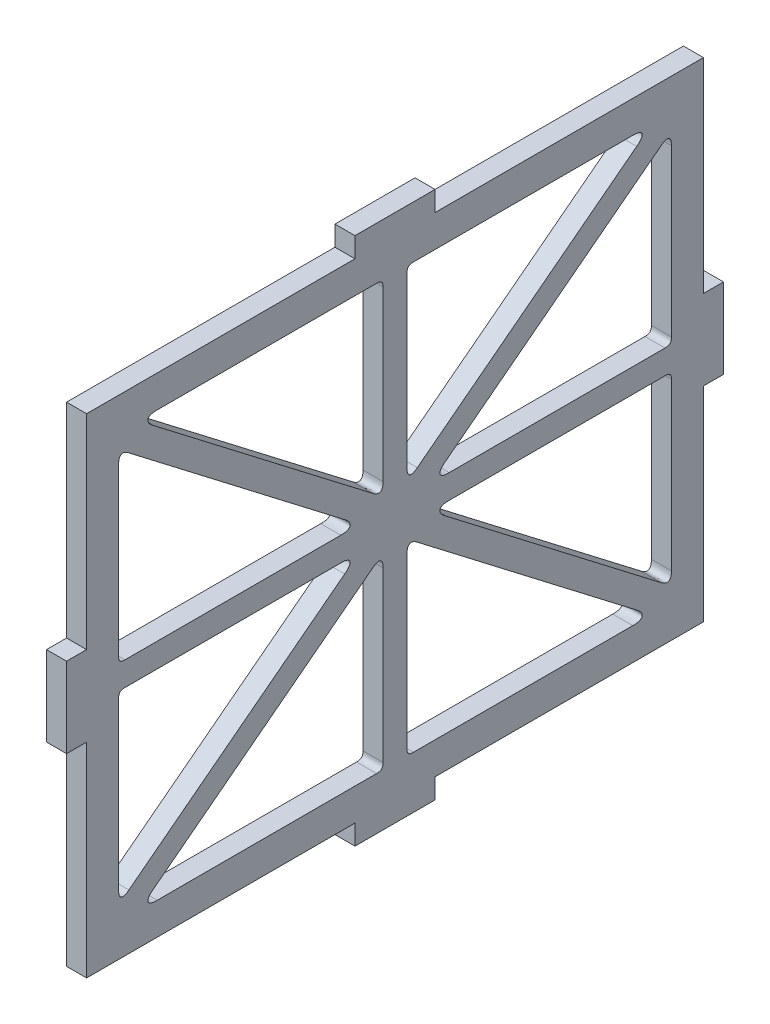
ISO-10303-21;
HEADER;
FILE_DESCRIPTION(('STEP AP214'),'2;1');
FILE_NAME('part.step','',(''),(''),'','','');
FILE_SCHEMA(('AUTOMOTIVE_DESIGN { 1 0 10303 214 1 1 1 1 }'));
ENDSEC;
DATA;
#1=APPLICATION_CONTEXT('core data for automotive mechanical design processes');
#2=APPLICATION_PROTOCOL_DEFINITION('international standard','automotive_design',2000,#1);
#3=PRODUCT_CONTEXT('',#1,'mechanical');
#4=PRODUCT('Part','Part','',(#3));
#5=PRODUCT_RELATED_PRODUCT_CATEGORY('part','',(#4));
#6=PRODUCT_DEFINITION_FORMATION('','',#4);
#7=PRODUCT_DEFINITION_CONTEXT('part definition',#1,'design');
#8=PRODUCT_DEFINITION('design','',#6,#7);
#9=PRODUCT_DEFINITION_SHAPE('','',#8);
#10=(LENGTH_UNIT() NAMED_UNIT(*) SI_UNIT(.MILLI.,.METRE.));
#11=(NAMED_UNIT(*) PLANE_ANGLE_UNIT() SI_UNIT($,.RADIAN.));
#12=(NAMED_UNIT(*) SI_UNIT($,.STERADIAN.) SOLID_ANGLE_UNIT());
#13=UNCERTAINTY_MEASURE_WITH_UNIT(LENGTH_MEASURE(1.E-05),#10,'distance_accuracy_value','');
#14=(GEOMETRIC_REPRESENTATION_CONTEXT(3) GLOBAL_UNCERTAINTY_ASSIGNED_CONTEXT((#13)) GLOBAL_UNIT_ASSIGNED_CONTEXT((#10,
#11,#12)) REPRESENTATION_CONTEXT('',''));
#15=CARTESIAN_POINT('',(0.,0.,0.));
#16=DIRECTION('',(0.,0.,1.));
#17=DIRECTION('',(1.,0.,0.));
#18=AXIS2_PLACEMENT_3D('',#15,#16,#17);
#19=CARTESIAN_POINT('',(2.5,-30.5,38.5));
#20=DIRECTION('',(0.,0.,-1.));
#21=DIRECTION('',(-1.,0.,0.));
#22=AXIS2_PLACEMENT_3D('',#19,#20,#21);
#23=PLANE('',#22);
#24=DIRECTION('',(1.,0.,0.));
#25=VECTOR('',#24,1.);
#26=CARTESIAN_POINT('',(-10.3077640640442,-5.,38.5));
#27=LINE('',#26,#25);
#28=CARTESIAN_POINT('',(0.,-5.,38.5));
#29=VERTEX_POINT('',#28);
#30=CARTESIAN_POINT('',(2.5,-5.,38.5));
#31=VERTEX_POINT('',#30);
#32=EDGE_CURVE('E483',#29,#31,#27,.T.);
#33=ORIENTED_EDGE('',*,*,#32,.F.);
#34=DIRECTION('',(0.,-1.,0.));
#35=VECTOR('',#34,1.);
#36=CARTESIAN_POINT('',(0.,-30.5,38.5));
#37=LINE('',#36,#35);
#38=CARTESIAN_POINT('',(0.,-30.5,38.5));
#39=VERTEX_POINT('',#38);
#40=EDGE_CURVE('E480',#29,#39,#37,.T.);
#41=ORIENTED_EDGE('',*,*,#40,.T.);
#42=DIRECTION('',(-1.,0.,0.));
#43=VECTOR('',#42,1.);
#44=CARTESIAN_POINT('',(2.5,-30.5,38.5));
#45=LINE('',#44,#43);
#46=CARTESIAN_POINT('',(2.5,-30.5,38.5));
#47=VERTEX_POINT('',#46);
#48=EDGE_CURVE('E623',#47,#39,#45,.T.);
#49=ORIENTED_EDGE('',*,*,#48,.F.);
#50=DIRECTION('',(0.,-1.,0.));
#51=VECTOR('',#50,1.);
#52=CARTESIAN_POINT('',(2.5,-30.5,38.5));
#53=LINE('',#52,#51);
#54=EDGE_CURVE('E598',#31,#47,#53,.T.);
#55=ORIENTED_EDGE('',*,*,#54,.F.);
#56=EDGE_LOOP('',(#33,#41,#49,#55));
#57=FACE_BOUND('',#56,.T.);
#58=ADVANCED_FACE('F39',(#57),#23,.F.);
#59=CARTESIAN_POINT('',(2.5,-30.5,38.5));
#60=DIRECTION('',(0.,1.,0.));
#61=DIRECTION('',(0.,0.,1.));
#62=AXIS2_PLACEMENT_3D('',#59,#60,#61);
#63=PLANE('',#62);
#64=DIRECTION('',(1.,0.,0.));
#65=VECTOR('',#64,1.);
#66=CARTESIAN_POINT('',(-10.3077640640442,-30.5,-5.));
#67=LINE('',#66,#65);
#68=CARTESIAN_POINT('',(0.,-30.5,-5.));
#69=VERTEX_POINT('',#68);
#70=CARTESIAN_POINT('',(2.5,-30.5,-5.));
#71=VERTEX_POINT('',#70);
#72=EDGE_CURVE('E526',#69,#71,#67,.T.);
#73=ORIENTED_EDGE('',*,*,#72,.F.);
#74=DIRECTION('',(0.,0.,-1.));
#75=VECTOR('',#74,1.);
#76=CARTESIAN_POINT('',(0.,-30.5,38.5));
#77=LINE('',#76,#75);
#78=CARTESIAN_POINT('',(0.,-30.5,-38.5));
#79=VERTEX_POINT('',#78);
#80=EDGE_CURVE('E617',#69,#79,#77,.T.);
#81=ORIENTED_EDGE('',*,*,#80,.T.);
#82=DIRECTION('',(-1.,0.,0.));
#83=VECTOR('',#82,1.);
#84=CARTESIAN_POINT('',(2.5,-30.5,-38.5));
#85=LINE('',#84,#83);
#86=CARTESIAN_POINT('',(2.5,-30.5,-38.5));
#87=VERTEX_POINT('',#86);
#88=EDGE_CURVE('E606',#87,#79,#85,.T.);
#89=ORIENTED_EDGE('',*,*,#88,.F.);
#90=DIRECTION('',(0.,0.,-1.));
#91=VECTOR('',#90,1.);
#92=CARTESIAN_POINT('',(2.5,-30.5,38.5));
#93=LINE('',#92,#91);
#94=EDGE_CURVE('E602',#71,#87,#93,.T.);
#95=ORIENTED_EDGE('',*,*,#94,.F.);
#96=EDGE_LOOP('',(#73,#81,#89,#95));
#97=FACE_BOUND('',#96,.T.);
#98=ADVANCED_FACE('F2735',(#97),#63,.F.);
#99=CARTESIAN_POINT('',(2.5,30.5,38.5));
#100=DIRECTION('',(0.,-1.,0.));
#101=DIRECTION('',(0.,0.,-1.));
#102=AXIS2_PLACEMENT_3D('',#99,#100,#101);
#103=PLANE('',#102);
#104=DIRECTION('',(1.,0.,0.));
#105=VECTOR('',#104,1.);
#106=CARTESIAN_POINT('',(-10.3077640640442,30.5,5.));
#107=LINE('',#106,#105);
#108=CARTESIAN_POINT('',(0.,30.5,5.));
#109=VERTEX_POINT('',#108);
#110=CARTESIAN_POINT('',(2.5,30.5,5.));
#111=VERTEX_POINT('',#110);
#112=EDGE_CURVE('E549',#109,#111,#107,.T.);
#113=ORIENTED_EDGE('',*,*,#112,.F.);
#114=DIRECTION('',(0.,0.,1.));
#115=VECTOR('',#114,1.);
#116=CARTESIAN_POINT('',(0.,30.5,38.5));
#117=LINE('',#116,#115);
#118=CARTESIAN_POINT('',(0.,30.5,38.5));
#119=VERTEX_POINT('',#118);
#120=EDGE_CURVE('E610',#109,#119,#117,.T.);
#121=ORIENTED_EDGE('',*,*,#120,.T.);
#122=DIRECTION('',(-1.,0.,0.));
#123=VECTOR('',#122,1.);
#124=CARTESIAN_POINT('',(2.5,30.5,38.5));
#125=LINE('',#124,#123);
#126=CARTESIAN_POINT('',(2.5,30.5,38.5));
#127=VERTEX_POINT('',#126);
#128=EDGE_CURVE('E626',#127,#119,#125,.T.);
#129=ORIENTED_EDGE('',*,*,#128,.F.);
#130=DIRECTION('',(0.,0.,1.));
#131=VECTOR('',#130,1.);
#132=CARTESIAN_POINT('',(2.5,30.5,38.5));
#133=LINE('',#132,#131);
#134=EDGE_CURVE('E593',#111,#127,#133,.T.);
#135=ORIENTED_EDGE('',*,*,#134,.F.);
#136=EDGE_LOOP('',(#113,#121,#129,#135));
#137=FACE_BOUND('',#136,.T.);
#138=ADVANCED_FACE('F2742',(#137),#103,.F.);
#139=CARTESIAN_POINT('',(2.5,-30.5,-38.5));
#140=DIRECTION('',(0.,0.,1.));
#141=DIRECTION('',(1.,0.,0.));
#142=AXIS2_PLACEMENT_3D('',#139,#140,#141);
#143=PLANE('',#142);
#144=DIRECTION('',(1.,0.,0.));
#145=VECTOR('',#144,1.);
#146=CARTESIAN_POINT('',(-10.3077640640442,5.,-38.5));
#147=LINE('',#146,#145);
#148=CARTESIAN_POINT('',(0.,5.,-38.5));
#149=VERTEX_POINT('',#148);
#150=CARTESIAN_POINT('',(2.5,5.,-38.5));
#151=VERTEX_POINT('',#150);
#152=EDGE_CURVE('E578',#149,#151,#147,.T.);
#153=ORIENTED_EDGE('',*,*,#152,.F.);
#154=DIRECTION('',(0.,1.,0.));
#155=VECTOR('',#154,1.);
#156=CARTESIAN_POINT('',(0.,-30.5,-38.5));
#157=LINE('',#156,#155);
#158=CARTESIAN_POINT('',(0.,30.5,-38.5));
#159=VERTEX_POINT('',#158);
#160=EDGE_CURVE('E589',#149,#159,#157,.T.);
#161=ORIENTED_EDGE('',*,*,#160,.T.);
#162=DIRECTION('',(-1.,0.,0.));
#163=VECTOR('',#162,1.);
#164=CARTESIAN_POINT('',(2.5,30.5,-38.5));
#165=LINE('',#164,#163);
#166=CARTESIAN_POINT('',(2.5,30.5,-38.5));
#167=VERTEX_POINT('',#166);
#168=EDGE_CURVE('E629',#167,#159,#165,.T.);
#169=ORIENTED_EDGE('',*,*,#168,.F.);
#170=DIRECTION('',(0.,1.,0.));
#171=VECTOR('',#170,1.);
#172=CARTESIAN_POINT('',(2.5,-30.5,-38.5));
#173=LINE('',#172,#171);
#174=EDGE_CURVE('E594',#151,#167,#173,.T.);
#175=ORIENTED_EDGE('',*,*,#174,.F.);
#176=EDGE_LOOP('',(#153,#161,#169,#175));
#177=FACE_BOUND('',#176,.T.);
#178=ADVANCED_FACE('F2968',(#177),#143,.F.);
#179=CARTESIAN_POINT('',(0.,-5.,-38.5));
#180=VERTEX_POINT('',#179);
#181=EDGE_CURVE('E607',#79,#180,#157,.T.);
#182=ORIENTED_EDGE('',*,*,#181,.T.);
#183=DIRECTION('',(1.,0.,0.));
#184=VECTOR('',#183,1.);
#185=CARTESIAN_POINT('',(-10.3077640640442,-5.,-38.5));
#186=LINE('',#185,#184);
#187=CARTESIAN_POINT('',(2.5,-5.00000000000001,-38.5));
#188=VERTEX_POINT('',#187);
#189=EDGE_CURVE('E584',#180,#188,#186,.T.);
#190=ORIENTED_EDGE('',*,*,#189,.T.);
#191=EDGE_CURVE('E590',#87,#188,#173,.T.);
#192=ORIENTED_EDGE('',*,*,#191,.F.);
#193=ORIENTED_EDGE('',*,*,#88,.T.);
#194=EDGE_LOOP('',(#182,#190,#192,#193));
#195=FACE_BOUND('',#194,.T.);
#196=ADVANCED_FACE('F1603',(#195),#143,.F.);
#197=CARTESIAN_POINT('',(0.,30.5,-5.));
#198=VERTEX_POINT('',#197);
#199=EDGE_CURVE('E611',#159,#198,#117,.T.);
#200=ORIENTED_EDGE('',*,*,#199,.T.);
#201=DIRECTION('',(1.,0.,0.));
#202=VECTOR('',#201,1.);
#203=CARTESIAN_POINT('',(-10.3077640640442,30.5,-5.));
#204=LINE('',#203,#202);
#205=CARTESIAN_POINT('',(2.5,30.5,-5.));
#206=VERTEX_POINT('',#205);
#207=EDGE_CURVE('E541',#198,#206,#204,.T.);
#208=ORIENTED_EDGE('',*,*,#207,.T.);
#209=EDGE_CURVE('E595',#167,#206,#133,.T.);
#210=ORIENTED_EDGE('',*,*,#209,.F.);
#211=ORIENTED_EDGE('',*,*,#168,.T.);
#212=EDGE_LOOP('',(#200,#208,#210,#211));
#213=FACE_BOUND('',#212,.T.);
#214=ADVANCED_FACE('F2745',(#213),#103,.F.);
#215=CARTESIAN_POINT('',(0.,5.,38.5));
#216=VERTEX_POINT('',#215);
#217=EDGE_CURVE('E614',#119,#216,#37,.T.);
#218=ORIENTED_EDGE('',*,*,#217,.T.);
#219=DIRECTION('',(1.,0.,0.));
#220=VECTOR('',#219,1.);
#221=CARTESIAN_POINT('',(-10.3077640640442,5.,38.5));
#222=LINE('',#221,#220);
#223=CARTESIAN_POINT('',(2.5,4.99999999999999,38.5));
#224=VERTEX_POINT('',#223);
#225=EDGE_CURVE('E505',#216,#224,#222,.T.);
#226=ORIENTED_EDGE('',*,*,#225,.T.);
#227=EDGE_CURVE('E599',#127,#224,#53,.T.);
#228=ORIENTED_EDGE('',*,*,#227,.F.);
#229=ORIENTED_EDGE('',*,*,#128,.T.);
#230=EDGE_LOOP('',(#218,#226,#228,#229));
#231=FACE_BOUND('',#230,.T.);
#232=ADVANCED_FACE('F2738',(#231),#23,.F.);
#233=CARTESIAN_POINT('',(0.,-30.5,5.));
#234=VERTEX_POINT('',#233);
#235=EDGE_CURVE('E618',#39,#234,#77,.T.);
#236=ORIENTED_EDGE('',*,*,#235,.T.);
#237=DIRECTION('',(1.,0.,0.));
#238=VECTOR('',#237,1.);
#239=CARTESIAN_POINT('',(-10.3077640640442,-30.5,5.));
#240=LINE('',#239,#238);
#241=CARTESIAN_POINT('',(2.5,-30.5,5.));
#242=VERTEX_POINT('',#241);
#243=EDGE_CURVE('E532',#234,#242,#240,.T.);
#244=ORIENTED_EDGE('',*,*,#243,.T.);
#245=EDGE_CURVE('E603',#47,#242,#93,.T.);
#246=ORIENTED_EDGE('',*,*,#245,.F.);
#247=ORIENTED_EDGE('',*,*,#48,.T.);
#248=EDGE_LOOP('',(#236,#244,#246,#247));
#249=FACE_BOUND('',#248,.T.);
#250=ADVANCED_FACE('F1181',(#249),#63,.F.);
#251=CARTESIAN_POINT('',(2.5,0.,0.));
#252=DIRECTION('',(-1.,0.,0.));
#253=DIRECTION('',(0.,0.,1.));
#254=AXIS2_PLACEMENT_3D('',#251,#252,#253);
#255=PLANE('',#254);
#256=DIRECTION('',(0.,0.,-1.));
#257=VECTOR('',#256,1.);
#258=CARTESIAN_POINT('',(2.5,-26.5,32.0375731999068));
#259=LINE('',#258,#257);
#260=CARTESIAN_POINT('',(2.5,-26.5,29.6827694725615));
#261=VERTEX_POINT('',#260);
#262=CARTESIAN_POINT('',(2.5,-26.5,2.29999999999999));
#263=VERTEX_POINT('',#262);
#264=EDGE_CURVE('E1009',#261,#263,#259,.T.);
#265=ORIENTED_EDGE('',*,*,#264,.F.);
#266=CARTESIAN_POINT('',(2.5,-25.0655591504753,30.1700936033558));
#267=CARTESIAN_POINT('',(2.5,-25.2516942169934,30.412420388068));
#268=CARTESIAN_POINT('',(2.5,-25.4378292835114,30.6547471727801));
#269=CARTESIAN_POINT('',(2.5,-25.957339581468,31.0214758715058));
#270=CARTESIAN_POINT('',(2.5,-26.3113964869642,30.9011917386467));
#271=CARTESIAN_POINT('',(2.5,-26.5,30.293894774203));
#272=CARTESIAN_POINT('',(2.5,-26.5,29.9883321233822));
#273=CARTESIAN_POINT('',(2.5,-26.5,29.6827694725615));
#274=B_SPLINE_CURVE_WITH_KNOTS('',5,(#266,#267,#268,#269,#270,#271,#272,#273),.UNSPECIFIED.,.F.,
.F.,(6,2,6),(0.,0.5,1.),.UNSPECIFIED.);
#275=CARTESIAN_POINT('',(2.5,-25.0655591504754,30.1700936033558));
#276=VERTEX_POINT('',#275);
#277=EDGE_CURVE('E1467',#261,#276,#274,.F.);
#278=ORIENTED_EDGE('',*,*,#277,.T.);
#279=DIRECTION('',(0.,-0.609155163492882,0.793051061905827));
#280=VECTOR('',#279,1.);
#281=CARTESIAN_POINT('',(2.5,-3.04360319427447,1.5));
#282=LINE('',#281,#280);
#283=CARTESIAN_POINT('',(2.5,-4.03241738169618,2.7873241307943));
#284=VERTEX_POINT('',#283);
#285=EDGE_CURVE('E992',#284,#276,#282,.T.);
#286=ORIENTED_EDGE('',*,*,#285,.F.);
#287=CARTESIAN_POINT('',(2.5,-4.66685823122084,1.49999999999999));
#288=CARTESIAN_POINT('',(2.5,-4.43315193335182,1.49999999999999));
#289=CARTESIAN_POINT('',(2.5,-4.1994456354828,1.49999999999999));
#290=CARTESIAN_POINT('',(2.5,-3.71457644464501,1.64079977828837));
#291=CARTESIAN_POINT('',(2.5,-3.56399142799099,1.94634713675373));
#292=CARTESIAN_POINT('',(2.5,-3.74769058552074,2.41664207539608));
#293=CARTESIAN_POINT('',(2.5,-3.89005398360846,2.60198310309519));
#294=CARTESIAN_POINT('',(2.5,-4.03241738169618,2.7873241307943));
#295=B_SPLINE_CURVE_WITH_KNOTS('',5,(#287,#288,#289,#290,#291,#292,#293,#294),.UNSPECIFIED.,.F.,
.F.,(6,2,6),(0.,0.5,1.),.UNSPECIFIED.);
#296=CARTESIAN_POINT('',(2.5,-4.66685823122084,1.49999999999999));
#297=VERTEX_POINT('',#296);
#298=EDGE_CURVE('E1475',#284,#297,#295,.F.);
#299=ORIENTED_EDGE('',*,*,#298,.T.);
#300=DIRECTION('',(0.,1.,0.));
#301=VECTOR('',#300,1.);
#302=CARTESIAN_POINT('',(2.5,-26.5,1.49999999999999));
#303=LINE('',#302,#301);
#304=CARTESIAN_POINT('',(2.5,-25.7,1.49999999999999));
#305=VERTEX_POINT('',#304);
#306=EDGE_CURVE('E983',#305,#297,#303,.T.);
#307=ORIENTED_EDGE('',*,*,#306,.F.);
#308=CARTESIAN_POINT('',(2.5,-26.5,2.29999999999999));
#309=CARTESIAN_POINT('',(2.5,-26.5,2.16544155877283));
#310=CARTESIAN_POINT('',(2.5,-26.5,2.03088311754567));
#311=CARTESIAN_POINT('',(2.5,-26.4426464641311,1.73431457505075));
#312=CARTESIAN_POINT('',(2.5,-26.2656854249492,1.55735353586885));
#313=CARTESIAN_POINT('',(2.5,-25.9691168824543,1.49999999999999));
#314=CARTESIAN_POINT('',(2.5,-25.8345584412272,1.49999999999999));
#315=CARTESIAN_POINT('',(2.5,-25.7,1.49999999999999));
#316=B_SPLINE_CURVE_WITH_KNOTS('',5,(#308,#309,#310,#311,#312,#313,#314,#315),.UNSPECIFIED.,.F.,
.F.,(6,2,6),(0.,0.5,1.),.UNSPECIFIED.);
#317=EDGE_CURVE('E1480',#305,#263,#316,.F.);
#318=ORIENTED_EDGE('',*,*,#317,.T.);
#319=EDGE_LOOP('',(#265,#278,#286,#299,#307,#318));
#320=FACE_BOUND('',#319,.T.);
#321=DIRECTION('',(0.,0.,-1.));
#322=VECTOR('',#321,1.);
#323=CARTESIAN_POINT('',(2.5,-26.5,-32.0375731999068));
#324=LINE('',#323,#322);
#325=CARTESIAN_POINT('',(2.5,-26.5,-2.3));
#326=VERTEX_POINT('',#325);
#327=CARTESIAN_POINT('',(2.5,-26.5,-29.6827694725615));
#328=VERTEX_POINT('',#327);
#329=EDGE_CURVE('E951',#326,#328,#324,.T.);
#330=ORIENTED_EDGE('',*,*,#329,.F.);
#331=CARTESIAN_POINT('',(2.5,-25.7,-1.5));
#332=CARTESIAN_POINT('',(2.5,-25.8345584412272,-1.5));
#333=CARTESIAN_POINT('',(2.5,-25.9691168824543,-1.5));
#334=CARTESIAN_POINT('',(2.5,-26.2656854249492,-1.55735353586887));
#335=CARTESIAN_POINT('',(2.5,-26.4426464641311,-1.73431457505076));
#336=CARTESIAN_POINT('',(2.5,-26.5,-2.03088311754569));
#337=CARTESIAN_POINT('',(2.5,-26.5,-2.16544155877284));
#338=CARTESIAN_POINT('',(2.5,-26.5,-2.3));
#339=B_SPLINE_CURVE_WITH_KNOTS('',5,(#331,#332,#333,#334,#335,#336,#337,#338),.UNSPECIFIED.,.F.,
.F.,(6,2,6),(0.,0.5,1.),.UNSPECIFIED.);
#340=CARTESIAN_POINT('',(2.5,-25.7,-1.5));
#341=VERTEX_POINT('',#340);
#342=EDGE_CURVE('E1485',#326,#341,#339,.F.);
#343=ORIENTED_EDGE('',*,*,#342,.T.);
#344=DIRECTION('',(0.,-1.,0.));
#345=VECTOR('',#344,1.);
#346=CARTESIAN_POINT('',(2.5,-26.5,-1.5));
#347=LINE('',#346,#345);
#348=CARTESIAN_POINT('',(2.5,-4.66685823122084,-1.5));
#349=VERTEX_POINT('',#348);
#350=EDGE_CURVE('E933',#349,#341,#347,.T.);
#351=ORIENTED_EDGE('',*,*,#350,.F.);
#352=CARTESIAN_POINT('',(2.5,-4.03241738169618,-2.78732413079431));
#353=CARTESIAN_POINT('',(2.5,-3.89005398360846,-2.6019831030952));
#354=CARTESIAN_POINT('',(2.5,-3.74769058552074,-2.41664207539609));
#355=CARTESIAN_POINT('',(2.5,-3.56399142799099,-1.94634713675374));
#356=CARTESIAN_POINT('',(2.5,-3.714576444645,-1.64079977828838));
#357=CARTESIAN_POINT('',(2.5,-4.1994456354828,-1.5));
#358=CARTESIAN_POINT('',(2.5,-4.43315193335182,-1.5));
#359=CARTESIAN_POINT('',(2.5,-4.66685823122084,-1.5));
#360=B_SPLINE_CURVE_WITH_KNOTS('',5,(#352,#353,#354,#355,#356,#357,#358,#359),.UNSPECIFIED.,.F.,
.F.,(6,2,6),(0.,0.5,1.),.UNSPECIFIED.);
#361=CARTESIAN_POINT('',(2.5,-4.03241738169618,-2.78732413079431));
#362=VERTEX_POINT('',#361);
#363=EDGE_CURVE('E1494',#349,#362,#360,.F.);
#364=ORIENTED_EDGE('',*,*,#363,.T.);
#365=DIRECTION('',(0.,0.609155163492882,0.793051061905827));
#366=VECTOR('',#365,1.);
#367=CARTESIAN_POINT('',(2.5,-3.04360319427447,-1.5));
#368=LINE('',#367,#366);
#369=CARTESIAN_POINT('',(2.5,-25.0655591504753,-30.1700936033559));
#370=VERTEX_POINT('',#369);
#371=EDGE_CURVE('E924',#370,#362,#368,.T.);
#372=ORIENTED_EDGE('',*,*,#371,.F.);
#373=CARTESIAN_POINT('',(2.5,-26.5,-29.6827694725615));
#374=CARTESIAN_POINT('',(2.5,-26.5,-29.9883321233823));
#375=CARTESIAN_POINT('',(2.5,-26.5,-30.293894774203));
#376=CARTESIAN_POINT('',(2.5,-26.3113964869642,-30.9011917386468));
#377=CARTESIAN_POINT('',(2.5,-25.957339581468,-31.0214758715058));
#378=CARTESIAN_POINT('',(2.5,-25.4378292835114,-30.6547471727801));
#379=CARTESIAN_POINT('',(2.5,-25.2516942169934,-30.412420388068));
#380=CARTESIAN_POINT('',(2.5,-25.0655591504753,-30.1700936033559));
#381=B_SPLINE_CURVE_WITH_KNOTS('',5,(#373,#374,#375,#376,#377,#378,#379,#380),.UNSPECIFIED.,.F.,
.F.,(6,2,6),(0.,0.5,1.),.UNSPECIFIED.);
#382=EDGE_CURVE('E1499',#370,#328,#381,.F.);
#383=ORIENTED_EDGE('',*,*,#382,.T.);
#384=EDGE_LOOP('',(#330,#343,#351,#364,#372,#383));
#385=FACE_BOUND('',#384,.T.);
#386=DIRECTION('',(0.,0.,1.));
#387=VECTOR('',#386,1.);
#388=CARTESIAN_POINT('',(2.5,26.5,-32.0375731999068));
#389=LINE('',#388,#387);
#390=CARTESIAN_POINT('',(2.5,26.5,-29.6827694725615));
#391=VERTEX_POINT('',#390);
#392=CARTESIAN_POINT('',(2.5,26.5,-2.3));
#393=VERTEX_POINT('',#392);
#394=EDGE_CURVE('E718',#391,#393,#389,.T.);
#395=ORIENTED_EDGE('',*,*,#394,.F.);
#396=CARTESIAN_POINT('',(2.5,25.0655591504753,-30.1700936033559));
#397=CARTESIAN_POINT('',(2.5,25.2516942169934,-30.412420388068));
#398=CARTESIAN_POINT('',(2.5,25.4378292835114,-30.6547471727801));
#399=CARTESIAN_POINT('',(2.5,25.957339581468,-31.0214758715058));
#400=CARTESIAN_POINT('',(2.5,26.3113964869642,-30.9011917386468));
#401=CARTESIAN_POINT('',(2.5,26.5,-30.293894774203));
#402=CARTESIAN_POINT('',(2.5,26.5,-29.9883321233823));
#403=CARTESIAN_POINT('',(2.5,26.5,-29.6827694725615));
#404=B_SPLINE_CURVE_WITH_KNOTS('',5,(#396,#397,#398,#399,#400,#401,#402,#403),.UNSPECIFIED.,.F.,
.F.,(6,2,6),(0.,0.5,1.),.UNSPECIFIED.);
#405=CARTESIAN_POINT('',(2.5,25.0655591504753,-30.1700936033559));
#406=VERTEX_POINT('',#405);
#407=EDGE_CURVE('E1542',#391,#406,#404,.F.);
#408=ORIENTED_EDGE('',*,*,#407,.T.);
#409=DIRECTION('',(0.,0.609155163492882,-0.793051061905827));
#410=VECTOR('',#409,1.);
#411=CARTESIAN_POINT('',(2.5,3.04360319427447,-1.5));
#412=LINE('',#411,#410);
#413=CARTESIAN_POINT('',(2.5,4.03241738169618,-2.78732413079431));
#414=VERTEX_POINT('',#413);
#415=EDGE_CURVE('E700',#414,#406,#412,.T.);
#416=ORIENTED_EDGE('',*,*,#415,.F.);
#417=CARTESIAN_POINT('',(2.5,4.66685823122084,-1.5));
#418=CARTESIAN_POINT('',(2.5,4.43315193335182,-1.5));
#419=CARTESIAN_POINT('',(2.5,4.1994456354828,-1.5));
#420=CARTESIAN_POINT('',(2.5,3.714576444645,-1.64079977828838));
#421=CARTESIAN_POINT('',(2.5,3.56399142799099,-1.94634713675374));
#422=CARTESIAN_POINT('',(2.5,3.74769058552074,-2.41664207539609));
#423=CARTESIAN_POINT('',(2.5,3.89005398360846,-2.6019831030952));
#424=CARTESIAN_POINT('',(2.5,4.03241738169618,-2.78732413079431));
#425=B_SPLINE_CURVE_WITH_KNOTS('',5,(#417,#418,#419,#420,#421,#422,#423,#424),.UNSPECIFIED.,.F.,
.F.,(6,2,6),(0.,0.5,1.),.UNSPECIFIED.);
#426=CARTESIAN_POINT('',(2.5,4.66685823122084,-1.5));
#427=VERTEX_POINT('',#426);
#428=EDGE_CURVE('E1531',#414,#427,#425,.F.);
#429=ORIENTED_EDGE('',*,*,#428,.T.);
#430=DIRECTION('',(0.,-1.,0.));
#431=VECTOR('',#430,1.);
#432=CARTESIAN_POINT('',(2.5,26.5,-1.5));
#433=LINE('',#432,#431);
#434=CARTESIAN_POINT('',(2.5,25.7,-1.5));
#435=VERTEX_POINT('',#434);
#436=EDGE_CURVE('E691',#435,#427,#433,.T.);
#437=ORIENTED_EDGE('',*,*,#436,.F.);
#438=CARTESIAN_POINT('',(2.5,26.5,-2.3));
#439=CARTESIAN_POINT('',(2.5,26.5,-2.16544155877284));
#440=CARTESIAN_POINT('',(2.5,26.5,-2.03088311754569));
#441=CARTESIAN_POINT('',(2.5,26.4426464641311,-1.73431457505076));
#442=CARTESIAN_POINT('',(2.5,26.2656854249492,-1.55735353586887));
#443=CARTESIAN_POINT('',(2.5,25.9691168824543,-1.5));
#444=CARTESIAN_POINT('',(2.5,25.8345584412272,-1.5));
#445=CARTESIAN_POINT('',(2.5,25.7,-1.5));
#446=B_SPLINE_CURVE_WITH_KNOTS('',5,(#438,#439,#440,#441,#442,#443,#444,#445),.UNSPECIFIED.,.F.,
.F.,(6,2,6),(0.,0.5,1.),.UNSPECIFIED.);
#447=EDGE_CURVE('E1548',#435,#393,#446,.F.);
#448=ORIENTED_EDGE('',*,*,#447,.T.);
#449=EDGE_LOOP('',(#395,#408,#416,#429,#437,#448));
#450=FACE_BOUND('',#449,.T.);
#451=DIRECTION('',(0.,0.,1.));
#452=VECTOR('',#451,1.);
#453=CARTESIAN_POINT('',(2.5,26.5,32.0375731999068));
#454=LINE('',#453,#452);
#455=CARTESIAN_POINT('',(2.5,26.5,2.3));
#456=VERTEX_POINT('',#455);
#457=CARTESIAN_POINT('',(2.5,26.5,29.6827694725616));
#458=VERTEX_POINT('',#457);
#459=EDGE_CURVE('E656',#456,#458,#454,.T.);
#460=ORIENTED_EDGE('',*,*,#459,.F.);
#461=CARTESIAN_POINT('',(2.5,25.7,1.5));
#462=CARTESIAN_POINT('',(2.5,25.8345584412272,1.5));
#463=CARTESIAN_POINT('',(2.5,25.9691168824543,1.5));
#464=CARTESIAN_POINT('',(2.5,26.2656854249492,1.55735353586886));
#465=CARTESIAN_POINT('',(2.5,26.4426464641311,1.73431457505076));
#466=CARTESIAN_POINT('',(2.5,26.5,2.03088311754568));
#467=CARTESIAN_POINT('',(2.5,26.5,2.16544155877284));
#468=CARTESIAN_POINT('',(2.5,26.5,2.3));
#469=B_SPLINE_CURVE_WITH_KNOTS('',5,(#461,#462,#463,#464,#465,#466,#467,#468),.UNSPECIFIED.,.F.,
.F.,(6,2,6),(0.,0.5,1.),.UNSPECIFIED.);
#470=CARTESIAN_POINT('',(2.5,25.7,1.5));
#471=VERTEX_POINT('',#470);
#472=EDGE_CURVE('E1553',#456,#471,#469,.F.);
#473=ORIENTED_EDGE('',*,*,#472,.T.);
#474=DIRECTION('',(0.,1.,0.));
#475=VECTOR('',#474,1.);
#476=CARTESIAN_POINT('',(2.5,26.5,1.5));
#477=LINE('',#476,#475);
#478=CARTESIAN_POINT('',(2.5,4.66685823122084,1.5));
#479=VERTEX_POINT('',#478);
#480=EDGE_CURVE('E637',#479,#471,#477,.T.);
#481=ORIENTED_EDGE('',*,*,#480,.F.);
#482=CARTESIAN_POINT('',(2.5,4.03241738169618,2.7873241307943));
#483=CARTESIAN_POINT('',(2.5,3.89005398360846,2.60198310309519));
#484=CARTESIAN_POINT('',(2.5,3.74769058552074,2.41664207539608));
#485=CARTESIAN_POINT('',(2.5,3.56399142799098,1.94634713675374));
#486=CARTESIAN_POINT('',(2.5,3.714576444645,1.64079977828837));
#487=CARTESIAN_POINT('',(2.5,4.19944563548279,1.5));
#488=CARTESIAN_POINT('',(2.5,4.43315193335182,1.5));
#489=CARTESIAN_POINT('',(2.5,4.66685823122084,1.5));
#490=B_SPLINE_CURVE_WITH_KNOTS('',5,(#482,#483,#484,#485,#486,#487,#488,#489),.UNSPECIFIED.,.F.,
.F.,(6,2,6),(0.,0.5,1.),.UNSPECIFIED.);
#491=CARTESIAN_POINT('',(2.5,4.03241738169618,2.7873241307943));
#492=VERTEX_POINT('',#491);
#493=EDGE_CURVE('E1560',#479,#492,#490,.F.);
#494=ORIENTED_EDGE('',*,*,#493,.T.);
#495=DIRECTION('',(0.,-0.609155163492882,-0.793051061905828));
#496=VECTOR('',#495,1.);
#497=CARTESIAN_POINT('',(2.5,3.04360319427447,1.5));
#498=LINE('',#497,#496);
#499=CARTESIAN_POINT('',(2.5,25.0655591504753,30.1700936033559));
#500=VERTEX_POINT('',#499);
#501=EDGE_CURVE('E633',#500,#492,#498,.T.);
#502=ORIENTED_EDGE('',*,*,#501,.F.);
#503=CARTESIAN_POINT('',(2.5,26.5,29.6827694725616));
#504=CARTESIAN_POINT('',(2.5,26.5,29.9883321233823));
#505=CARTESIAN_POINT('',(2.5,26.5,30.293894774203));
#506=CARTESIAN_POINT('',(2.5,26.3113964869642,30.9011917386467));
#507=CARTESIAN_POINT('',(2.5,25.957339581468,31.0214758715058));
#508=CARTESIAN_POINT('',(2.5,25.4378292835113,30.6547471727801));
#509=CARTESIAN_POINT('',(2.5,25.2516942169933,30.412420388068));
#510=CARTESIAN_POINT('',(2.5,25.0655591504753,30.1700936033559));
#511=B_SPLINE_CURVE_WITH_KNOTS('',5,(#503,#504,#505,#506,#507,#508,#509,#510),.UNSPECIFIED.,.F.,
.F.,(6,2,6),(0.,0.5,1.),.UNSPECIFIED.);
#512=EDGE_CURVE('E1164',#500,#458,#511,.F.);
#513=ORIENTED_EDGE('',*,*,#512,.T.);
#514=EDGE_LOOP('',(#460,#473,#481,#494,#502,#513));
#515=FACE_BOUND('',#514,.T.);
#516=DIRECTION('',(0.,-0.609155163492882,0.793051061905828));
#517=VECTOR('',#516,1.);
#518=CARTESIAN_POINT('',(2.5,1.49999999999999,-4.41525698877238));
#519=LINE('',#518,#517);
#520=CARTESIAN_POINT('',(2.5,23.6197565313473,-33.2126758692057));
#521=VERTEX_POINT('',#520);
#522=CARTESIAN_POINT('',(2.5,2.93444084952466,-6.28273658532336));
#523=VERTEX_POINT('',#522);
#524=EDGE_CURVE('E752',#521,#523,#519,.T.);
#525=ORIENTED_EDGE('',*,*,#524,.F.);
#526=CARTESIAN_POINT('',(2.5,22.9853156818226,-34.5));
#527=CARTESIAN_POINT('',(2.5,23.2190219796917,-34.5));
#528=CARTESIAN_POINT('',(2.5,23.4527282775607,-34.5));
#529=CARTESIAN_POINT('',(2.5,23.9375974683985,-34.3592002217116));
#530=CARTESIAN_POINT('',(2.5,24.0881824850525,-34.0536528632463));
#531=CARTESIAN_POINT('',(2.5,23.9044833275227,-33.5833579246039));
#532=CARTESIAN_POINT('',(2.5,23.762119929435,-33.3980168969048));
#533=CARTESIAN_POINT('',(2.5,23.6197565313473,-33.2126758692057));
#534=B_SPLINE_CURVE_WITH_KNOTS('',5,(#526,#527,#528,#529,#530,#531,#532,#533),.UNSPECIFIED.,.F.,
.F.,(6,2,6),(0.,0.5,1.),.UNSPECIFIED.);
#535=CARTESIAN_POINT('',(2.5,22.9853156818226,-34.5));
#536=VERTEX_POINT('',#535);
#537=EDGE_CURVE('E1538',#521,#536,#534,.F.);
#538=ORIENTED_EDGE('',*,*,#537,.T.);
#539=DIRECTION('',(0.,1.,0.));
#540=VECTOR('',#539,1.);
#541=CARTESIAN_POINT('',(2.5,24.608570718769,-34.5));
#542=LINE('',#541,#540);
#543=CARTESIAN_POINT('',(2.5,2.29999999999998,-34.5));
#544=VERTEX_POINT('',#543);
#545=EDGE_CURVE('E762',#544,#536,#542,.T.);
#546=ORIENTED_EDGE('',*,*,#545,.F.);
#547=CARTESIAN_POINT('',(2.5,1.49999999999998,-33.7));
#548=CARTESIAN_POINT('',(2.5,1.49999999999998,-33.8345584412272));
#549=CARTESIAN_POINT('',(2.5,1.49999999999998,-33.9691168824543));
#550=CARTESIAN_POINT('',(2.5,1.55735353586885,-34.2656854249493));
#551=CARTESIAN_POINT('',(2.5,1.73431457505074,-34.4426464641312));
#552=CARTESIAN_POINT('',(2.5,2.03088311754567,-34.5));
#553=CARTESIAN_POINT('',(2.5,2.16544155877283,-34.5));
#554=CARTESIAN_POINT('',(2.5,2.29999999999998,-34.5));
#555=B_SPLINE_CURVE_WITH_KNOTS('',5,(#547,#548,#549,#550,#551,#552,#553,#554),.UNSPECIFIED.,.F.,
.F.,(6,2,6),(0.,0.5,1.),.UNSPECIFIED.);
#556=CARTESIAN_POINT('',(2.5,1.49999999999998,-33.7));
#557=VERTEX_POINT('',#556);
#558=EDGE_CURVE('E1518',#544,#557,#555,.F.);
#559=ORIENTED_EDGE('',*,*,#558,.T.);
#560=DIRECTION('',(0.,0.,-1.));
#561=VECTOR('',#560,1.);
#562=CARTESIAN_POINT('',(2.5,1.49999999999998,-34.5));
#563=LINE('',#562,#561);
#564=CARTESIAN_POINT('',(2.5,1.49999999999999,-6.77006071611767));
#565=VERTEX_POINT('',#564);
#566=EDGE_CURVE('E779',#565,#557,#563,.T.);
#567=ORIENTED_EDGE('',*,*,#566,.F.);
#568=CARTESIAN_POINT('',(2.5,2.93444084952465,-6.28273658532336));
#569=CARTESIAN_POINT('',(2.5,2.74830578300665,-6.04040980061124));
#570=CARTESIAN_POINT('',(2.5,2.56217071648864,-5.79808301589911));
#571=CARTESIAN_POINT('',(2.5,2.04266041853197,-5.43135431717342));
#572=CARTESIAN_POINT('',(2.5,1.68860351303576,-5.55163845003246));
#573=CARTESIAN_POINT('',(2.5,1.49999999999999,-6.15893541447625));
#574=CARTESIAN_POINT('',(2.5,1.49999999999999,-6.46449806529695));
#575=CARTESIAN_POINT('',(2.5,1.49999999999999,-6.77006071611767));
#576=B_SPLINE_CURVE_WITH_KNOTS('',5,(#568,#569,#570,#571,#572,#573,#574,#575),.UNSPECIFIED.,.F.,
.F.,(6,2,6),(0.,0.5,1.),.UNSPECIFIED.);
#577=EDGE_CURVE('E1526',#565,#523,#576,.F.);
#578=ORIENTED_EDGE('',*,*,#577,.T.);
#579=EDGE_LOOP('',(#525,#538,#546,#559,#567,#578));
#580=FACE_BOUND('',#579,.T.);
#581=DIRECTION('',(0.,0.,1.));
#582=VECTOR('',#581,1.);
#583=CARTESIAN_POINT('',(2.5,-1.49999999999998,-34.5));
#584=LINE('',#583,#582);
#585=CARTESIAN_POINT('',(2.5,-1.49999999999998,-33.7));
#586=VERTEX_POINT('',#585);
#587=CARTESIAN_POINT('',(2.5,-1.49999999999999,-6.77006071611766));
#588=VERTEX_POINT('',#587);
#589=EDGE_CURVE('E839',#586,#588,#584,.T.);
#590=ORIENTED_EDGE('',*,*,#589,.F.);
#591=CARTESIAN_POINT('',(2.5,-2.29999999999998,-34.5));
#592=CARTESIAN_POINT('',(2.5,-2.16544155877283,-34.5));
#593=CARTESIAN_POINT('',(2.5,-2.03088311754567,-34.5));
#594=CARTESIAN_POINT('',(2.5,-1.73431457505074,-34.4426464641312));
#595=CARTESIAN_POINT('',(2.5,-1.55735353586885,-34.2656854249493));
#596=CARTESIAN_POINT('',(2.5,-1.49999999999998,-33.9691168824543));
#597=CARTESIAN_POINT('',(2.5,-1.49999999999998,-33.8345584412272));
#598=CARTESIAN_POINT('',(2.5,-1.49999999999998,-33.7));
#599=B_SPLINE_CURVE_WITH_KNOTS('',5,(#591,#592,#593,#594,#595,#596,#597,#598),.UNSPECIFIED.,.F.,
.F.,(6,2,6),(0.,0.5,1.),.UNSPECIFIED.);
#600=CARTESIAN_POINT('',(2.5,-2.29999999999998,-34.5));
#601=VERTEX_POINT('',#600);
#602=EDGE_CURVE('E1509',#586,#601,#599,.F.);
#603=ORIENTED_EDGE('',*,*,#602,.T.);
#604=DIRECTION('',(0.,1.,0.));
#605=VECTOR('',#604,1.);
#606=CARTESIAN_POINT('',(2.5,-24.608570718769,-34.5));
#607=LINE('',#606,#605);
#608=CARTESIAN_POINT('',(2.5,-22.9853156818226,-34.5));
#609=VERTEX_POINT('',#608);
#610=EDGE_CURVE('E830',#609,#601,#607,.T.);
#611=ORIENTED_EDGE('',*,*,#610,.F.);
#612=CARTESIAN_POINT('',(2.5,-23.6197565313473,-33.2126758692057));
#613=CARTESIAN_POINT('',(2.5,-23.762119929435,-33.3980168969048));
#614=CARTESIAN_POINT('',(2.5,-23.9044833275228,-33.5833579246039));
#615=CARTESIAN_POINT('',(2.5,-24.0881824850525,-34.0536528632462));
#616=CARTESIAN_POINT('',(2.5,-23.9375974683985,-34.3592002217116));
#617=CARTESIAN_POINT('',(2.5,-23.4527282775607,-34.5));
#618=CARTESIAN_POINT('',(2.5,-23.2190219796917,-34.5));
#619=CARTESIAN_POINT('',(2.5,-22.9853156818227,-34.5));
#620=B_SPLINE_CURVE_WITH_KNOTS('',5,(#612,#613,#614,#615,#616,#617,#618,#619),.UNSPECIFIED.,.F.,
.F.,(6,2,6),(0.,0.5,1.),.UNSPECIFIED.);
#621=CARTESIAN_POINT('',(2.5,-23.6197565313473,-33.2126758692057));
#622=VERTEX_POINT('',#621);
#623=EDGE_CURVE('E1514',#609,#622,#620,.F.);
#624=ORIENTED_EDGE('',*,*,#623,.T.);
#625=DIRECTION('',(0.,-0.609155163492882,-0.793051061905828));
#626=VECTOR('',#625,1.);
#627=CARTESIAN_POINT('',(2.5,-1.49999999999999,-4.41525698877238));
#628=LINE('',#627,#626);
#629=CARTESIAN_POINT('',(2.5,-2.93444084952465,-6.28273658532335));
#630=VERTEX_POINT('',#629);
#631=EDGE_CURVE('E798',#630,#622,#628,.T.);
#632=ORIENTED_EDGE('',*,*,#631,.F.);
#633=CARTESIAN_POINT('',(2.5,-1.49999999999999,-6.77006071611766));
#634=CARTESIAN_POINT('',(2.5,-1.49999999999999,-6.46449806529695));
#635=CARTESIAN_POINT('',(2.5,-1.49999999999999,-6.15893541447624));
#636=CARTESIAN_POINT('',(2.5,-1.68860351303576,-5.55163845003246));
#637=CARTESIAN_POINT('',(2.5,-2.04266041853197,-5.43135431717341));
#638=CARTESIAN_POINT('',(2.5,-2.56217071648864,-5.79808301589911));
#639=CARTESIAN_POINT('',(2.5,-2.74830578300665,-6.04040980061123));
#640=CARTESIAN_POINT('',(2.5,-2.93444084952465,-6.28273658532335));
#641=B_SPLINE_CURVE_WITH_KNOTS('',5,(#633,#634,#635,#636,#637,#638,#639,#640),.UNSPECIFIED.,.F.,
.F.,(6,2,6),(0.,0.5,1.),.UNSPECIFIED.);
#642=EDGE_CURVE('E1504',#630,#588,#641,.F.);
#643=ORIENTED_EDGE('',*,*,#642,.T.);
#644=EDGE_LOOP('',(#590,#603,#611,#624,#632,#643));
#645=FACE_BOUND('',#644,.T.);
#646=DIRECTION('',(0.,0.609155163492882,-0.793051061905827));
#647=VECTOR('',#646,1.);
#648=CARTESIAN_POINT('',(2.5,-1.49999999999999,4.41525698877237));
#649=LINE('',#648,#647);
#650=CARTESIAN_POINT('',(2.5,-23.6197565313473,33.2126758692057));
#651=VERTEX_POINT('',#650);
#652=CARTESIAN_POINT('',(2.5,-2.93444084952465,6.28273658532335));
#653=VERTEX_POINT('',#652);
#654=EDGE_CURVE('E1040',#651,#653,#649,.T.);
#655=ORIENTED_EDGE('',*,*,#654,.F.);
#656=CARTESIAN_POINT('',(2.5,-22.9853156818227,34.5));
#657=CARTESIAN_POINT('',(2.5,-23.2190219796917,34.5));
#658=CARTESIAN_POINT('',(2.5,-23.4527282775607,34.5));
#659=CARTESIAN_POINT('',(2.5,-23.9375974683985,34.3592002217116));
#660=CARTESIAN_POINT('',(2.5,-24.0881824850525,34.0536528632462));
#661=CARTESIAN_POINT('',(2.5,-23.9044833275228,33.5833579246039));
#662=CARTESIAN_POINT('',(2.5,-23.7621199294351,33.3980168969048));
#663=CARTESIAN_POINT('',(2.5,-23.6197565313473,33.2126758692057));
#664=B_SPLINE_CURVE_WITH_KNOTS('',5,(#656,#657,#658,#659,#660,#661,#662,#663),.UNSPECIFIED.,.F.,
.F.,(6,2,6),(0.,0.5,1.),.UNSPECIFIED.);
#665=CARTESIAN_POINT('',(2.5,-22.9853156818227,34.5));
#666=VERTEX_POINT('',#665);
#667=EDGE_CURVE('E1463',#651,#666,#664,.F.);
#668=ORIENTED_EDGE('',*,*,#667,.T.);
#669=DIRECTION('',(0.,-1.,0.));
#670=VECTOR('',#669,1.);
#671=CARTESIAN_POINT('',(2.5,-24.608570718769,34.5));
#672=LINE('',#671,#670);
#673=CARTESIAN_POINT('',(2.5,-2.29999999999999,34.5));
#674=VERTEX_POINT('',#673);
#675=EDGE_CURVE('E1050',#674,#666,#672,.T.);
#676=ORIENTED_EDGE('',*,*,#675,.F.);
#677=CARTESIAN_POINT('',(2.5,-1.49999999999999,33.7));
#678=CARTESIAN_POINT('',(2.5,-1.49999999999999,33.8345584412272));
#679=CARTESIAN_POINT('',(2.5,-1.49999999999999,33.9691168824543));
#680=CARTESIAN_POINT('',(2.5,-1.55735353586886,34.2656854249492));
#681=CARTESIAN_POINT('',(2.5,-1.73431457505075,34.4426464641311));
#682=CARTESIAN_POINT('',(2.5,-2.03088311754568,34.5));
#683=CARTESIAN_POINT('',(2.5,-2.16544155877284,34.5));
#684=CARTESIAN_POINT('',(2.5,-2.29999999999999,34.5));
#685=B_SPLINE_CURVE_WITH_KNOTS('',5,(#677,#678,#679,#680,#681,#682,#683,#684),.UNSPECIFIED.,.F.,
.F.,(6,2,6),(0.,0.5,1.),.UNSPECIFIED.);
#686=CARTESIAN_POINT('',(2.5,-1.49999999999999,33.7));
#687=VERTEX_POINT('',#686);
#688=EDGE_CURVE('E1458',#674,#687,#685,.F.);
#689=ORIENTED_EDGE('',*,*,#688,.T.);
#690=DIRECTION('',(0.,0.,1.));
#691=VECTOR('',#690,1.);
#692=CARTESIAN_POINT('',(2.5,-1.49999999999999,34.5));
#693=LINE('',#692,#691);
#694=CARTESIAN_POINT('',(2.5,-1.49999999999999,6.77006071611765));
#695=VERTEX_POINT('',#694);
#696=EDGE_CURVE('E860',#695,#687,#693,.T.);
#697=ORIENTED_EDGE('',*,*,#696,.F.);
#698=CARTESIAN_POINT('',(2.5,-2.93444084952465,6.28273658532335));
#699=CARTESIAN_POINT('',(2.5,-2.74830578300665,6.04040980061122));
#700=CARTESIAN_POINT('',(2.5,-2.56217071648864,5.7980830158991));
#701=CARTESIAN_POINT('',(2.5,-2.04266041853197,5.43135431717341));
#702=CARTESIAN_POINT('',(2.5,-1.68860351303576,5.55163845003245));
#703=CARTESIAN_POINT('',(2.5,-1.49999999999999,6.15893541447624));
#704=CARTESIAN_POINT('',(2.5,-1.49999999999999,6.46449806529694));
#705=CARTESIAN_POINT('',(2.5,-1.49999999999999,6.77006071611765));
#706=B_SPLINE_CURVE_WITH_KNOTS('',5,(#698,#699,#700,#701,#702,#703,#704,#705),.UNSPECIFIED.,.F.,
.F.,(6,2,6),(0.,0.5,1.),.UNSPECIFIED.);
#707=EDGE_CURVE('E1451',#695,#653,#706,.F.);
#708=ORIENTED_EDGE('',*,*,#707,.T.);
#709=EDGE_LOOP('',(#655,#668,#676,#689,#697,#708));
#710=FACE_BOUND('',#709,.T.);
#711=DIRECTION('',(0.,0.,-1.));
#712=VECTOR('',#711,1.);
#713=CARTESIAN_POINT('',(2.5,1.49999999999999,34.5));
#714=LINE('',#713,#712);
#715=CARTESIAN_POINT('',(2.5,1.49999999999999,33.7));
#716=VERTEX_POINT('',#715);
#717=CARTESIAN_POINT('',(2.5,1.49999999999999,6.77006071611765));
#718=VERTEX_POINT('',#717);
#719=EDGE_CURVE('E1127',#716,#718,#714,.T.);
#720=ORIENTED_EDGE('',*,*,#719,.F.);
#721=CARTESIAN_POINT('',(2.5,2.29999999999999,34.5));
#722=CARTESIAN_POINT('',(2.5,2.16544155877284,34.5));
#723=CARTESIAN_POINT('',(2.5,2.03088311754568,34.5));
#724=CARTESIAN_POINT('',(2.5,1.73431457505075,34.4426464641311));
#725=CARTESIAN_POINT('',(2.5,1.55735353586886,34.2656854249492));
#726=CARTESIAN_POINT('',(2.5,1.49999999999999,33.9691168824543));
#727=CARTESIAN_POINT('',(2.5,1.49999999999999,33.8345584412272));
#728=CARTESIAN_POINT('',(2.5,1.49999999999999,33.7));
#729=B_SPLINE_CURVE_WITH_KNOTS('',5,(#721,#722,#723,#724,#725,#726,#727,#728),.UNSPECIFIED.,.F.,
.F.,(6,2,6),(0.,0.5,1.),.UNSPECIFIED.);
#730=CARTESIAN_POINT('',(2.5,2.29999999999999,34.5));
#731=VERTEX_POINT('',#730);
#732=EDGE_CURVE('E53',#716,#731,#729,.F.);
#733=ORIENTED_EDGE('',*,*,#732,.T.);
#734=DIRECTION('',(0.,-1.,0.));
#735=VECTOR('',#734,1.);
#736=CARTESIAN_POINT('',(2.5,24.608570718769,34.5));
#737=LINE('',#736,#735);
#738=CARTESIAN_POINT('',(2.5,22.9853156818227,34.5));
#739=VERTEX_POINT('',#738);
#740=EDGE_CURVE('E1112',#739,#731,#737,.T.);
#741=ORIENTED_EDGE('',*,*,#740,.F.);
#742=CARTESIAN_POINT('',(2.5,23.6197565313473,33.2126758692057));
#743=CARTESIAN_POINT('',(2.5,23.7621199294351,33.3980168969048));
#744=CARTESIAN_POINT('',(2.5,23.9044833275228,33.5833579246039));
#745=CARTESIAN_POINT('',(2.5,24.0881824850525,34.0536528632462));
#746=CARTESIAN_POINT('',(2.5,23.9375974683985,34.3592002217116));
#747=CARTESIAN_POINT('',(2.5,23.4527282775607,34.5));
#748=CARTESIAN_POINT('',(2.5,23.2190219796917,34.5));
#749=CARTESIAN_POINT('',(2.5,22.9853156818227,34.5));
#750=B_SPLINE_CURVE_WITH_KNOTS('',5,(#742,#743,#744,#745,#746,#747,#748,#749),.UNSPECIFIED.,.F.,
.F.,(6,2,6),(0.,0.5,1.),.UNSPECIFIED.);
#751=CARTESIAN_POINT('',(2.5,23.6197565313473,33.2126758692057));
#752=VERTEX_POINT('',#751);
#753=EDGE_CURVE('E1343',#739,#752,#750,.F.);
#754=ORIENTED_EDGE('',*,*,#753,.T.);
#755=DIRECTION('',(0.,0.609155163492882,0.793051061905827));
#756=VECTOR('',#755,1.);
#757=CARTESIAN_POINT('',(2.5,1.49999999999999,4.41525698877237));
#758=LINE('',#757,#756);
#759=CARTESIAN_POINT('',(2.5,2.93444084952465,6.28273658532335));
#760=VERTEX_POINT('',#759);
#761=EDGE_CURVE('E1080',#760,#752,#758,.T.);
#762=ORIENTED_EDGE('',*,*,#761,.F.);
#763=CARTESIAN_POINT('',(2.5,1.49999999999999,6.77006071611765));
#764=CARTESIAN_POINT('',(2.5,1.49999999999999,6.46449806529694));
#765=CARTESIAN_POINT('',(2.5,1.49999999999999,6.15893541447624));
#766=CARTESIAN_POINT('',(2.5,1.68860351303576,5.55163845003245));
#767=CARTESIAN_POINT('',(2.5,2.04266041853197,5.43135431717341));
#768=CARTESIAN_POINT('',(2.5,2.56217071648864,5.7980830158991));
#769=CARTESIAN_POINT('',(2.5,2.74830578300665,6.04040980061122));
#770=CARTESIAN_POINT('',(2.5,2.93444084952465,6.28273658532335));
#771=B_SPLINE_CURVE_WITH_KNOTS('',5,(#763,#764,#765,#766,#767,#768,#769,#770),.UNSPECIFIED.,.F.,
.F.,(6,2,6),(0.,0.5,1.),.UNSPECIFIED.);
#772=EDGE_CURVE('E1449',#760,#718,#771,.F.);
#773=ORIENTED_EDGE('',*,*,#772,.T.);
#774=EDGE_LOOP('',(#720,#733,#741,#754,#762,#773));
#775=FACE_BOUND('',#774,.T.);
#776=ORIENTED_EDGE('',*,*,#191,.T.);
#777=DIRECTION('',(0.,0.,-1.));
#778=VECTOR('',#777,1.);
#779=CARTESIAN_POINT('',(2.5,-5.,-38.5));
#780=LINE('',#779,#778);
#781=CARTESIAN_POINT('',(2.5,-5.,-41.));
#782=VERTEX_POINT('',#781);
#783=EDGE_CURVE('E563',#188,#782,#780,.T.);
#784=ORIENTED_EDGE('',*,*,#783,.T.);
#785=DIRECTION('',(0.,1.,0.));
#786=VECTOR('',#785,1.);
#787=CARTESIAN_POINT('',(2.5,5.,-41.));
#788=LINE('',#787,#786);
#789=CARTESIAN_POINT('',(2.5,5.,-41.));
#790=VERTEX_POINT('',#789);
#791=EDGE_CURVE('E568',#782,#790,#788,.T.);
#792=ORIENTED_EDGE('',*,*,#791,.T.);
#793=DIRECTION('',(0.,0.,1.));
#794=VECTOR('',#793,1.);
#795=CARTESIAN_POINT('',(2.5,5.,-38.5));
#796=LINE('',#795,#794);
#797=EDGE_CURVE('E564',#790,#151,#796,.T.);
#798=ORIENTED_EDGE('',*,*,#797,.T.);
#799=ORIENTED_EDGE('',*,*,#174,.T.);
#800=ORIENTED_EDGE('',*,*,#209,.T.);
#801=DIRECTION('',(0.,1.,0.));
#802=VECTOR('',#801,1.);
#803=CARTESIAN_POINT('',(2.5,30.5,-5.));
#804=LINE('',#803,#802);
#805=CARTESIAN_POINT('',(2.5,33.,-5.));
#806=VERTEX_POINT('',#805);
#807=EDGE_CURVE('E542',#206,#806,#804,.T.);
#808=ORIENTED_EDGE('',*,*,#807,.T.);
#809=DIRECTION('',(0.,0.,1.));
#810=VECTOR('',#809,1.);
#811=CARTESIAN_POINT('',(2.5,33.,5.));
#812=LINE('',#811,#810);
#813=CARTESIAN_POINT('',(2.5,33.,5.));
#814=VERTEX_POINT('',#813);
#815=EDGE_CURVE('E538',#806,#814,#812,.T.);
#816=ORIENTED_EDGE('',*,*,#815,.T.);
#817=DIRECTION('',(0.,-1.,0.));
#818=VECTOR('',#817,1.);
#819=CARTESIAN_POINT('',(2.5,30.5,5.));
#820=LINE('',#819,#818);
#821=EDGE_CURVE('E537',#814,#111,#820,.T.);
#822=ORIENTED_EDGE('',*,*,#821,.T.);
#823=ORIENTED_EDGE('',*,*,#134,.T.);
#824=ORIENTED_EDGE('',*,*,#227,.T.);
#825=DIRECTION('',(0.,0.,1.));
#826=VECTOR('',#825,1.);
#827=CARTESIAN_POINT('',(2.5,5.,38.5));
#828=LINE('',#827,#826);
#829=CARTESIAN_POINT('',(2.5,5.,41.));
#830=VERTEX_POINT('',#829);
#831=EDGE_CURVE('E502',#224,#830,#828,.T.);
#832=ORIENTED_EDGE('',*,*,#831,.T.);
#833=DIRECTION('',(0.,-1.,0.));
#834=VECTOR('',#833,1.);
#835=CARTESIAN_POINT('',(2.5,5.,41.));
#836=LINE('',#835,#834);
#837=CARTESIAN_POINT('',(2.5,-5.,41.));
#838=VERTEX_POINT('',#837);
#839=EDGE_CURVE('E498',#830,#838,#836,.T.);
#840=ORIENTED_EDGE('',*,*,#839,.T.);
#841=DIRECTION('',(0.,0.,-1.));
#842=VECTOR('',#841,1.);
#843=CARTESIAN_POINT('',(2.5,-5.,38.5));
#844=LINE('',#843,#842);
#845=EDGE_CURVE('E489',#838,#31,#844,.T.);
#846=ORIENTED_EDGE('',*,*,#845,.T.);
#847=ORIENTED_EDGE('',*,*,#54,.T.);
#848=ORIENTED_EDGE('',*,*,#245,.T.);
#849=DIRECTION('',(0.,-1.,0.));
#850=VECTOR('',#849,1.);
#851=CARTESIAN_POINT('',(2.5,-30.5,5.));
#852=LINE('',#851,#850);
#853=CARTESIAN_POINT('',(2.5,-33.,5.));
#854=VERTEX_POINT('',#853);
#855=EDGE_CURVE('E511',#242,#854,#852,.T.);
#856=ORIENTED_EDGE('',*,*,#855,.T.);
#857=DIRECTION('',(0.,0.,-1.));
#858=VECTOR('',#857,1.);
#859=CARTESIAN_POINT('',(2.5,-33.,5.));
#860=LINE('',#859,#858);
#861=CARTESIAN_POINT('',(2.5,-33.,-5.));
#862=VERTEX_POINT('',#861);
#863=EDGE_CURVE('E516',#854,#862,#860,.T.);
#864=ORIENTED_EDGE('',*,*,#863,.T.);
#865=DIRECTION('',(0.,1.,0.));
#866=VECTOR('',#865,1.);
#867=CARTESIAN_POINT('',(2.5,-30.5,-5.));
#868=LINE('',#867,#866);
#869=EDGE_CURVE('E512',#862,#71,#868,.T.);
#870=ORIENTED_EDGE('',*,*,#869,.T.);
#871=ORIENTED_EDGE('',*,*,#94,.T.);
#872=EDGE_LOOP('',(#776,#784,#792,#798,#799,#800,#808,#816,#822,#823,#824,#832,#840,#846,#847,
#848,#856,#864,#870,#871));
#873=FACE_BOUND('',#872,.T.);
#874=ADVANCED_FACE('F1171',(#320,#385,#450,#515,#580,#645,#710,#775,#873),#255,.F.);
#875=CARTESIAN_POINT('',(0.,0.,0.));
#876=DIRECTION('',(-1.,0.,0.));
#877=DIRECTION('',(0.,0.,1.));
#878=AXIS2_PLACEMENT_3D('',#875,#876,#877);
#879=PLANE('',#878);
#880=DIRECTION('',(0.,1.,0.));
#881=VECTOR('',#880,1.);
#882=CARTESIAN_POINT('',(0.,-26.5,1.49999999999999));
#883=LINE('',#882,#881);
#884=CARTESIAN_POINT('',(0.,-25.7,1.49999999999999));
#885=VERTEX_POINT('',#884);
#886=CARTESIAN_POINT('',(0.,-4.66685823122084,1.49999999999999));
#887=VERTEX_POINT('',#886);
#888=EDGE_CURVE('E934',#885,#887,#883,.T.);
#889=ORIENTED_EDGE('',*,*,#888,.T.);
#890=CARTESIAN_POINT('',(0.,-4.03241738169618,2.7873241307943));
#891=CARTESIAN_POINT('',(0.,-3.89005398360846,2.60198310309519));
#892=CARTESIAN_POINT('',(0.,-3.74769058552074,2.41664207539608));
#893=CARTESIAN_POINT('',(0.,-3.56399142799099,1.94634713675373));
#894=CARTESIAN_POINT('',(0.,-3.71457644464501,1.64079977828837));
#895=CARTESIAN_POINT('',(0.,-4.1994456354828,1.49999999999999));
#896=CARTESIAN_POINT('',(0.,-4.43315193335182,1.49999999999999));
#897=CARTESIAN_POINT('',(0.,-4.66685823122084,1.49999999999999));
#898=B_SPLINE_CURVE_WITH_KNOTS('',5,(#890,#891,#892,#893,#894,#895,#896,#897),.UNSPECIFIED.,.F.,
.F.,(6,2,6),(0.,0.5,1.),.UNSPECIFIED.);
#899=CARTESIAN_POINT('',(0.,-4.03241738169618,2.7873241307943));
#900=VERTEX_POINT('',#899);
#901=EDGE_CURVE('E1472',#887,#900,#898,.F.);
#902=ORIENTED_EDGE('',*,*,#901,.T.);
#903=DIRECTION('',(0.,-0.609155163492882,0.793051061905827));
#904=VECTOR('',#903,1.);
#905=CARTESIAN_POINT('',(0.,-3.04360319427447,1.5));
#906=LINE('',#905,#904);
#907=CARTESIAN_POINT('',(0.,-25.0655591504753,30.1700936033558));
#908=VERTEX_POINT('',#907);
#909=EDGE_CURVE('E1004',#900,#908,#906,.T.);
#910=ORIENTED_EDGE('',*,*,#909,.T.);
#911=CARTESIAN_POINT('',(0.,-26.5,29.6827694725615));
#912=CARTESIAN_POINT('',(0.,-26.5,29.9883321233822));
#913=CARTESIAN_POINT('',(0.,-26.5,30.293894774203));
#914=CARTESIAN_POINT('',(0.,-26.3113964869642,30.9011917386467));
#915=CARTESIAN_POINT('',(0.,-25.957339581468,31.0214758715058));
#916=CARTESIAN_POINT('',(0.,-25.4378292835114,30.6547471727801));
#917=CARTESIAN_POINT('',(0.,-25.2516942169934,30.412420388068));
#918=CARTESIAN_POINT('',(0.,-25.0655591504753,30.1700936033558));
#919=B_SPLINE_CURVE_WITH_KNOTS('',5,(#911,#912,#913,#914,#915,#916,#917,#918),.UNSPECIFIED.,.F.,
.F.,(6,2,6),(0.,0.5,1.),.UNSPECIFIED.);
#920=CARTESIAN_POINT('',(0.,-26.5,29.6827694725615));
#921=VERTEX_POINT('',#920);
#922=EDGE_CURVE('E1466',#908,#921,#919,.F.);
#923=ORIENTED_EDGE('',*,*,#922,.T.);
#924=DIRECTION('',(0.,0.,-1.));
#925=VECTOR('',#924,1.);
#926=CARTESIAN_POINT('',(0.,-26.5,32.0375731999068));
#927=LINE('',#926,#925);
#928=CARTESIAN_POINT('',(0.,-26.5,2.29999999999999));
#929=VERTEX_POINT('',#928);
#930=EDGE_CURVE('E1008',#921,#929,#927,.T.);
#931=ORIENTED_EDGE('',*,*,#930,.T.);
#932=CARTESIAN_POINT('',(0.,-25.7,1.49999999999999));
#933=CARTESIAN_POINT('',(0.,-25.8345584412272,1.49999999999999));
#934=CARTESIAN_POINT('',(0.,-25.9691168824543,1.49999999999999));
#935=CARTESIAN_POINT('',(0.,-26.2656854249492,1.55735353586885));
#936=CARTESIAN_POINT('',(0.,-26.4426464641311,1.73431457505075));
#937=CARTESIAN_POINT('',(0.,-26.5,2.03088311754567));
#938=CARTESIAN_POINT('',(0.,-26.5,2.16544155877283));
#939=CARTESIAN_POINT('',(0.,-26.5,2.29999999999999));
#940=B_SPLINE_CURVE_WITH_KNOTS('',5,(#932,#933,#934,#935,#936,#937,#938,#939),.UNSPECIFIED.,.F.,
.F.,(6,2,6),(0.,0.5,1.),.UNSPECIFIED.);
#941=EDGE_CURVE('E1478',#929,#885,#940,.F.);
#942=ORIENTED_EDGE('',*,*,#941,.T.);
#943=EDGE_LOOP('',(#889,#902,#910,#923,#931,#942));
#944=FACE_BOUND('',#943,.T.);
#945=DIRECTION('',(0.,0.609155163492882,0.793051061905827));
#946=VECTOR('',#945,1.);
#947=CARTESIAN_POINT('',(0.,-3.04360319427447,-1.5));
#948=LINE('',#947,#946);
#949=CARTESIAN_POINT('',(0.,-25.0655591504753,-30.1700936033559));
#950=VERTEX_POINT('',#949);
#951=CARTESIAN_POINT('',(0.,-4.03241738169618,-2.78732413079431));
#952=VERTEX_POINT('',#951);
#953=EDGE_CURVE('E701',#950,#952,#948,.T.);
#954=ORIENTED_EDGE('',*,*,#953,.T.);
#955=CARTESIAN_POINT('',(0.,-4.66685823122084,-1.5));
#956=CARTESIAN_POINT('',(0.,-4.43315193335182,-1.5));
#957=CARTESIAN_POINT('',(0.,-4.1994456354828,-1.5));
#958=CARTESIAN_POINT('',(0.,-3.714576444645,-1.64079977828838));
#959=CARTESIAN_POINT('',(0.,-3.56399142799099,-1.94634713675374));
#960=CARTESIAN_POINT('',(0.,-3.74769058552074,-2.41664207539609));
#961=CARTESIAN_POINT('',(0.,-3.89005398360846,-2.6019831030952));
#962=CARTESIAN_POINT('',(0.,-4.03241738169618,-2.78732413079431));
#963=B_SPLINE_CURVE_WITH_KNOTS('',5,(#955,#956,#957,#958,#959,#960,#961,#962),.UNSPECIFIED.,.F.,
.F.,(6,2,6),(0.,0.5,1.),.UNSPECIFIED.);
#964=CARTESIAN_POINT('',(0.,-4.66685823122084,-1.5));
#965=VERTEX_POINT('',#964);
#966=EDGE_CURVE('E1490',#952,#965,#963,.F.);
#967=ORIENTED_EDGE('',*,*,#966,.T.);
#968=DIRECTION('',(0.,-1.,0.));
#969=VECTOR('',#968,1.);
#970=CARTESIAN_POINT('',(0.,-26.5,-1.5));
#971=LINE('',#970,#969);
#972=CARTESIAN_POINT('',(0.,-25.7,-1.5));
#973=VERTEX_POINT('',#972);
#974=EDGE_CURVE('E946',#965,#973,#971,.T.);
#975=ORIENTED_EDGE('',*,*,#974,.T.);
#976=CARTESIAN_POINT('',(0.,-26.5,-2.3));
#977=CARTESIAN_POINT('',(0.,-26.5,-2.16544155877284));
#978=CARTESIAN_POINT('',(0.,-26.5,-2.03088311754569));
#979=CARTESIAN_POINT('',(0.,-26.4426464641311,-1.73431457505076));
#980=CARTESIAN_POINT('',(0.,-26.2656854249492,-1.55735353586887));
#981=CARTESIAN_POINT('',(0.,-25.9691168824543,-1.5));
#982=CARTESIAN_POINT('',(0.,-25.8345584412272,-1.5));
#983=CARTESIAN_POINT('',(0.,-25.7,-1.5));
#984=B_SPLINE_CURVE_WITH_KNOTS('',5,(#976,#977,#978,#979,#980,#981,#982,#983),.UNSPECIFIED.,.F.,
.F.,(6,2,6),(0.,0.5,1.),.UNSPECIFIED.);
#985=CARTESIAN_POINT('',(0.,-26.5,-2.3));
#986=VERTEX_POINT('',#985);
#987=EDGE_CURVE('E1483',#973,#986,#984,.F.);
#988=ORIENTED_EDGE('',*,*,#987,.T.);
#989=DIRECTION('',(0.,0.,-1.));
#990=VECTOR('',#989,1.);
#991=CARTESIAN_POINT('',(0.,-26.5,-32.0375731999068));
#992=LINE('',#991,#990);
#993=CARTESIAN_POINT('',(0.,-26.5,-29.6827694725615));
#994=VERTEX_POINT('',#993);
#995=EDGE_CURVE('E950',#986,#994,#992,.T.);
#996=ORIENTED_EDGE('',*,*,#995,.T.);
#997=CARTESIAN_POINT('',(0.,-25.0655591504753,-30.1700936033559));
#998=CARTESIAN_POINT('',(0.,-25.2516942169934,-30.412420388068));
#999=CARTESIAN_POINT('',(0.,-25.4378292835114,-30.6547471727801));
#1000=CARTESIAN_POINT('',(0.,-25.957339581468,-31.0214758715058));
#1001=CARTESIAN_POINT('',(0.,-26.3113964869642,-30.9011917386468));
#1002=CARTESIAN_POINT('',(0.,-26.5,-30.293894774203));
#1003=CARTESIAN_POINT('',(0.,-26.5,-29.9883321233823));
#1004=CARTESIAN_POINT('',(0.,-26.5,-29.6827694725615));
#1005=B_SPLINE_CURVE_WITH_KNOTS('',5,(#997,#998,#999,#1000,#1001,#1002,#1003,#1004),
.UNSPECIFIED.,.F.,.F.,(6,2,6),(0.,0.5,1.),.UNSPECIFIED.);
#1006=EDGE_CURVE('E1497',#994,#950,#1005,.F.);
#1007=ORIENTED_EDGE('',*,*,#1006,.T.);
#1008=EDGE_LOOP('',(#954,#967,#975,#988,#996,#1007));
#1009=FACE_BOUND('',#1008,.T.);
#1010=DIRECTION('',(0.,-1.,0.));
#1011=VECTOR('',#1010,1.);
#1012=CARTESIAN_POINT('',(0.,26.5,-1.5));
#1013=LINE('',#1012,#1011);
#1014=CARTESIAN_POINT('',(0.,25.7,-1.5));
#1015=VERTEX_POINT('',#1014);
#1016=CARTESIAN_POINT('',(0.,4.66685823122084,-1.5));
#1017=VERTEX_POINT('',#1016);
#1018=EDGE_CURVE('E638',#1015,#1017,#1013,.T.);
#1019=ORIENTED_EDGE('',*,*,#1018,.T.);
#1020=CARTESIAN_POINT('',(0.,4.03241738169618,-2.78732413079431));
#1021=CARTESIAN_POINT('',(0.,3.89005398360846,-2.6019831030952));
#1022=CARTESIAN_POINT('',(0.,3.74769058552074,-2.41664207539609));
#1023=CARTESIAN_POINT('',(0.,3.56399142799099,-1.94634713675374));
#1024=CARTESIAN_POINT('',(0.,3.714576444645,-1.64079977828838));
#1025=CARTESIAN_POINT('',(0.,4.1994456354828,-1.5));
#1026=CARTESIAN_POINT('',(0.,4.43315193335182,-1.5));
#1027=CARTESIAN_POINT('',(0.,4.66685823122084,-1.5));
#1028=B_SPLINE_CURVE_WITH_KNOTS('',5,(#1020,#1021,#1022,#1023,#1024,#1025,#1026,#1027),
.UNSPECIFIED.,.F.,.F.,(6,2,6),(0.,0.5,1.),.UNSPECIFIED.);
#1029=CARTESIAN_POINT('',(0.,4.03241738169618,-2.78732413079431));
#1030=VERTEX_POINT('',#1029);
#1031=EDGE_CURVE('E1529',#1017,#1030,#1028,.F.);
#1032=ORIENTED_EDGE('',*,*,#1031,.T.);
#1033=DIRECTION('',(0.,0.609155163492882,-0.793051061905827));
#1034=VECTOR('',#1033,1.);
#1035=CARTESIAN_POINT('',(0.,3.04360319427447,-1.5));
#1036=LINE('',#1035,#1034);
#1037=CARTESIAN_POINT('',(0.,25.0655591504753,-30.1700936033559));
#1038=VERTEX_POINT('',#1037);
#1039=EDGE_CURVE('E713',#1030,#1038,#1036,.T.);
#1040=ORIENTED_EDGE('',*,*,#1039,.T.);
#1041=CARTESIAN_POINT('',(0.,26.5,-29.6827694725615));
#1042=CARTESIAN_POINT('',(0.,26.5,-29.9883321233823));
#1043=CARTESIAN_POINT('',(0.,26.5,-30.293894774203));
#1044=CARTESIAN_POINT('',(0.,26.3113964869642,-30.9011917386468));
#1045=CARTESIAN_POINT('',(0.,25.957339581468,-31.0214758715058));
#1046=CARTESIAN_POINT('',(0.,25.4378292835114,-30.6547471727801));
#1047=CARTESIAN_POINT('',(0.,25.2516942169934,-30.412420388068));
#1048=CARTESIAN_POINT('',(0.,25.0655591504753,-30.1700936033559));
#1049=B_SPLINE_CURVE_WITH_KNOTS('',5,(#1041,#1042,#1043,#1044,#1045,#1046,#1047,#1048),
.UNSPECIFIED.,.F.,.F.,(6,2,6),(0.,0.5,1.),.UNSPECIFIED.);
#1050=CARTESIAN_POINT('',(0.,26.5,-29.6827694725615));
#1051=VERTEX_POINT('',#1050);
#1052=EDGE_CURVE('E1541',#1038,#1051,#1049,.F.);
#1053=ORIENTED_EDGE('',*,*,#1052,.T.);
#1054=DIRECTION('',(0.,0.,1.));
#1055=VECTOR('',#1054,1.);
#1056=CARTESIAN_POINT('',(0.,26.5,-32.0375731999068));
#1057=LINE('',#1056,#1055);
#1058=CARTESIAN_POINT('',(0.,26.5,-2.3));
#1059=VERTEX_POINT('',#1058);
#1060=EDGE_CURVE('E717',#1051,#1059,#1057,.T.);
#1061=ORIENTED_EDGE('',*,*,#1060,.T.);
#1062=CARTESIAN_POINT('',(0.,25.7,-1.5));
#1063=CARTESIAN_POINT('',(0.,25.8345584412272,-1.5));
#1064=CARTESIAN_POINT('',(0.,25.9691168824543,-1.5));
#1065=CARTESIAN_POINT('',(0.,26.2656854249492,-1.55735353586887));
#1066=CARTESIAN_POINT('',(0.,26.4426464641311,-1.73431457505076));
#1067=CARTESIAN_POINT('',(0.,26.5,-2.03088311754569));
#1068=CARTESIAN_POINT('',(0.,26.5,-2.16544155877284));
#1069=CARTESIAN_POINT('',(0.,26.5,-2.3));
#1070=B_SPLINE_CURVE_WITH_KNOTS('',5,(#1062,#1063,#1064,#1065,#1066,#1067,#1068,#1069),
.UNSPECIFIED.,.F.,.F.,(6,2,6),(0.,0.5,1.),.UNSPECIFIED.);
#1071=EDGE_CURVE('E1546',#1059,#1015,#1070,.F.);
#1072=ORIENTED_EDGE('',*,*,#1071,.T.);
#1073=EDGE_LOOP('',(#1019,#1032,#1040,#1053,#1061,#1072));
#1074=FACE_BOUND('',#1073,.T.);
#1075=DIRECTION('',(0.,-0.609155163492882,-0.793051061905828));
#1076=VECTOR('',#1075,1.);
#1077=CARTESIAN_POINT('',(0.,3.04360319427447,1.5));
#1078=LINE('',#1077,#1076);
#1079=CARTESIAN_POINT('',(0.,25.0655591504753,30.1700936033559));
#1080=VERTEX_POINT('',#1079);
#1081=CARTESIAN_POINT('',(0.,4.03241738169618,2.7873241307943));
#1082=VERTEX_POINT('',#1081);
#1083=EDGE_CURVE('E639',#1080,#1082,#1078,.T.);
#1084=ORIENTED_EDGE('',*,*,#1083,.T.);
#1085=CARTESIAN_POINT('',(0.,4.66685823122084,1.5));
#1086=CARTESIAN_POINT('',(0.,4.43315193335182,1.5));
#1087=CARTESIAN_POINT('',(0.,4.19944563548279,1.5));
#1088=CARTESIAN_POINT('',(0.,3.714576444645,1.64079977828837));
#1089=CARTESIAN_POINT('',(0.,3.56399142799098,1.94634713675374));
#1090=CARTESIAN_POINT('',(0.,3.74769058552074,2.41664207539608));
#1091=CARTESIAN_POINT('',(0.,3.89005398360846,2.60198310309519));
#1092=CARTESIAN_POINT('',(0.,4.03241738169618,2.7873241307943));
#1093=B_SPLINE_CURVE_WITH_KNOTS('',5,(#1085,#1086,#1087,#1088,#1089,#1090,#1091,#1092),
.UNSPECIFIED.,.F.,.F.,(6,2,6),(0.,0.5,1.),.UNSPECIFIED.);
#1094=CARTESIAN_POINT('',(0.,4.66685823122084,1.5));
#1095=VERTEX_POINT('',#1094);
#1096=EDGE_CURVE('E1558',#1082,#1095,#1093,.F.);
#1097=ORIENTED_EDGE('',*,*,#1096,.T.);
#1098=DIRECTION('',(0.,1.,0.));
#1099=VECTOR('',#1098,1.);
#1100=CARTESIAN_POINT('',(0.,26.5,1.5));
#1101=LINE('',#1100,#1099);
#1102=CARTESIAN_POINT('',(0.,25.7,1.5));
#1103=VERTEX_POINT('',#1102);
#1104=EDGE_CURVE('E651',#1095,#1103,#1101,.T.);
#1105=ORIENTED_EDGE('',*,*,#1104,.T.);
#1106=CARTESIAN_POINT('',(0.,26.5,2.3));
#1107=CARTESIAN_POINT('',(0.,26.5,2.16544155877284));
#1108=CARTESIAN_POINT('',(0.,26.5,2.03088311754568));
#1109=CARTESIAN_POINT('',(0.,26.4426464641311,1.73431457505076));
#1110=CARTESIAN_POINT('',(0.,26.2656854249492,1.55735353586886));
#1111=CARTESIAN_POINT('',(0.,25.9691168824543,1.5));
#1112=CARTESIAN_POINT('',(0.,25.8345584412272,1.5));
#1113=CARTESIAN_POINT('',(0.,25.7,1.5));
#1114=B_SPLINE_CURVE_WITH_KNOTS('',5,(#1106,#1107,#1108,#1109,#1110,#1111,#1112,#1113),
.UNSPECIFIED.,.F.,.F.,(6,2,6),(0.,0.5,1.),.UNSPECIFIED.);
#1115=CARTESIAN_POINT('',(0.,26.5,2.3));
#1116=VERTEX_POINT('',#1115);
#1117=EDGE_CURVE('E1551',#1103,#1116,#1114,.F.);
#1118=ORIENTED_EDGE('',*,*,#1117,.T.);
#1119=DIRECTION('',(0.,0.,1.));
#1120=VECTOR('',#1119,1.);
#1121=CARTESIAN_POINT('',(0.,26.5,32.0375731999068));
#1122=LINE('',#1121,#1120);
#1123=CARTESIAN_POINT('',(0.,26.5,29.6827694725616));
#1124=VERTEX_POINT('',#1123);
#1125=EDGE_CURVE('E655',#1116,#1124,#1122,.T.);
#1126=ORIENTED_EDGE('',*,*,#1125,.T.);
#1127=CARTESIAN_POINT('',(0.,25.0655591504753,30.1700936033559));
#1128=CARTESIAN_POINT('',(0.,25.2516942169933,30.412420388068));
#1129=CARTESIAN_POINT('',(0.,25.4378292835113,30.6547471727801));
#1130=CARTESIAN_POINT('',(0.,25.957339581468,31.0214758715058));
#1131=CARTESIAN_POINT('',(0.,26.3113964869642,30.9011917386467));
#1132=CARTESIAN_POINT('',(0.,26.5,30.293894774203));
#1133=CARTESIAN_POINT('',(0.,26.5,29.9883321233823));
#1134=CARTESIAN_POINT('',(0.,26.5,29.6827694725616));
#1135=B_SPLINE_CURVE_WITH_KNOTS('',5,(#1127,#1128,#1129,#1130,#1131,#1132,#1133,#1134),
.UNSPECIFIED.,.F.,.F.,(6,2,6),(0.,0.5,1.),.UNSPECIFIED.);
#1136=EDGE_CURVE('E1563',#1124,#1080,#1135,.F.);
#1137=ORIENTED_EDGE('',*,*,#1136,.T.);
#1138=EDGE_LOOP('',(#1084,#1097,#1105,#1118,#1126,#1137));
#1139=FACE_BOUND('',#1138,.T.);
#1140=DIRECTION('',(0.,0.,-1.));
#1141=VECTOR('',#1140,1.);
#1142=CARTESIAN_POINT('',(0.,1.49999999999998,-34.5));
#1143=LINE('',#1142,#1141);
#1144=CARTESIAN_POINT('',(0.,1.49999999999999,-6.77006071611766));
#1145=VERTEX_POINT('',#1144);
#1146=CARTESIAN_POINT('',(0.,1.49999999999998,-33.7));
#1147=VERTEX_POINT('',#1146);
#1148=EDGE_CURVE('E794',#1145,#1147,#1143,.T.);
#1149=ORIENTED_EDGE('',*,*,#1148,.T.);
#1150=CARTESIAN_POINT('',(0.,2.29999999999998,-34.5));
#1151=CARTESIAN_POINT('',(0.,2.16544155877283,-34.5));
#1152=CARTESIAN_POINT('',(0.,2.03088311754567,-34.5));
#1153=CARTESIAN_POINT('',(0.,1.73431457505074,-34.4426464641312));
#1154=CARTESIAN_POINT('',(0.,1.55735353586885,-34.2656854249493));
#1155=CARTESIAN_POINT('',(0.,1.49999999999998,-33.9691168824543));
#1156=CARTESIAN_POINT('',(0.,1.49999999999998,-33.8345584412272));
#1157=CARTESIAN_POINT('',(0.,1.49999999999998,-33.7));
#1158=B_SPLINE_CURVE_WITH_KNOTS('',5,(#1150,#1151,#1152,#1153,#1154,#1155,#1156,#1157),
.UNSPECIFIED.,.F.,.F.,(6,2,6),(0.,0.5,1.),.UNSPECIFIED.);
#1159=CARTESIAN_POINT('',(0.,2.29999999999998,-34.5));
#1160=VERTEX_POINT('',#1159);
#1161=EDGE_CURVE('E1517',#1147,#1160,#1158,.F.);
#1162=ORIENTED_EDGE('',*,*,#1161,.T.);
#1163=DIRECTION('',(0.,1.,0.));
#1164=VECTOR('',#1163,1.);
#1165=CARTESIAN_POINT('',(0.,24.608570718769,-34.5));
#1166=LINE('',#1165,#1164);
#1167=CARTESIAN_POINT('',(0.,22.9853156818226,-34.5));
#1168=VERTEX_POINT('',#1167);
#1169=EDGE_CURVE('E761',#1160,#1168,#1166,.T.);
#1170=ORIENTED_EDGE('',*,*,#1169,.T.);
#1171=CARTESIAN_POINT('',(0.,23.6197565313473,-33.2126758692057));
#1172=CARTESIAN_POINT('',(0.,23.762119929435,-33.3980168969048));
#1173=CARTESIAN_POINT('',(0.,23.9044833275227,-33.5833579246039));
#1174=CARTESIAN_POINT('',(0.,24.0881824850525,-34.0536528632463));
#1175=CARTESIAN_POINT('',(0.,23.9375974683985,-34.3592002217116));
#1176=CARTESIAN_POINT('',(0.,23.4527282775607,-34.5));
#1177=CARTESIAN_POINT('',(0.,23.2190219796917,-34.5));
#1178=CARTESIAN_POINT('',(0.,22.9853156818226,-34.5));
#1179=B_SPLINE_CURVE_WITH_KNOTS('',5,(#1171,#1172,#1173,#1174,#1175,#1176,#1177,#1178),
.UNSPECIFIED.,.F.,.F.,(6,2,6),(0.,0.5,1.),.UNSPECIFIED.);
#1180=CARTESIAN_POINT('',(0.,23.6197565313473,-33.2126758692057));
#1181=VERTEX_POINT('',#1180);
#1182=EDGE_CURVE('E1535',#1168,#1181,#1179,.F.);
#1183=ORIENTED_EDGE('',*,*,#1182,.T.);
#1184=DIRECTION('',(0.,-0.609155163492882,0.793051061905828));
#1185=VECTOR('',#1184,1.);
#1186=CARTESIAN_POINT('',(0.,1.49999999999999,-4.41525698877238));
#1187=LINE('',#1186,#1185);
#1188=CARTESIAN_POINT('',(0.,2.93444084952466,-6.28273658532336));
#1189=VERTEX_POINT('',#1188);
#1190=EDGE_CURVE('E763',#1181,#1189,#1187,.T.);
#1191=ORIENTED_EDGE('',*,*,#1190,.T.);
#1192=CARTESIAN_POINT('',(0.,1.49999999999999,-6.77006071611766));
#1193=CARTESIAN_POINT('',(0.,1.49999999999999,-6.46449806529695));
#1194=CARTESIAN_POINT('',(0.,1.49999999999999,-6.15893541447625));
#1195=CARTESIAN_POINT('',(0.,1.68860351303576,-5.55163845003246));
#1196=CARTESIAN_POINT('',(0.,2.04266041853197,-5.43135431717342));
#1197=CARTESIAN_POINT('',(0.,2.56217071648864,-5.79808301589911));
#1198=CARTESIAN_POINT('',(0.,2.74830578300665,-6.04040980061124));
#1199=CARTESIAN_POINT('',(0.,2.93444084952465,-6.28273658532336));
#1200=B_SPLINE_CURVE_WITH_KNOTS('',5,(#1192,#1193,#1194,#1195,#1196,#1197,#1198,#1199),
.UNSPECIFIED.,.F.,.F.,(6,2,6),(0.,0.5,1.),.UNSPECIFIED.);
#1201=EDGE_CURVE('E1522',#1189,#1145,#1200,.F.);
#1202=ORIENTED_EDGE('',*,*,#1201,.T.);
#1203=EDGE_LOOP('',(#1149,#1162,#1170,#1183,#1191,#1202));
#1204=FACE_BOUND('',#1203,.T.);
#1205=DIRECTION('',(0.,-0.609155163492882,-0.793051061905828));
#1206=VECTOR('',#1205,1.);
#1207=CARTESIAN_POINT('',(0.,-1.49999999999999,-4.41525698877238));
#1208=LINE('',#1207,#1206);
#1209=CARTESIAN_POINT('',(0.,-2.93444084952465,-6.28273658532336));
#1210=VERTEX_POINT('',#1209);
#1211=CARTESIAN_POINT('',(0.,-23.6197565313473,-33.2126758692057));
#1212=VERTEX_POINT('',#1211);
#1213=EDGE_CURVE('E857',#1210,#1212,#1208,.T.);
#1214=ORIENTED_EDGE('',*,*,#1213,.T.);
#1215=CARTESIAN_POINT('',(0.,-22.9853156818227,-34.5));
#1216=CARTESIAN_POINT('',(0.,-23.2190219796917,-34.5));
#1217=CARTESIAN_POINT('',(0.,-23.4527282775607,-34.5));
#1218=CARTESIAN_POINT('',(0.,-23.9375974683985,-34.3592002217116));
#1219=CARTESIAN_POINT('',(0.,-24.0881824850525,-34.0536528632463));
#1220=CARTESIAN_POINT('',(0.,-23.9044833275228,-33.5833579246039));
#1221=CARTESIAN_POINT('',(0.,-23.762119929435,-33.3980168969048));
#1222=CARTESIAN_POINT('',(0.,-23.6197565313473,-33.2126758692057));
#1223=B_SPLINE_CURVE_WITH_KNOTS('',5,(#1215,#1216,#1217,#1218,#1219,#1220,#1221,#1222),
.UNSPECIFIED.,.F.,.F.,(6,2,6),(0.,0.5,1.),.UNSPECIFIED.);
#1224=CARTESIAN_POINT('',(0.,-22.9853156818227,-34.5));
#1225=VERTEX_POINT('',#1224);
#1226=EDGE_CURVE('E1512',#1212,#1225,#1223,.F.);
#1227=ORIENTED_EDGE('',*,*,#1226,.T.);
#1228=DIRECTION('',(0.,1.,0.));
#1229=VECTOR('',#1228,1.);
#1230=CARTESIAN_POINT('',(0.,-24.608570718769,-34.5));
#1231=LINE('',#1230,#1229);
#1232=CARTESIAN_POINT('',(0.,-2.29999999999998,-34.5));
#1233=VERTEX_POINT('',#1232);
#1234=EDGE_CURVE('E840',#1225,#1233,#1231,.T.);
#1235=ORIENTED_EDGE('',*,*,#1234,.T.);
#1236=CARTESIAN_POINT('',(0.,-1.49999999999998,-33.7));
#1237=CARTESIAN_POINT('',(0.,-1.49999999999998,-33.8345584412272));
#1238=CARTESIAN_POINT('',(0.,-1.49999999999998,-33.9691168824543));
#1239=CARTESIAN_POINT('',(0.,-1.55735353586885,-34.2656854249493));
#1240=CARTESIAN_POINT('',(0.,-1.73431457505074,-34.4426464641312));
#1241=CARTESIAN_POINT('',(0.,-2.03088311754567,-34.5));
#1242=CARTESIAN_POINT('',(0.,-2.16544155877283,-34.5));
#1243=CARTESIAN_POINT('',(0.,-2.29999999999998,-34.5));
#1244=B_SPLINE_CURVE_WITH_KNOTS('',5,(#1236,#1237,#1238,#1239,#1240,#1241,#1242,#1243),
.UNSPECIFIED.,.F.,.F.,(6,2,6),(0.,0.5,1.),.UNSPECIFIED.);
#1245=CARTESIAN_POINT('',(0.,-1.49999999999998,-33.7));
#1246=VERTEX_POINT('',#1245);
#1247=EDGE_CURVE('E1507',#1233,#1246,#1244,.F.);
#1248=ORIENTED_EDGE('',*,*,#1247,.T.);
#1249=DIRECTION('',(0.,0.,1.));
#1250=VECTOR('',#1249,1.);
#1251=CARTESIAN_POINT('',(0.,-1.49999999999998,-34.5));
#1252=LINE('',#1251,#1250);
#1253=CARTESIAN_POINT('',(0.,-1.49999999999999,-6.77006071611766));
#1254=VERTEX_POINT('',#1253);
#1255=EDGE_CURVE('E861',#1246,#1254,#1252,.T.);
#1256=ORIENTED_EDGE('',*,*,#1255,.T.);
#1257=CARTESIAN_POINT('',(0.,-2.93444084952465,-6.28273658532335));
#1258=CARTESIAN_POINT('',(0.,-2.74830578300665,-6.04040980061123));
#1259=CARTESIAN_POINT('',(0.,-2.56217071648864,-5.79808301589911));
#1260=CARTESIAN_POINT('',(0.,-2.04266041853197,-5.43135431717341));
#1261=CARTESIAN_POINT('',(0.,-1.68860351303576,-5.55163845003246));
#1262=CARTESIAN_POINT('',(0.,-1.49999999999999,-6.15893541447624));
#1263=CARTESIAN_POINT('',(0.,-1.49999999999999,-6.46449806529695));
#1264=CARTESIAN_POINT('',(0.,-1.49999999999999,-6.77006071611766));
#1265=B_SPLINE_CURVE_WITH_KNOTS('',5,(#1257,#1258,#1259,#1260,#1261,#1262,#1263,#1264),
.UNSPECIFIED.,.F.,.F.,(6,2,6),(0.,0.5,1.),.UNSPECIFIED.);
#1266=EDGE_CURVE('E1502',#1254,#1210,#1265,.F.);
#1267=ORIENTED_EDGE('',*,*,#1266,.T.);
#1268=EDGE_LOOP('',(#1214,#1227,#1235,#1248,#1256,#1267));
#1269=FACE_BOUND('',#1268,.T.);
#1270=DIRECTION('',(0.,0.,1.));
#1271=VECTOR('',#1270,1.);
#1272=CARTESIAN_POINT('',(0.,-1.49999999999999,34.5));
#1273=LINE('',#1272,#1271);
#1274=CARTESIAN_POINT('',(0.,-1.49999999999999,6.77006071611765));
#1275=VERTEX_POINT('',#1274);
#1276=CARTESIAN_POINT('',(0.,-1.49999999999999,33.7));
#1277=VERTEX_POINT('',#1276);
#1278=EDGE_CURVE('E1076',#1275,#1277,#1273,.T.);
#1279=ORIENTED_EDGE('',*,*,#1278,.T.);
#1280=CARTESIAN_POINT('',(0.,-2.29999999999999,34.5));
#1281=CARTESIAN_POINT('',(0.,-2.16544155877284,34.5));
#1282=CARTESIAN_POINT('',(0.,-2.03088311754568,34.5));
#1283=CARTESIAN_POINT('',(0.,-1.73431457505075,34.4426464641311));
#1284=CARTESIAN_POINT('',(0.,-1.55735353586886,34.2656854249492));
#1285=CARTESIAN_POINT('',(0.,-1.49999999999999,33.9691168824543));
#1286=CARTESIAN_POINT('',(0.,-1.49999999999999,33.8345584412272));
#1287=CARTESIAN_POINT('',(0.,-1.49999999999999,33.7));
#1288=B_SPLINE_CURVE_WITH_KNOTS('',5,(#1280,#1281,#1282,#1283,#1284,#1285,#1286,#1287),
.UNSPECIFIED.,.F.,.F.,(6,2,6),(0.,0.5,1.),.UNSPECIFIED.);
#1289=CARTESIAN_POINT('',(0.,-2.29999999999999,34.5));
#1290=VERTEX_POINT('',#1289);
#1291=EDGE_CURVE('E1455',#1277,#1290,#1288,.F.);
#1292=ORIENTED_EDGE('',*,*,#1291,.T.);
#1293=DIRECTION('',(0.,-1.,0.));
#1294=VECTOR('',#1293,1.);
#1295=CARTESIAN_POINT('',(0.,-24.608570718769,34.5));
#1296=LINE('',#1295,#1294);
#1297=CARTESIAN_POINT('',(0.,-22.9853156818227,34.5));
#1298=VERTEX_POINT('',#1297);
#1299=EDGE_CURVE('E1049',#1290,#1298,#1296,.T.);
#1300=ORIENTED_EDGE('',*,*,#1299,.T.);
#1301=CARTESIAN_POINT('',(0.,-23.6197565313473,33.2126758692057));
#1302=CARTESIAN_POINT('',(0.,-23.7621199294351,33.3980168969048));
#1303=CARTESIAN_POINT('',(0.,-23.9044833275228,33.5833579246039));
#1304=CARTESIAN_POINT('',(0.,-24.0881824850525,34.0536528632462));
#1305=CARTESIAN_POINT('',(0.,-23.9375974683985,34.3592002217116));
#1306=CARTESIAN_POINT('',(0.,-23.4527282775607,34.5));
#1307=CARTESIAN_POINT('',(0.,-23.2190219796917,34.5));
#1308=CARTESIAN_POINT('',(0.,-22.9853156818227,34.5));
#1309=B_SPLINE_CURVE_WITH_KNOTS('',5,(#1301,#1302,#1303,#1304,#1305,#1306,#1307,#1308),
.UNSPECIFIED.,.F.,.F.,(6,2,6),(0.,0.5,1.),.UNSPECIFIED.);
#1310=CARTESIAN_POINT('',(0.,-23.6197565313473,33.2126758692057));
#1311=VERTEX_POINT('',#1310);
#1312=EDGE_CURVE('E1461',#1298,#1311,#1309,.F.);
#1313=ORIENTED_EDGE('',*,*,#1312,.T.);
#1314=DIRECTION('',(0.,0.609155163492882,-0.793051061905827));
#1315=VECTOR('',#1314,1.);
#1316=CARTESIAN_POINT('',(0.,-1.49999999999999,4.41525698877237));
#1317=LINE('',#1316,#1315);
#1318=CARTESIAN_POINT('',(0.,-2.93444084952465,6.28273658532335));
#1319=VERTEX_POINT('',#1318);
#1320=EDGE_CURVE('E1051',#1311,#1319,#1317,.T.);
#1321=ORIENTED_EDGE('',*,*,#1320,.T.);
#1322=CARTESIAN_POINT('',(0.,-1.49999999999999,6.77006071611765));
#1323=CARTESIAN_POINT('',(0.,-1.49999999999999,6.46449806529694));
#1324=CARTESIAN_POINT('',(0.,-1.49999999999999,6.15893541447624));
#1325=CARTESIAN_POINT('',(0.,-1.68860351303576,5.55163845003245));
#1326=CARTESIAN_POINT('',(0.,-2.04266041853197,5.43135431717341));
#1327=CARTESIAN_POINT('',(0.,-2.56217071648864,5.7980830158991));
#1328=CARTESIAN_POINT('',(0.,-2.74830578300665,6.04040980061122));
#1329=CARTESIAN_POINT('',(0.,-2.93444084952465,6.28273658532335));
#1330=B_SPLINE_CURVE_WITH_KNOTS('',5,(#1322,#1323,#1324,#1325,#1326,#1327,#1328,#1329),
.UNSPECIFIED.,.F.,.F.,(6,2,6),(0.,0.5,1.),.UNSPECIFIED.);
#1331=EDGE_CURVE('E1450',#1319,#1275,#1330,.F.);
#1332=ORIENTED_EDGE('',*,*,#1331,.T.);
#1333=EDGE_LOOP('',(#1279,#1292,#1300,#1313,#1321,#1332));
#1334=FACE_BOUND('',#1333,.T.);
#1335=DIRECTION('',(0.,0.609155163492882,0.793051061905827));
#1336=VECTOR('',#1335,1.);
#1337=CARTESIAN_POINT('',(0.,1.49999999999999,4.41525698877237));
#1338=LINE('',#1337,#1336);
#1339=CARTESIAN_POINT('',(0.,2.93444084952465,6.28273658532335));
#1340=VERTEX_POINT('',#1339);
#1341=CARTESIAN_POINT('',(0.,23.6197565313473,33.2126758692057));
#1342=VERTEX_POINT('',#1341);
#1343=EDGE_CURVE('E1113',#1340,#1342,#1338,.T.);
#1344=ORIENTED_EDGE('',*,*,#1343,.T.);
#1345=CARTESIAN_POINT('',(0.,22.9853156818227,34.5));
#1346=CARTESIAN_POINT('',(0.,23.2190219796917,34.5));
#1347=CARTESIAN_POINT('',(0.,23.4527282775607,34.5));
#1348=CARTESIAN_POINT('',(0.,23.9375974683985,34.3592002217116));
#1349=CARTESIAN_POINT('',(0.,24.0881824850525,34.0536528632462));
#1350=CARTESIAN_POINT('',(0.,23.9044833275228,33.5833579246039));
#1351=CARTESIAN_POINT('',(0.,23.7621199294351,33.3980168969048));
#1352=CARTESIAN_POINT('',(0.,23.6197565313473,33.2126758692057));
#1353=B_SPLINE_CURVE_WITH_KNOTS('',5,(#1345,#1346,#1347,#1348,#1349,#1350,#1351,#1352),
.UNSPECIFIED.,.F.,.F.,(6,2,6),(0.,0.5,1.),.UNSPECIFIED.);
#1354=CARTESIAN_POINT('',(0.,22.9853156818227,34.5));
#1355=VERTEX_POINT('',#1354);
#1356=EDGE_CURVE('E68',#1342,#1355,#1353,.F.);
#1357=ORIENTED_EDGE('',*,*,#1356,.T.);
#1358=DIRECTION('',(0.,-1.,0.));
#1359=VECTOR('',#1358,1.);
#1360=CARTESIAN_POINT('',(0.,24.608570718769,34.5));
#1361=LINE('',#1360,#1359);
#1362=CARTESIAN_POINT('',(0.,2.29999999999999,34.5));
#1363=VERTEX_POINT('',#1362);
#1364=EDGE_CURVE('E1124',#1355,#1363,#1361,.T.);
#1365=ORIENTED_EDGE('',*,*,#1364,.T.);
#1366=CARTESIAN_POINT('',(0.,1.49999999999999,33.7));
#1367=CARTESIAN_POINT('',(0.,1.49999999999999,33.8345584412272));
#1368=CARTESIAN_POINT('',(0.,1.49999999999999,33.9691168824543));
#1369=CARTESIAN_POINT('',(0.,1.55735353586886,34.2656854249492));
#1370=CARTESIAN_POINT('',(0.,1.73431457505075,34.4426464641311));
#1371=CARTESIAN_POINT('',(0.,2.03088311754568,34.5));
#1372=CARTESIAN_POINT('',(0.,2.16544155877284,34.5));
#1373=CARTESIAN_POINT('',(0.,2.29999999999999,34.5));
#1374=B_SPLINE_CURVE_WITH_KNOTS('',5,(#1366,#1367,#1368,#1369,#1370,#1371,#1372,#1373),
.UNSPECIFIED.,.F.,.F.,(6,2,6),(0.,0.5,1.),.UNSPECIFIED.);
#1375=CARTESIAN_POINT('',(0.,1.49999999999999,33.7));
#1376=VERTEX_POINT('',#1375);
#1377=EDGE_CURVE('E11',#1363,#1376,#1374,.F.);
#1378=ORIENTED_EDGE('',*,*,#1377,.T.);
#1379=DIRECTION('',(0.,0.,-1.));
#1380=VECTOR('',#1379,1.);
#1381=CARTESIAN_POINT('',(0.,1.49999999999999,34.5));
#1382=LINE('',#1381,#1380);
#1383=CARTESIAN_POINT('',(0.,1.49999999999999,6.77006071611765));
#1384=VERTEX_POINT('',#1383);
#1385=EDGE_CURVE('E1126',#1376,#1384,#1382,.T.);
#1386=ORIENTED_EDGE('',*,*,#1385,.T.);
#1387=CARTESIAN_POINT('',(0.,2.93444084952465,6.28273658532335));
#1388=CARTESIAN_POINT('',(0.,2.74830578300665,6.04040980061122));
#1389=CARTESIAN_POINT('',(0.,2.56217071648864,5.7980830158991));
#1390=CARTESIAN_POINT('',(0.,2.04266041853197,5.43135431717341));
#1391=CARTESIAN_POINT('',(0.,1.68860351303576,5.55163845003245));
#1392=CARTESIAN_POINT('',(0.,1.49999999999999,6.15893541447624));
#1393=CARTESIAN_POINT('',(0.,1.49999999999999,6.46449806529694));
#1394=CARTESIAN_POINT('',(0.,1.49999999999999,6.77006071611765));
#1395=B_SPLINE_CURVE_WITH_KNOTS('',5,(#1387,#1388,#1389,#1390,#1391,#1392,#1393,#1394),
.UNSPECIFIED.,.F.,.F.,(6,2,6),(0.,0.5,1.),.UNSPECIFIED.);
#1396=EDGE_CURVE('E1330',#1384,#1340,#1395,.F.);
#1397=ORIENTED_EDGE('',*,*,#1396,.T.);
#1398=EDGE_LOOP('',(#1344,#1357,#1365,#1378,#1386,#1397));
#1399=FACE_BOUND('',#1398,.T.);
#1400=ORIENTED_EDGE('',*,*,#181,.F.);
#1401=ORIENTED_EDGE('',*,*,#80,.F.);
#1402=DIRECTION('',(0.,1.,0.));
#1403=VECTOR('',#1402,1.);
#1404=CARTESIAN_POINT('',(0.,-30.5,-5.));
#1405=LINE('',#1404,#1403);
#1406=CARTESIAN_POINT('',(0.,-33.,-5.));
#1407=VERTEX_POINT('',#1406);
#1408=EDGE_CURVE('E524',#1407,#69,#1405,.T.);
#1409=ORIENTED_EDGE('',*,*,#1408,.F.);
#1410=DIRECTION('',(0.,0.,-1.));
#1411=VECTOR('',#1410,1.);
#1412=CARTESIAN_POINT('',(0.,-33.,5.));
#1413=LINE('',#1412,#1411);
#1414=CARTESIAN_POINT('',(0.,-33.,5.));
#1415=VERTEX_POINT('',#1414);
#1416=EDGE_CURVE('E528',#1415,#1407,#1413,.T.);
#1417=ORIENTED_EDGE('',*,*,#1416,.F.);
#1418=DIRECTION('',(0.,-1.,0.));
#1419=VECTOR('',#1418,1.);
#1420=CARTESIAN_POINT('',(0.,-30.5,5.));
#1421=LINE('',#1420,#1419);
#1422=EDGE_CURVE('E515',#234,#1415,#1421,.T.);
#1423=ORIENTED_EDGE('',*,*,#1422,.F.);
#1424=ORIENTED_EDGE('',*,*,#235,.F.);
#1425=ORIENTED_EDGE('',*,*,#40,.F.);
#1426=DIRECTION('',(0.,0.,-1.));
#1427=VECTOR('',#1426,1.);
#1428=CARTESIAN_POINT('',(0.,-5.,38.5));
#1429=LINE('',#1428,#1427);
#1430=CARTESIAN_POINT('',(0.,-5.,41.));
#1431=VERTEX_POINT('',#1430);
#1432=EDGE_CURVE('E472',#1431,#29,#1429,.T.);
#1433=ORIENTED_EDGE('',*,*,#1432,.F.);
#1434=DIRECTION('',(0.,-1.,0.));
#1435=VECTOR('',#1434,1.);
#1436=CARTESIAN_POINT('',(0.,5.,41.));
#1437=LINE('',#1436,#1435);
#1438=CARTESIAN_POINT('',(0.,5.,41.));
#1439=VERTEX_POINT('',#1438);
#1440=EDGE_CURVE('E477',#1439,#1431,#1437,.T.);
#1441=ORIENTED_EDGE('',*,*,#1440,.F.);
#1442=DIRECTION('',(0.,0.,1.));
#1443=VECTOR('',#1442,1.);
#1444=CARTESIAN_POINT('',(0.,5.,38.5));
#1445=LINE('',#1444,#1443);
#1446=EDGE_CURVE('E504',#216,#1439,#1445,.T.);
#1447=ORIENTED_EDGE('',*,*,#1446,.F.);
#1448=ORIENTED_EDGE('',*,*,#217,.F.);
#1449=ORIENTED_EDGE('',*,*,#120,.F.);
#1450=DIRECTION('',(0.,-1.,0.));
#1451=VECTOR('',#1450,1.);
#1452=CARTESIAN_POINT('',(0.,30.5,5.));
#1453=LINE('',#1452,#1451);
#1454=CARTESIAN_POINT('',(0.,33.,5.));
#1455=VERTEX_POINT('',#1454);
#1456=EDGE_CURVE('E547',#1455,#109,#1453,.T.);
#1457=ORIENTED_EDGE('',*,*,#1456,.F.);
#1458=DIRECTION('',(0.,0.,1.));
#1459=VECTOR('',#1458,1.);
#1460=CARTESIAN_POINT('',(0.,33.,5.));
#1461=LINE('',#1460,#1459);
#1462=CARTESIAN_POINT('',(0.,33.,-5.));
#1463=VERTEX_POINT('',#1462);
#1464=EDGE_CURVE('E551',#1463,#1455,#1461,.T.);
#1465=ORIENTED_EDGE('',*,*,#1464,.F.);
#1466=DIRECTION('',(0.,1.,0.));
#1467=VECTOR('',#1466,1.);
#1468=CARTESIAN_POINT('',(0.,30.5,-5.));
#1469=LINE('',#1468,#1467);
#1470=EDGE_CURVE('E555',#198,#1463,#1469,.T.);
#1471=ORIENTED_EDGE('',*,*,#1470,.F.);
#1472=ORIENTED_EDGE('',*,*,#199,.F.);
#1473=ORIENTED_EDGE('',*,*,#160,.F.);
#1474=DIRECTION('',(0.,0.,1.));
#1475=VECTOR('',#1474,1.);
#1476=CARTESIAN_POINT('',(0.,5.,-38.5));
#1477=LINE('',#1476,#1475);
#1478=CARTESIAN_POINT('',(0.,5.,-41.));
#1479=VERTEX_POINT('',#1478);
#1480=EDGE_CURVE('E576',#1479,#149,#1477,.T.);
#1481=ORIENTED_EDGE('',*,*,#1480,.F.);
#1482=DIRECTION('',(0.,1.,0.));
#1483=VECTOR('',#1482,1.);
#1484=CARTESIAN_POINT('',(0.,5.,-41.));
#1485=LINE('',#1484,#1483);
#1486=CARTESIAN_POINT('',(0.,-5.,-41.));
#1487=VERTEX_POINT('',#1486);
#1488=EDGE_CURVE('E580',#1487,#1479,#1485,.T.);
#1489=ORIENTED_EDGE('',*,*,#1488,.F.);
#1490=DIRECTION('',(0.,0.,-1.));
#1491=VECTOR('',#1490,1.);
#1492=CARTESIAN_POINT('',(0.,-5.,-38.5));
#1493=LINE('',#1492,#1491);
#1494=EDGE_CURVE('E567',#180,#1487,#1493,.T.);
#1495=ORIENTED_EDGE('',*,*,#1494,.F.);
#1496=EDGE_LOOP('',(#1400,#1401,#1409,#1417,#1423,#1424,#1425,#1433,#1441,#1447,#1448,#1449,
#1457,#1465,#1471,#1472,#1473,#1481,#1489,#1495));
#1497=FACE_BOUND('',#1496,.T.);
#1498=ADVANCED_FACE('F475',(#944,#1009,#1074,#1139,#1204,#1269,#1334,#1399,#1497),#879,.T.);
#1499=CARTESIAN_POINT('',(-10.3077640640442,-5.,-38.5));
#1500=DIRECTION('',(0.,-1.,0.));
#1501=DIRECTION('',(0.,0.,-1.));
#1502=AXIS2_PLACEMENT_3D('',#1499,#1500,#1501);
#1503=PLANE('',#1502);
#1504=ORIENTED_EDGE('',*,*,#189,.F.);
#1505=ORIENTED_EDGE('',*,*,#1494,.T.);
#1506=DIRECTION('',(1.,0.,0.));
#1507=VECTOR('',#1506,1.);
#1508=CARTESIAN_POINT('',(-10.3077640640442,-5.,-41.));
#1509=LINE('',#1508,#1507);
#1510=EDGE_CURVE('E575',#1487,#782,#1509,.T.);
#1511=ORIENTED_EDGE('',*,*,#1510,.T.);
#1512=ORIENTED_EDGE('',*,*,#783,.F.);
#1513=EDGE_LOOP('',(#1504,#1505,#1511,#1512));
#1514=FACE_BOUND('',#1513,.T.);
#1515=ADVANCED_FACE('F1183',(#1514),#1503,.T.);
#1516=CARTESIAN_POINT('',(-10.3077640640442,5.,-41.));
#1517=DIRECTION('',(0.,0.,-1.));
#1518=DIRECTION('',(-1.,0.,0.));
#1519=AXIS2_PLACEMENT_3D('',#1516,#1517,#1518);
#1520=PLANE('',#1519);
#1521=ORIENTED_EDGE('',*,*,#1510,.F.);
#1522=ORIENTED_EDGE('',*,*,#1488,.T.);
#1523=DIRECTION('',(1.,0.,0.));
#1524=VECTOR('',#1523,1.);
#1525=CARTESIAN_POINT('',(-10.3077640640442,5.,-41.));
#1526=LINE('',#1525,#1524);
#1527=EDGE_CURVE('E579',#1479,#790,#1526,.T.);
#1528=ORIENTED_EDGE('',*,*,#1527,.T.);
#1529=ORIENTED_EDGE('',*,*,#791,.F.);
#1530=EDGE_LOOP('',(#1521,#1522,#1528,#1529));
#1531=FACE_BOUND('',#1530,.T.);
#1532=ADVANCED_FACE('F2923',(#1531),#1520,.T.);
#1533=CARTESIAN_POINT('',(-10.3077640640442,5.,-38.5));
#1534=DIRECTION('',(0.,1.,0.));
#1535=DIRECTION('',(0.,0.,1.));
#1536=AXIS2_PLACEMENT_3D('',#1533,#1534,#1535);
#1537=PLANE('',#1536);
#1538=ORIENTED_EDGE('',*,*,#1527,.F.);
#1539=ORIENTED_EDGE('',*,*,#1480,.T.);
#1540=ORIENTED_EDGE('',*,*,#152,.T.);
#1541=ORIENTED_EDGE('',*,*,#797,.F.);
#1542=EDGE_LOOP('',(#1538,#1539,#1540,#1541));
#1543=FACE_BOUND('',#1542,.T.);
#1544=ADVANCED_FACE('F2915',(#1543),#1537,.T.);
#1545=CARTESIAN_POINT('',(-10.3077640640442,30.5,-5.));
#1546=DIRECTION('',(0.,0.,-1.));
#1547=DIRECTION('',(0.,1.,0.));
#1548=AXIS2_PLACEMENT_3D('',#1545,#1546,#1547);
#1549=PLANE('',#1548);
#1550=ORIENTED_EDGE('',*,*,#207,.F.);
#1551=ORIENTED_EDGE('',*,*,#1470,.T.);
#1552=DIRECTION('',(1.,0.,0.));
#1553=VECTOR('',#1552,1.);
#1554=CARTESIAN_POINT('',(-10.3077640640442,33.,-5.));
#1555=LINE('',#1554,#1553);
#1556=EDGE_CURVE('E554',#1463,#806,#1555,.T.);
#1557=ORIENTED_EDGE('',*,*,#1556,.T.);
#1558=ORIENTED_EDGE('',*,*,#807,.F.);
#1559=EDGE_LOOP('',(#1550,#1551,#1557,#1558));
#1560=FACE_BOUND('',#1559,.T.);
#1561=ADVANCED_FACE('F2907',(#1560),#1549,.T.);
#1562=CARTESIAN_POINT('',(-10.3077640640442,33.,5.));
#1563=DIRECTION('',(0.,1.,0.));
#1564=DIRECTION('',(0.,0.,1.));
#1565=AXIS2_PLACEMENT_3D('',#1562,#1563,#1564);
#1566=PLANE('',#1565);
#1567=ORIENTED_EDGE('',*,*,#1556,.F.);
#1568=ORIENTED_EDGE('',*,*,#1464,.T.);
#1569=DIRECTION('',(1.,0.,0.));
#1570=VECTOR('',#1569,1.);
#1571=CARTESIAN_POINT('',(-10.3077640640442,33.,5.));
#1572=LINE('',#1571,#1570);
#1573=EDGE_CURVE('E550',#1455,#814,#1572,.T.);
#1574=ORIENTED_EDGE('',*,*,#1573,.T.);
#1575=ORIENTED_EDGE('',*,*,#815,.F.);
#1576=EDGE_LOOP('',(#1567,#1568,#1574,#1575));
#1577=FACE_BOUND('',#1576,.T.);
#1578=ADVANCED_FACE('F2899',(#1577),#1566,.T.);
#1579=CARTESIAN_POINT('',(-10.3077640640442,30.5,5.));
#1580=DIRECTION('',(0.,0.,1.));
#1581=DIRECTION('',(1.,0.,0.));
#1582=AXIS2_PLACEMENT_3D('',#1579,#1580,#1581);
#1583=PLANE('',#1582);
#1584=ORIENTED_EDGE('',*,*,#1573,.F.);
#1585=ORIENTED_EDGE('',*,*,#1456,.T.);
#1586=ORIENTED_EDGE('',*,*,#112,.T.);
#1587=ORIENTED_EDGE('',*,*,#821,.F.);
#1588=EDGE_LOOP('',(#1584,#1585,#1586,#1587));
#1589=FACE_BOUND('',#1588,.T.);
#1590=ADVANCED_FACE('F2891',(#1589),#1583,.T.);
#1591=CARTESIAN_POINT('',(-10.3077640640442,-30.5,5.));
#1592=DIRECTION('',(0.,0.,1.));
#1593=DIRECTION('',(1.,0.,0.));
#1594=AXIS2_PLACEMENT_3D('',#1591,#1592,#1593);
#1595=PLANE('',#1594);
#1596=ORIENTED_EDGE('',*,*,#243,.F.);
#1597=ORIENTED_EDGE('',*,*,#1422,.T.);
#1598=DIRECTION('',(1.,0.,0.));
#1599=VECTOR('',#1598,1.);
#1600=CARTESIAN_POINT('',(-10.3077640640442,-33.,5.));
#1601=LINE('',#1600,#1599);
#1602=EDGE_CURVE('E523',#1415,#854,#1601,.T.);
#1603=ORIENTED_EDGE('',*,*,#1602,.T.);
#1604=ORIENTED_EDGE('',*,*,#855,.F.);
#1605=EDGE_LOOP('',(#1596,#1597,#1603,#1604));
#1606=FACE_BOUND('',#1605,.T.);
#1607=ADVANCED_FACE('F2883',(#1606),#1595,.T.);
#1608=CARTESIAN_POINT('',(-10.3077640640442,-33.,5.));
#1609=DIRECTION('',(0.,-1.,0.));
#1610=DIRECTION('',(0.,0.,-1.));
#1611=AXIS2_PLACEMENT_3D('',#1608,#1609,#1610);
#1612=PLANE('',#1611);
#1613=ORIENTED_EDGE('',*,*,#1602,.F.);
#1614=ORIENTED_EDGE('',*,*,#1416,.T.);
#1615=DIRECTION('',(1.,0.,0.));
#1616=VECTOR('',#1615,1.);
#1617=CARTESIAN_POINT('',(-10.3077640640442,-33.,-5.));
#1618=LINE('',#1617,#1616);
#1619=EDGE_CURVE('E527',#1407,#862,#1618,.T.);
#1620=ORIENTED_EDGE('',*,*,#1619,.T.);
#1621=ORIENTED_EDGE('',*,*,#863,.F.);
#1622=EDGE_LOOP('',(#1613,#1614,#1620,#1621));
#1623=FACE_BOUND('',#1622,.T.);
#1624=ADVANCED_FACE('F2875',(#1623),#1612,.T.);
#1625=CARTESIAN_POINT('',(-10.3077640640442,-30.5,-5.));
#1626=DIRECTION('',(0.,0.,-1.));
#1627=DIRECTION('',(0.,1.,0.));
#1628=AXIS2_PLACEMENT_3D('',#1625,#1626,#1627);
#1629=PLANE('',#1628);
#1630=ORIENTED_EDGE('',*,*,#1619,.F.);
#1631=ORIENTED_EDGE('',*,*,#1408,.T.);
#1632=ORIENTED_EDGE('',*,*,#72,.T.);
#1633=ORIENTED_EDGE('',*,*,#869,.F.);
#1634=EDGE_LOOP('',(#1630,#1631,#1632,#1633));
#1635=FACE_BOUND('',#1634,.T.);
#1636=ADVANCED_FACE('F2868',(#1635),#1629,.T.);
#1637=CARTESIAN_POINT('',(-10.3077640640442,5.,41.));
#1638=DIRECTION('',(0.,0.,1.));
#1639=DIRECTION('',(1.,0.,0.));
#1640=AXIS2_PLACEMENT_3D('',#1637,#1638,#1639);
#1641=PLANE('',#1640);
#1642=DIRECTION('',(1.,0.,0.));
#1643=VECTOR('',#1642,1.);
#1644=CARTESIAN_POINT('',(-10.3077640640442,5.,41.));
#1645=LINE('',#1644,#1643);
#1646=EDGE_CURVE('E496',#1439,#830,#1645,.T.);
#1647=ORIENTED_EDGE('',*,*,#1646,.F.);
#1648=ORIENTED_EDGE('',*,*,#1440,.T.);
#1649=DIRECTION('',(1.,0.,0.));
#1650=VECTOR('',#1649,1.);
#1651=CARTESIAN_POINT('',(-10.3077640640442,-5.,41.));
#1652=LINE('',#1651,#1650);
#1653=EDGE_CURVE('E484',#1431,#838,#1652,.T.);
#1654=ORIENTED_EDGE('',*,*,#1653,.T.);
#1655=ORIENTED_EDGE('',*,*,#839,.F.);
#1656=EDGE_LOOP('',(#1647,#1648,#1654,#1655));
#1657=FACE_BOUND('',#1656,.T.);
#1658=ADVANCED_FACE('F495',(#1657),#1641,.T.);
#1659=CARTESIAN_POINT('',(-10.3077640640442,-5.,38.5));
#1660=DIRECTION('',(0.,-1.,0.));
#1661=DIRECTION('',(0.,0.,-1.));
#1662=AXIS2_PLACEMENT_3D('',#1659,#1660,#1661);
#1663=PLANE('',#1662);
#1664=ORIENTED_EDGE('',*,*,#1653,.F.);
#1665=ORIENTED_EDGE('',*,*,#1432,.T.);
#1666=ORIENTED_EDGE('',*,*,#32,.T.);
#1667=ORIENTED_EDGE('',*,*,#845,.F.);
#1668=EDGE_LOOP('',(#1664,#1665,#1666,#1667));
#1669=FACE_BOUND('',#1668,.T.);
#1670=ADVANCED_FACE('F487',(#1669),#1663,.T.);
#1671=CARTESIAN_POINT('',(-10.3077640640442,5.,38.5));
#1672=DIRECTION('',(0.,1.,0.));
#1673=DIRECTION('',(0.,0.,1.));
#1674=AXIS2_PLACEMENT_3D('',#1671,#1672,#1673);
#1675=PLANE('',#1674);
#1676=ORIENTED_EDGE('',*,*,#225,.F.);
#1677=ORIENTED_EDGE('',*,*,#1446,.T.);
#1678=ORIENTED_EDGE('',*,*,#1646,.T.);
#1679=ORIENTED_EDGE('',*,*,#831,.F.);
#1680=EDGE_LOOP('',(#1676,#1677,#1678,#1679));
#1681=FACE_BOUND('',#1680,.T.);
#1682=ADVANCED_FACE('F1147',(#1681),#1675,.T.);
#1683=CARTESIAN_POINT('',(-38.5064400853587,24.608570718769,34.5));
#1684=DIRECTION('',(0.,0.,1.));
#1685=DIRECTION('',(0.,-1.,0.));
#1686=AXIS2_PLACEMENT_3D('',#1683,#1684,#1685);
#1687=PLANE('',#1686);
#1688=ORIENTED_EDGE('',*,*,#1364,.F.);
#1689=CARTESIAN_POINT('',(2.625,22.9853156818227,34.5));
#1690=CARTESIAN_POINT('',(1.70833333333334,22.9853156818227,34.5));
#1691=CARTESIAN_POINT('',(0.79166666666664,22.9853156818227,34.5));
#1692=CARTESIAN_POINT('',(-0.125000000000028,22.9853156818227,34.5));
#1693=B_SPLINE_CURVE_WITH_KNOTS('',3,(#1689,#1690,#1691,#1692),.UNSPECIFIED.,.F.,.F.,(4,4),
(-0.0411314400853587,-0.0383814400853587),.UNSPECIFIED.);
#1694=EDGE_CURVE('E1367',#1355,#739,#1693,.F.);
#1695=ORIENTED_EDGE('',*,*,#1694,.T.);
#1696=ORIENTED_EDGE('',*,*,#740,.T.);
#1697=CARTESIAN_POINT('',(-0.125000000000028,2.29999999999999,34.5));
#1698=CARTESIAN_POINT('',(0.79166666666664,2.29999999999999,34.5));
#1699=CARTESIAN_POINT('',(1.70833333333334,2.29999999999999,34.5));
#1700=CARTESIAN_POINT('',(2.625,2.29999999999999,34.5));
#1701=B_SPLINE_CURVE_WITH_KNOTS('',3,(#1697,#1698,#1699,#1700),.UNSPECIFIED.,.F.,.F.,(4,4),
(-0.0411314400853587,-0.0383814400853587),.UNSPECIFIED.);
#1702=EDGE_CURVE('E60',#731,#1363,#1701,.F.);
#1703=ORIENTED_EDGE('',*,*,#1702,.T.);
#1704=EDGE_LOOP('',(#1688,#1695,#1696,#1703));
#1705=FACE_BOUND('',#1704,.T.);
#1706=ADVANCED_FACE('F1136',(#1705),#1687,.F.);
#1707=CARTESIAN_POINT('',(-38.5064400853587,1.49999999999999,34.5));
#1708=DIRECTION('',(0.,-1.,0.));
#1709=DIRECTION('',(0.,0.,-1.));
#1710=AXIS2_PLACEMENT_3D('',#1707,#1708,#1709);
#1711=PLANE('',#1710);
#1712=ORIENTED_EDGE('',*,*,#719,.T.);
#1713=CARTESIAN_POINT('',(-0.125000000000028,1.49999999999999,6.77006071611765));
#1714=CARTESIAN_POINT('',(0.79166666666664,1.49999999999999,6.77006071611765));
#1715=CARTESIAN_POINT('',(1.70833333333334,1.49999999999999,6.77006071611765));
#1716=CARTESIAN_POINT('',(2.625,1.49999999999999,6.77006071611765));
#1717=B_SPLINE_CURVE_WITH_KNOTS('',3,(#1713,#1714,#1715,#1716),.UNSPECIFIED.,.F.,.F.,(4,4),
(-0.0411314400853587,-0.0383814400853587),.UNSPECIFIED.);
#1718=EDGE_CURVE('E1370',#718,#1384,#1717,.F.);
#1719=ORIENTED_EDGE('',*,*,#1718,.T.);
#1720=ORIENTED_EDGE('',*,*,#1385,.F.);
#1721=CARTESIAN_POINT('',(2.625,1.49999999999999,33.7));
#1722=CARTESIAN_POINT('',(1.70833333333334,1.49999999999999,33.7));
#1723=CARTESIAN_POINT('',(0.79166666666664,1.49999999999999,33.7));
#1724=CARTESIAN_POINT('',(-0.125000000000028,1.49999999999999,33.7));
#1725=B_SPLINE_CURVE_WITH_KNOTS('',3,(#1721,#1722,#1723,#1724),.UNSPECIFIED.,.F.,.F.,(4,4),
(-0.0411314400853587,-0.0383814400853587),.UNSPECIFIED.);
#1726=EDGE_CURVE('E1389',#1376,#716,#1725,.F.);
#1727=ORIENTED_EDGE('',*,*,#1726,.T.);
#1728=EDGE_LOOP('',(#1712,#1719,#1720,#1727));
#1729=FACE_BOUND('',#1728,.T.);
#1730=ADVANCED_FACE('F1146',(#1729),#1711,.F.);
#1731=CARTESIAN_POINT('',(-38.5064400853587,1.49999999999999,4.41525698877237));
#1732=DIRECTION('',(0.,0.793051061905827,-0.609155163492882));
#1733=DIRECTION('',(0.,0.609155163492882,0.793051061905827));
#1734=AXIS2_PLACEMENT_3D('',#1731,#1732,#1733);
#1735=PLANE('',#1734);
#1736=ORIENTED_EDGE('',*,*,#1343,.F.);
#1737=CARTESIAN_POINT('',(2.625,2.93444084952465,6.28273658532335));
#1738=CARTESIAN_POINT('',(1.70833333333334,2.93444084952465,6.28273658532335));
#1739=CARTESIAN_POINT('',(0.79166666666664,2.93444084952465,6.28273658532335));
#1740=CARTESIAN_POINT('',(-0.125000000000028,2.93444084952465,6.28273658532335));
#1741=B_SPLINE_CURVE_WITH_KNOTS('',3,(#1737,#1738,#1739,#1740),.UNSPECIFIED.,.F.,.F.,(4,4),
(-0.0411314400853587,-0.0383814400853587),.UNSPECIFIED.);
#1742=EDGE_CURVE('E2622',#1340,#760,#1741,.F.);
#1743=ORIENTED_EDGE('',*,*,#1742,.T.);
#1744=ORIENTED_EDGE('',*,*,#761,.T.);
#1745=CARTESIAN_POINT('',(-0.125000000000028,23.6197565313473,33.2126758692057));
#1746=CARTESIAN_POINT('',(0.79166666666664,23.6197565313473,33.2126758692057));
#1747=CARTESIAN_POINT('',(1.70833333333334,23.6197565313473,33.2126758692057));
#1748=CARTESIAN_POINT('',(2.625,23.6197565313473,33.2126758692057));
#1749=B_SPLINE_CURVE_WITH_KNOTS('',3,(#1745,#1746,#1747,#1748),.UNSPECIFIED.,.F.,.F.,(4,4),
(-0.0411314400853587,-0.0383814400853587),.UNSPECIFIED.);
#1750=EDGE_CURVE('E1448',#752,#1342,#1749,.F.);
#1751=ORIENTED_EDGE('',*,*,#1750,.T.);
#1752=EDGE_LOOP('',(#1736,#1743,#1744,#1751));
#1753=FACE_BOUND('',#1752,.T.);
#1754=ADVANCED_FACE('F2783',(#1753),#1735,.F.);
#1755=CARTESIAN_POINT('',(-38.5064400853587,-24.608570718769,34.5));
#1756=DIRECTION('',(0.,0.,1.));
#1757=DIRECTION('',(0.,-1.,0.));
#1758=AXIS2_PLACEMENT_3D('',#1755,#1756,#1757);
#1759=PLANE('',#1758);
#1760=ORIENTED_EDGE('',*,*,#675,.T.);
#1761=CARTESIAN_POINT('',(-0.125000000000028,-22.9853156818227,34.5));
#1762=CARTESIAN_POINT('',(0.79166666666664,-22.9853156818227,34.5));
#1763=CARTESIAN_POINT('',(1.70833333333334,-22.9853156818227,34.5));
#1764=CARTESIAN_POINT('',(2.625,-22.9853156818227,34.5));
#1765=B_SPLINE_CURVE_WITH_KNOTS('',3,(#1761,#1762,#1763,#1764),.UNSPECIFIED.,.F.,.F.,(4,4),
(-0.0411314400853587,-0.0383814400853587),.UNSPECIFIED.);
#1766=EDGE_CURVE('E2510',#666,#1298,#1765,.F.);
#1767=ORIENTED_EDGE('',*,*,#1766,.T.);
#1768=ORIENTED_EDGE('',*,*,#1299,.F.);
#1769=CARTESIAN_POINT('',(2.625,-2.29999999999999,34.5));
#1770=CARTESIAN_POINT('',(1.70833333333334,-2.29999999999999,34.5));
#1771=CARTESIAN_POINT('',(0.79166666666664,-2.29999999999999,34.5));
#1772=CARTESIAN_POINT('',(-0.125000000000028,-2.29999999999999,34.5));
#1773=B_SPLINE_CURVE_WITH_KNOTS('',3,(#1769,#1770,#1771,#1772),.UNSPECIFIED.,.F.,.F.,(4,4),
(-0.0411314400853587,-0.0383814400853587),.UNSPECIFIED.);
#1774=EDGE_CURVE('E2531',#1290,#674,#1773,.F.);
#1775=ORIENTED_EDGE('',*,*,#1774,.T.);
#1776=EDGE_LOOP('',(#1760,#1767,#1768,#1775));
#1777=FACE_BOUND('',#1776,.T.);
#1778=ADVANCED_FACE('F886',(#1777),#1759,.F.);
#1779=CARTESIAN_POINT('',(-38.5064400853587,-1.49999999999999,4.41525698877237));
#1780=DIRECTION('',(0.,-0.793051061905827,-0.609155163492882));
#1781=DIRECTION('',(0.,0.609155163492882,-0.793051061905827));
#1782=AXIS2_PLACEMENT_3D('',#1779,#1780,#1781);
#1783=PLANE('',#1782);
#1784=ORIENTED_EDGE('',*,*,#1320,.F.);
#1785=CARTESIAN_POINT('',(2.625,-23.6197565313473,33.2126758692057));
#1786=CARTESIAN_POINT('',(1.70833333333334,-23.6197565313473,33.2126758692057));
#1787=CARTESIAN_POINT('',(0.79166666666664,-23.6197565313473,33.2126758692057));
#1788=CARTESIAN_POINT('',(-0.125000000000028,-23.6197565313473,33.2126758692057));
#1789=B_SPLINE_CURVE_WITH_KNOTS('',3,(#1785,#1786,#1787,#1788),.UNSPECIFIED.,.F.,.F.,(4,4),
(-0.0411314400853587,-0.0383814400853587),.UNSPECIFIED.);
#1790=EDGE_CURVE('E2656',#1311,#651,#1789,.F.);
#1791=ORIENTED_EDGE('',*,*,#1790,.T.);
#1792=ORIENTED_EDGE('',*,*,#654,.T.);
#1793=CARTESIAN_POINT('',(-0.125000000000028,-2.93444084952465,6.28273658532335));
#1794=CARTESIAN_POINT('',(0.79166666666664,-2.93444084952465,6.28273658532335));
#1795=CARTESIAN_POINT('',(1.70833333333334,-2.93444084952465,6.28273658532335));
#1796=CARTESIAN_POINT('',(2.625,-2.93444084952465,6.28273658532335));
#1797=B_SPLINE_CURVE_WITH_KNOTS('',3,(#1793,#1794,#1795,#1796),.UNSPECIFIED.,.F.,.F.,(4,4),
(-0.0411314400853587,-0.0383814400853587),.UNSPECIFIED.);
#1798=EDGE_CURVE('E2599',#653,#1319,#1797,.F.);
#1799=ORIENTED_EDGE('',*,*,#1798,.T.);
#1800=EDGE_LOOP('',(#1784,#1791,#1792,#1799));
#1801=FACE_BOUND('',#1800,.T.);
#1802=ADVANCED_FACE('F2819',(#1801),#1783,.F.);
#1803=CARTESIAN_POINT('',(-38.5064400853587,-1.49999999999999,34.5));
#1804=DIRECTION('',(0.,1.,0.));
#1805=DIRECTION('',(0.,0.,1.));
#1806=AXIS2_PLACEMENT_3D('',#1803,#1804,#1805);
#1807=PLANE('',#1806);
#1808=ORIENTED_EDGE('',*,*,#696,.T.);
#1809=CARTESIAN_POINT('',(-0.125000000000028,-1.49999999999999,33.7));
#1810=CARTESIAN_POINT('',(0.79166666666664,-1.49999999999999,33.7));
#1811=CARTESIAN_POINT('',(1.70833333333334,-1.49999999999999,33.7));
#1812=CARTESIAN_POINT('',(2.625,-1.49999999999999,33.7));
#1813=B_SPLINE_CURVE_WITH_KNOTS('',3,(#1809,#1810,#1811,#1812),.UNSPECIFIED.,.F.,.F.,(4,4),
(-0.0411314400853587,-0.0383814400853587),.UNSPECIFIED.);
#1814=EDGE_CURVE('E1100',#687,#1277,#1813,.F.);
#1815=ORIENTED_EDGE('',*,*,#1814,.T.);
#1816=ORIENTED_EDGE('',*,*,#1278,.F.);
#1817=CARTESIAN_POINT('',(2.625,-1.49999999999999,6.77006071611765));
#1818=CARTESIAN_POINT('',(1.70833333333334,-1.49999999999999,6.77006071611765));
#1819=CARTESIAN_POINT('',(0.79166666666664,-1.49999999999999,6.77006071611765));
#1820=CARTESIAN_POINT('',(-0.125000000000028,-1.49999999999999,6.77006071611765));
#1821=B_SPLINE_CURVE_WITH_KNOTS('',3,(#1817,#1818,#1819,#1820),.UNSPECIFIED.,.F.,.F.,(4,4),
(-0.0411314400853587,-0.0383814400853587),.UNSPECIFIED.);
#1822=EDGE_CURVE('E1088',#1275,#695,#1821,.F.);
#1823=ORIENTED_EDGE('',*,*,#1822,.T.);
#1824=EDGE_LOOP('',(#1808,#1815,#1816,#1823));
#1825=FACE_BOUND('',#1824,.T.);
#1826=ADVANCED_FACE('F1034',(#1825),#1807,.F.);
#1827=CARTESIAN_POINT('',(-38.5064400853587,-24.608570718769,-34.5));
#1828=DIRECTION('',(0.,0.,-1.));
#1829=DIRECTION('',(0.,1.,0.));
#1830=AXIS2_PLACEMENT_3D('',#1827,#1828,#1829);
#1831=PLANE('',#1830);
#1832=ORIENTED_EDGE('',*,*,#1234,.F.);
#1833=CARTESIAN_POINT('',(2.62499999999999,-22.9853156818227,-34.5));
#1834=CARTESIAN_POINT('',(1.70833333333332,-22.9853156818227,-34.5));
#1835=CARTESIAN_POINT('',(0.79166666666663,-22.9853156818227,-34.5));
#1836=CARTESIAN_POINT('',(-0.125000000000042,-22.9853156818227,-34.5));
#1837=B_SPLINE_CURVE_WITH_KNOTS('',3,(#1833,#1834,#1835,#1836),.UNSPECIFIED.,.F.,.F.,(4,4),
(-0.0411314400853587,-0.0383814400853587),.UNSPECIFIED.);
#1838=EDGE_CURVE('E2042',#1225,#609,#1837,.F.);
#1839=ORIENTED_EDGE('',*,*,#1838,.T.);
#1840=ORIENTED_EDGE('',*,*,#610,.T.);
#1841=CARTESIAN_POINT('',(-0.125000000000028,-2.29999999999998,-34.5));
#1842=CARTESIAN_POINT('',(0.79166666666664,-2.29999999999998,-34.5));
#1843=CARTESIAN_POINT('',(1.70833333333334,-2.29999999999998,-34.5));
#1844=CARTESIAN_POINT('',(2.625,-2.29999999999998,-34.5));
#1845=B_SPLINE_CURVE_WITH_KNOTS('',3,(#1841,#1842,#1843,#1844),.UNSPECIFIED.,.F.,.F.,(4,4),
(-0.0411314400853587,-0.0383814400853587),.UNSPECIFIED.);
#1846=EDGE_CURVE('E2118',#601,#1233,#1845,.F.);
#1847=ORIENTED_EDGE('',*,*,#1846,.T.);
#1848=EDGE_LOOP('',(#1832,#1839,#1840,#1847));
#1849=FACE_BOUND('',#1848,.T.);
#1850=ADVANCED_FACE('F821',(#1849),#1831,.F.);
#1851=CARTESIAN_POINT('',(-38.5064400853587,-1.49999999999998,-34.5));
#1852=DIRECTION('',(0.,1.,0.));
#1853=DIRECTION('',(0.,0.,1.));
#1854=AXIS2_PLACEMENT_3D('',#1851,#1852,#1853);
#1855=PLANE('',#1854);
#1856=ORIENTED_EDGE('',*,*,#1255,.F.);
#1857=CARTESIAN_POINT('',(2.625,-1.49999999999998,-33.7));
#1858=CARTESIAN_POINT('',(1.70833333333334,-1.49999999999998,-33.7));
#1859=CARTESIAN_POINT('',(0.79166666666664,-1.49999999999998,-33.7));
#1860=CARTESIAN_POINT('',(-0.125000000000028,-1.49999999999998,-33.7));
#1861=B_SPLINE_CURVE_WITH_KNOTS('',3,(#1857,#1858,#1859,#1860),.UNSPECIFIED.,.F.,.F.,(4,4),
(-0.0411314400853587,-0.0383814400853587),.UNSPECIFIED.);
#1862=EDGE_CURVE('E919',#1246,#586,#1861,.F.);
#1863=ORIENTED_EDGE('',*,*,#1862,.T.);
#1864=ORIENTED_EDGE('',*,*,#589,.T.);
#1865=CARTESIAN_POINT('',(-0.125000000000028,-1.49999999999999,-6.77006071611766));
#1866=CARTESIAN_POINT('',(0.79166666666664,-1.49999999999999,-6.77006071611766));
#1867=CARTESIAN_POINT('',(1.70833333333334,-1.49999999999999,-6.77006071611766));
#1868=CARTESIAN_POINT('',(2.625,-1.49999999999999,-6.77006071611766));
#1869=B_SPLINE_CURVE_WITH_KNOTS('',3,(#1865,#1866,#1867,#1868),.UNSPECIFIED.,.F.,.F.,(4,4),
(-0.0411314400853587,-0.0383814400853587),.UNSPECIFIED.);
#1870=EDGE_CURVE('E907',#588,#1254,#1869,.F.);
#1871=ORIENTED_EDGE('',*,*,#1870,.T.);
#1872=EDGE_LOOP('',(#1856,#1863,#1864,#1871));
#1873=FACE_BOUND('',#1872,.T.);
#1874=ADVANCED_FACE('F885',(#1873),#1855,.F.);
#1875=CARTESIAN_POINT('',(-38.5064400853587,-1.49999999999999,-4.41525698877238));
#1876=DIRECTION('',(0.,-0.793051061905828,0.609155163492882));
#1877=DIRECTION('',(0.,-0.609155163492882,-0.793051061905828));
#1878=AXIS2_PLACEMENT_3D('',#1875,#1876,#1877);
#1879=PLANE('',#1878);
#1880=ORIENTED_EDGE('',*,*,#631,.T.);
#1881=CARTESIAN_POINT('',(-0.125000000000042,-23.6197565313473,-33.2126758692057));
#1882=CARTESIAN_POINT('',(0.79166666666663,-23.6197565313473,-33.2126758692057));
#1883=CARTESIAN_POINT('',(1.70833333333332,-23.6197565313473,-33.2126758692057));
#1884=CARTESIAN_POINT('',(2.62499999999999,-23.6197565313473,-33.2126758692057));
#1885=B_SPLINE_CURVE_WITH_KNOTS('',3,(#1881,#1882,#1883,#1884),.UNSPECIFIED.,.F.,.F.,(4,4),
(-0.0411314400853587,-0.0383814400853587),.UNSPECIFIED.);
#1886=EDGE_CURVE('E2061',#622,#1212,#1885,.F.);
#1887=ORIENTED_EDGE('',*,*,#1886,.T.);
#1888=ORIENTED_EDGE('',*,*,#1213,.F.);
#1889=CARTESIAN_POINT('',(2.625,-2.93444084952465,-6.28273658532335));
#1890=CARTESIAN_POINT('',(1.70833333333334,-2.93444084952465,-6.28273658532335));
#1891=CARTESIAN_POINT('',(0.79166666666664,-2.93444084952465,-6.28273658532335));
#1892=CARTESIAN_POINT('',(-0.125000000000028,-2.93444084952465,-6.28273658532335));
#1893=B_SPLINE_CURVE_WITH_KNOTS('',3,(#1889,#1890,#1891,#1892),.UNSPECIFIED.,.F.,.F.,(4,4),
(-0.0411314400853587,-0.0383814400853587),.UNSPECIFIED.);
#1894=EDGE_CURVE('E868',#1210,#630,#1893,.F.);
#1895=ORIENTED_EDGE('',*,*,#1894,.T.);
#1896=EDGE_LOOP('',(#1880,#1887,#1888,#1895));
#1897=FACE_BOUND('',#1896,.T.);
#1898=ADVANCED_FACE('F875',(#1897),#1879,.F.);
#1899=CARTESIAN_POINT('',(-38.5064400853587,24.608570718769,-34.5));
#1900=DIRECTION('',(0.,0.,-1.));
#1901=DIRECTION('',(0.,1.,0.));
#1902=AXIS2_PLACEMENT_3D('',#1899,#1900,#1901);
#1903=PLANE('',#1902);
#1904=ORIENTED_EDGE('',*,*,#545,.T.);
#1905=CARTESIAN_POINT('',(-0.125000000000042,22.9853156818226,-34.5));
#1906=CARTESIAN_POINT('',(0.79166666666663,22.9853156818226,-34.5));
#1907=CARTESIAN_POINT('',(1.70833333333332,22.9853156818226,-34.5));
#1908=CARTESIAN_POINT('',(2.62499999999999,22.9853156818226,-34.5));
#1909=B_SPLINE_CURVE_WITH_KNOTS('',3,(#1905,#1906,#1907,#1908),.UNSPECIFIED.,.F.,.F.,(4,4),
(-0.0411314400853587,-0.0383814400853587),.UNSPECIFIED.);
#1910=EDGE_CURVE('E1865',#536,#1168,#1909,.F.);
#1911=ORIENTED_EDGE('',*,*,#1910,.T.);
#1912=ORIENTED_EDGE('',*,*,#1169,.F.);
#1913=CARTESIAN_POINT('',(2.625,2.29999999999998,-34.5));
#1914=CARTESIAN_POINT('',(1.70833333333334,2.29999999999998,-34.5));
#1915=CARTESIAN_POINT('',(0.79166666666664,2.29999999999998,-34.5));
#1916=CARTESIAN_POINT('',(-0.125000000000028,2.29999999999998,-34.5));
#1917=B_SPLINE_CURVE_WITH_KNOTS('',3,(#1913,#1914,#1915,#1916),.UNSPECIFIED.,.F.,.F.,(4,4),
(-0.0411314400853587,-0.0383814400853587),.UNSPECIFIED.);
#1918=EDGE_CURVE('E2672',#1160,#544,#1917,.F.);
#1919=ORIENTED_EDGE('',*,*,#1918,.T.);
#1920=EDGE_LOOP('',(#1904,#1911,#1912,#1919));
#1921=FACE_BOUND('',#1920,.T.);
#1922=ADVANCED_FACE('F884',(#1921),#1903,.F.);
#1923=CARTESIAN_POINT('',(-38.5064400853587,1.49999999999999,-4.41525698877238));
#1924=DIRECTION('',(0.,0.793051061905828,0.609155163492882));
#1925=DIRECTION('',(0.,-0.609155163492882,0.793051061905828));
#1926=AXIS2_PLACEMENT_3D('',#1923,#1924,#1925);
#1927=PLANE('',#1926);
#1928=ORIENTED_EDGE('',*,*,#1190,.F.);
#1929=CARTESIAN_POINT('',(2.62499999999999,23.6197565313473,-33.2126758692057));
#1930=CARTESIAN_POINT('',(1.70833333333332,23.6197565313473,-33.2126758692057));
#1931=CARTESIAN_POINT('',(0.79166666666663,23.6197565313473,-33.2126758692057));
#1932=CARTESIAN_POINT('',(-0.125000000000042,23.6197565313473,-33.2126758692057));
#1933=B_SPLINE_CURVE_WITH_KNOTS('',3,(#1929,#1930,#1931,#1932),.UNSPECIFIED.,.F.,.F.,(4,4),
(-0.0411314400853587,-0.0383814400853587),.UNSPECIFIED.);
#1934=EDGE_CURVE('E1846',#1181,#521,#1933,.F.);
#1935=ORIENTED_EDGE('',*,*,#1934,.T.);
#1936=ORIENTED_EDGE('',*,*,#524,.T.);
#1937=CARTESIAN_POINT('',(-0.125000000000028,2.93444084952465,-6.28273658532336));
#1938=CARTESIAN_POINT('',(0.79166666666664,2.93444084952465,-6.28273658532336));
#1939=CARTESIAN_POINT('',(1.70833333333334,2.93444084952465,-6.28273658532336));
#1940=CARTESIAN_POINT('',(2.625,2.93444084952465,-6.28273658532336));
#1941=B_SPLINE_CURVE_WITH_KNOTS('',3,(#1937,#1938,#1939,#1940),.UNSPECIFIED.,.F.,.F.,(4,4),
(-0.0411314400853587,-0.0383814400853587),.UNSPECIFIED.);
#1942=EDGE_CURVE('E1963',#523,#1189,#1941,.F.);
#1943=ORIENTED_EDGE('',*,*,#1942,.T.);
#1944=EDGE_LOOP('',(#1928,#1935,#1936,#1943));
#1945=FACE_BOUND('',#1944,.T.);
#1946=ADVANCED_FACE('F820',(#1945),#1927,.F.);
#1947=CARTESIAN_POINT('',(-38.5064400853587,1.49999999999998,-34.5));
#1948=DIRECTION('',(0.,-1.,0.));
#1949=DIRECTION('',(0.,0.,-1.));
#1950=AXIS2_PLACEMENT_3D('',#1947,#1948,#1949);
#1951=PLANE('',#1950);
#1952=ORIENTED_EDGE('',*,*,#1148,.F.);
#1953=CARTESIAN_POINT('',(2.625,1.49999999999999,-6.77006071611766));
#1954=CARTESIAN_POINT('',(1.70833333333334,1.49999999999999,-6.77006071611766));
#1955=CARTESIAN_POINT('',(0.79166666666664,1.49999999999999,-6.77006071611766));
#1956=CARTESIAN_POINT('',(-0.125000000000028,1.49999999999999,-6.77006071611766));
#1957=B_SPLINE_CURVE_WITH_KNOTS('',3,(#1953,#1954,#1955,#1956),.UNSPECIFIED.,.F.,.F.,(4,4),
(-0.0411314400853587,-0.0383814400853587),.UNSPECIFIED.);
#1958=EDGE_CURVE('E1944',#1145,#565,#1957,.F.);
#1959=ORIENTED_EDGE('',*,*,#1958,.T.);
#1960=ORIENTED_EDGE('',*,*,#566,.T.);
#1961=CARTESIAN_POINT('',(-0.125000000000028,1.49999999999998,-33.7));
#1962=CARTESIAN_POINT('',(0.79166666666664,1.49999999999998,-33.7));
#1963=CARTESIAN_POINT('',(1.70833333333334,1.49999999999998,-33.7));
#1964=CARTESIAN_POINT('',(2.625,1.49999999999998,-33.7));
#1965=B_SPLINE_CURVE_WITH_KNOTS('',3,(#1961,#1962,#1963,#1964),.UNSPECIFIED.,.F.,.F.,(4,4),
(-0.0411314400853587,-0.0383814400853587),.UNSPECIFIED.);
#1966=EDGE_CURVE('E805',#557,#1147,#1965,.F.);
#1967=ORIENTED_EDGE('',*,*,#1966,.T.);
#1968=EDGE_LOOP('',(#1952,#1959,#1960,#1967));
#1969=FACE_BOUND('',#1968,.T.);
#1970=ADVANCED_FACE('F681',(#1969),#1951,.F.);
#1971=CARTESIAN_POINT('',(-38.5064400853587,26.5,1.5));
#1972=DIRECTION('',(0.,0.,-1.));
#1973=DIRECTION('',(0.,1.,0.));
#1974=AXIS2_PLACEMENT_3D('',#1971,#1972,#1973);
#1975=PLANE('',#1974);
#1976=ORIENTED_EDGE('',*,*,#1104,.F.);
#1977=CARTESIAN_POINT('',(2.625,4.66685823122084,1.5));
#1978=CARTESIAN_POINT('',(1.70833333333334,4.66685823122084,1.5));
#1979=CARTESIAN_POINT('',(0.79166666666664,4.66685823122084,1.5));
#1980=CARTESIAN_POINT('',(-0.125000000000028,4.66685823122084,1.5));
#1981=B_SPLINE_CURVE_WITH_KNOTS('',3,(#1977,#1978,#1979,#1980),.UNSPECIFIED.,.F.,.F.,(4,4),
(-0.0411314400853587,-0.0383814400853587),.UNSPECIFIED.);
#1982=EDGE_CURVE('E1647',#1095,#479,#1981,.F.);
#1983=ORIENTED_EDGE('',*,*,#1982,.T.);
#1984=ORIENTED_EDGE('',*,*,#480,.T.);
#1985=CARTESIAN_POINT('',(-0.125000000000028,25.7,1.5));
#1986=CARTESIAN_POINT('',(0.79166666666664,25.7,1.5));
#1987=CARTESIAN_POINT('',(1.70833333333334,25.7,1.5));
#1988=CARTESIAN_POINT('',(2.625,25.7,1.5));
#1989=B_SPLINE_CURVE_WITH_KNOTS('',3,(#1985,#1986,#1987,#1988),.UNSPECIFIED.,.F.,.F.,(4,4),
(-0.0411314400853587,-0.0383814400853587),.UNSPECIFIED.);
#1990=EDGE_CURVE('E663',#471,#1103,#1989,.F.);
#1991=ORIENTED_EDGE('',*,*,#1990,.T.);
#1992=EDGE_LOOP('',(#1976,#1983,#1984,#1991));
#1993=FACE_BOUND('',#1992,.T.);
#1994=ADVANCED_FACE('F670',(#1993),#1975,.F.);
#1995=CARTESIAN_POINT('',(-38.5064400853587,26.5,32.0375731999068));
#1996=DIRECTION('',(0.,1.,0.));
#1997=DIRECTION('',(0.,0.,1.));
#1998=AXIS2_PLACEMENT_3D('',#1995,#1996,#1997);
#1999=PLANE('',#1998);
#2000=ORIENTED_EDGE('',*,*,#459,.T.);
#2001=CARTESIAN_POINT('',(-0.125000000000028,26.5,29.6827694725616));
#2002=CARTESIAN_POINT('',(0.79166666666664,26.5,29.6827694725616));
#2003=CARTESIAN_POINT('',(1.70833333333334,26.5,29.6827694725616));
#2004=CARTESIAN_POINT('',(2.625,26.5,29.6827694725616));
#2005=B_SPLINE_CURVE_WITH_KNOTS('',3,(#2001,#2002,#2003,#2004),.UNSPECIFIED.,.F.,.F.,(4,4),
(-0.0411314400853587,-0.0383814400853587),.UNSPECIFIED.);
#2006=EDGE_CURVE('E1626',#458,#1124,#2005,.F.);
#2007=ORIENTED_EDGE('',*,*,#2006,.T.);
#2008=ORIENTED_EDGE('',*,*,#1125,.F.);
#2009=CARTESIAN_POINT('',(2.625,26.5,2.3));
#2010=CARTESIAN_POINT('',(1.70833333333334,26.5,2.3));
#2011=CARTESIAN_POINT('',(0.79166666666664,26.5,2.3));
#2012=CARTESIAN_POINT('',(-0.125000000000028,26.5,2.3));
#2013=B_SPLINE_CURVE_WITH_KNOTS('',3,(#2009,#2010,#2011,#2012),.UNSPECIFIED.,.F.,.F.,(4,4),
(-0.0411314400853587,-0.0383814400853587),.UNSPECIFIED.);
#2014=EDGE_CURVE('E1578',#1116,#456,#2013,.F.);
#2015=ORIENTED_EDGE('',*,*,#2014,.T.);
#2016=EDGE_LOOP('',(#2000,#2007,#2008,#2015));
#2017=FACE_BOUND('',#2016,.T.);
#2018=ADVANCED_FACE('F680',(#2017),#1999,.F.);
#2019=CARTESIAN_POINT('',(-38.5064400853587,3.04360319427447,1.5));
#2020=DIRECTION('',(0.,-0.793051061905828,0.609155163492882));
#2021=DIRECTION('',(0.,-0.609155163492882,-0.793051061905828));
#2022=AXIS2_PLACEMENT_3D('',#2019,#2020,#2021);
#2023=PLANE('',#2022);
#2024=ORIENTED_EDGE('',*,*,#1083,.F.);
#2025=CARTESIAN_POINT('',(2.625,25.0655591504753,30.1700936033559));
#2026=CARTESIAN_POINT('',(1.70833333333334,25.0655591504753,30.1700936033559));
#2027=CARTESIAN_POINT('',(0.79166666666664,25.0655591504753,30.1700936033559));
#2028=CARTESIAN_POINT('',(-0.125000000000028,25.0655591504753,30.1700936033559));
#2029=B_SPLINE_CURVE_WITH_KNOTS('',3,(#2025,#2026,#2027,#2028),.UNSPECIFIED.,.F.,.F.,(4,4),
(-0.0411314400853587,-0.0383814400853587),.UNSPECIFIED.);
#2030=EDGE_CURVE('E1572',#1080,#500,#2029,.F.);
#2031=ORIENTED_EDGE('',*,*,#2030,.T.);
#2032=ORIENTED_EDGE('',*,*,#501,.T.);
#2033=CARTESIAN_POINT('',(-0.125000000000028,4.03241738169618,2.7873241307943));
#2034=CARTESIAN_POINT('',(0.79166666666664,4.03241738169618,2.7873241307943));
#2035=CARTESIAN_POINT('',(1.70833333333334,4.03241738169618,2.7873241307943));
#2036=CARTESIAN_POINT('',(2.625,4.03241738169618,2.7873241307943));
#2037=B_SPLINE_CURVE_WITH_KNOTS('',3,(#2033,#2034,#2035,#2036),.UNSPECIFIED.,.F.,.F.,(4,4),
(-0.0411314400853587,-0.0383814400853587),.UNSPECIFIED.);
#2038=EDGE_CURVE('E632',#492,#1082,#2037,.F.);
#2039=ORIENTED_EDGE('',*,*,#2038,.T.);
#2040=EDGE_LOOP('',(#2024,#2031,#2032,#2039));
#2041=FACE_BOUND('',#2040,.T.);
#2042=ADVANCED_FACE('F743',(#2041),#2023,.F.);
#2043=CARTESIAN_POINT('',(-38.5064400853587,3.04360319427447,-1.5));
#2044=DIRECTION('',(0.,-0.793051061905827,-0.609155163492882));
#2045=DIRECTION('',(0.,0.609155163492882,-0.793051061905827));
#2046=AXIS2_PLACEMENT_3D('',#2043,#2044,#2045);
#2047=PLANE('',#2046);
#2048=ORIENTED_EDGE('',*,*,#415,.T.);
#2049=CARTESIAN_POINT('',(-0.125000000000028,25.0655591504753,-30.1700936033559));
#2050=CARTESIAN_POINT('',(0.79166666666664,25.0655591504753,-30.1700936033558));
#2051=CARTESIAN_POINT('',(1.70833333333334,25.0655591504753,-30.1700936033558));
#2052=CARTESIAN_POINT('',(2.625,25.0655591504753,-30.1700936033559));
#2053=B_SPLINE_CURVE_WITH_KNOTS('',3,(#2049,#2050,#2051,#2052),.UNSPECIFIED.,.F.,.F.,(4,4),
(-0.0411314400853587,-0.0383814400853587),.UNSPECIFIED.);
#2054=EDGE_CURVE('E1823',#406,#1038,#2053,.F.);
#2055=ORIENTED_EDGE('',*,*,#2054,.T.);
#2056=ORIENTED_EDGE('',*,*,#1039,.F.);
#2057=CARTESIAN_POINT('',(2.62499999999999,4.03241738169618,-2.78732413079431));
#2058=CARTESIAN_POINT('',(1.70833333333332,4.03241738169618,-2.78732413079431));
#2059=CARTESIAN_POINT('',(0.79166666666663,4.03241738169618,-2.78732413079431));
#2060=CARTESIAN_POINT('',(-0.125000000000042,4.03241738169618,-2.78732413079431));
#2061=B_SPLINE_CURVE_WITH_KNOTS('',3,(#2057,#2058,#2059,#2060),.UNSPECIFIED.,.F.,.F.,(4,4),
(-0.0411314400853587,-0.0383814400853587),.UNSPECIFIED.);
#2062=EDGE_CURVE('E726',#1030,#414,#2061,.F.);
#2063=ORIENTED_EDGE('',*,*,#2062,.T.);
#2064=EDGE_LOOP('',(#2048,#2055,#2056,#2063));
#2065=FACE_BOUND('',#2064,.T.);
#2066=ADVANCED_FACE('F733',(#2065),#2047,.F.);
#2067=CARTESIAN_POINT('',(-38.5064400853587,26.5,-32.0375731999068));
#2068=DIRECTION('',(0.,1.,0.));
#2069=DIRECTION('',(0.,0.,1.));
#2070=AXIS2_PLACEMENT_3D('',#2067,#2068,#2069);
#2071=PLANE('',#2070);
#2072=ORIENTED_EDGE('',*,*,#394,.T.);
#2073=CARTESIAN_POINT('',(-0.125000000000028,26.5,-2.3));
#2074=CARTESIAN_POINT('',(0.79166666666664,26.5,-2.3));
#2075=CARTESIAN_POINT('',(1.70833333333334,26.5,-2.3));
#2076=CARTESIAN_POINT('',(2.625,26.5,-2.3));
#2077=B_SPLINE_CURVE_WITH_KNOTS('',3,(#2073,#2074,#2075,#2076),.UNSPECIFIED.,.F.,.F.,(4,4),
(-0.0411314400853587,-0.0383814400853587),.UNSPECIFIED.);
#2078=EDGE_CURVE('E1764',#393,#1059,#2077,.F.);
#2079=ORIENTED_EDGE('',*,*,#2078,.T.);
#2080=ORIENTED_EDGE('',*,*,#1060,.F.);
#2081=CARTESIAN_POINT('',(2.625,26.5,-29.6827694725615));
#2082=CARTESIAN_POINT('',(1.70833333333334,26.5,-29.6827694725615));
#2083=CARTESIAN_POINT('',(0.79166666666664,26.5,-29.6827694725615));
#2084=CARTESIAN_POINT('',(-0.125000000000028,26.5,-29.6827694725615));
#2085=B_SPLINE_CURVE_WITH_KNOTS('',3,(#2081,#2082,#2083,#2084),.UNSPECIFIED.,.F.,.F.,(4,4),
(-0.0411314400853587,-0.0383814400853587),.UNSPECIFIED.);
#2086=EDGE_CURVE('E2676',#1051,#391,#2085,.F.);
#2087=ORIENTED_EDGE('',*,*,#2086,.T.);
#2088=EDGE_LOOP('',(#2072,#2079,#2080,#2087));
#2089=FACE_BOUND('',#2088,.T.);
#2090=ADVANCED_FACE('F742',(#2089),#2071,.F.);
#2091=CARTESIAN_POINT('',(-38.5064400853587,26.5,-1.5));
#2092=DIRECTION('',(0.,0.,1.));
#2093=DIRECTION('',(0.,-1.,0.));
#2094=AXIS2_PLACEMENT_3D('',#2091,#2092,#2093);
#2095=PLANE('',#2094);
#2096=ORIENTED_EDGE('',*,*,#1018,.F.);
#2097=CARTESIAN_POINT('',(2.625,25.7,-1.5));
#2098=CARTESIAN_POINT('',(1.70833333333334,25.7,-1.5));
#2099=CARTESIAN_POINT('',(0.79166666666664,25.7,-1.5));
#2100=CARTESIAN_POINT('',(-0.125000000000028,25.7,-1.5));
#2101=B_SPLINE_CURVE_WITH_KNOTS('',3,(#2097,#2098,#2099,#2100),.UNSPECIFIED.,.F.,.F.,(4,4),
(-0.0411314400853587,-0.0383814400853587),.UNSPECIFIED.);
#2102=EDGE_CURVE('E1745',#1015,#435,#2101,.F.);
#2103=ORIENTED_EDGE('',*,*,#2102,.T.);
#2104=ORIENTED_EDGE('',*,*,#436,.T.);
#2105=CARTESIAN_POINT('',(-0.125000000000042,4.66685823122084,-1.5));
#2106=CARTESIAN_POINT('',(0.79166666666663,4.66685823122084,-1.5));
#2107=CARTESIAN_POINT('',(1.70833333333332,4.66685823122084,-1.5));
#2108=CARTESIAN_POINT('',(2.62499999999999,4.66685823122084,-1.5));
#2109=B_SPLINE_CURVE_WITH_KNOTS('',3,(#2105,#2106,#2107,#2108),.UNSPECIFIED.,.F.,.F.,(4,4),
(-0.0411314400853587,-0.0383814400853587),.UNSPECIFIED.);
#2110=EDGE_CURVE('E1922',#427,#1017,#2109,.F.);
#2111=ORIENTED_EDGE('',*,*,#2110,.T.);
#2112=EDGE_LOOP('',(#2096,#2103,#2104,#2111));
#2113=FACE_BOUND('',#2112,.T.);
#2114=ADVANCED_FACE('F684',(#2113),#2095,.F.);
#2115=CARTESIAN_POINT('',(-38.5064400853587,-26.5,-1.5));
#2116=DIRECTION('',(0.,0.,1.));
#2117=DIRECTION('',(0.,-1.,0.));
#2118=AXIS2_PLACEMENT_3D('',#2115,#2116,#2117);
#2119=PLANE('',#2118);
#2120=ORIENTED_EDGE('',*,*,#974,.F.);
#2121=CARTESIAN_POINT('',(2.62499999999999,-4.66685823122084,-1.5));
#2122=CARTESIAN_POINT('',(1.70833333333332,-4.66685823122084,-1.5));
#2123=CARTESIAN_POINT('',(0.79166666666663,-4.66685823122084,-1.5));
#2124=CARTESIAN_POINT('',(-0.125000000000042,-4.66685823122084,-1.5));
#2125=B_SPLINE_CURVE_WITH_KNOTS('',3,(#2121,#2122,#2123,#2124),.UNSPECIFIED.,.F.,.F.,(4,4),
(-0.0411314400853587,-0.0383814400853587),.UNSPECIFIED.);
#2126=EDGE_CURVE('E2236',#965,#349,#2125,.F.);
#2127=ORIENTED_EDGE('',*,*,#2126,.T.);
#2128=ORIENTED_EDGE('',*,*,#350,.T.);
#2129=CARTESIAN_POINT('',(-0.125000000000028,-25.7,-1.5));
#2130=CARTESIAN_POINT('',(0.79166666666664,-25.7,-1.5));
#2131=CARTESIAN_POINT('',(1.70833333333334,-25.7,-1.5));
#2132=CARTESIAN_POINT('',(2.625,-25.7,-1.5));
#2133=B_SPLINE_CURVE_WITH_KNOTS('',3,(#2129,#2130,#2131,#2132),.UNSPECIFIED.,.F.,.F.,(4,4),
(-0.0411314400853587,-0.0383814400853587),.UNSPECIFIED.);
#2134=EDGE_CURVE('E958',#341,#973,#2133,.F.);
#2135=ORIENTED_EDGE('',*,*,#2134,.T.);
#2136=EDGE_LOOP('',(#2120,#2127,#2128,#2135));
#2137=FACE_BOUND('',#2136,.T.);
#2138=ADVANCED_FACE('F965',(#2137),#2119,.F.);
#2139=CARTESIAN_POINT('',(-38.5064400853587,-26.5,-32.0375731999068));
#2140=DIRECTION('',(0.,-1.,0.));
#2141=DIRECTION('',(0.,0.,-1.));
#2142=AXIS2_PLACEMENT_3D('',#2139,#2140,#2141);
#2143=PLANE('',#2142);
#2144=ORIENTED_EDGE('',*,*,#329,.T.);
#2145=CARTESIAN_POINT('',(-0.125000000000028,-26.5,-29.6827694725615));
#2146=CARTESIAN_POINT('',(0.79166666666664,-26.5,-29.6827694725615));
#2147=CARTESIAN_POINT('',(1.70833333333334,-26.5,-29.6827694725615));
#2148=CARTESIAN_POINT('',(2.625,-26.5,-29.6827694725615));
#2149=B_SPLINE_CURVE_WITH_KNOTS('',3,(#2145,#2146,#2147,#2148),.UNSPECIFIED.,.F.,.F.,(4,4),
(-0.0411314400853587,-0.0383814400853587),.UNSPECIFIED.);
#2150=EDGE_CURVE('E2214',#328,#994,#2149,.F.);
#2151=ORIENTED_EDGE('',*,*,#2150,.T.);
#2152=ORIENTED_EDGE('',*,*,#995,.F.);
#2153=CARTESIAN_POINT('',(2.625,-26.5,-2.3));
#2154=CARTESIAN_POINT('',(1.70833333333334,-26.5,-2.3));
#2155=CARTESIAN_POINT('',(0.79166666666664,-26.5,-2.3));
#2156=CARTESIAN_POINT('',(-0.125000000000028,-26.5,-2.3));
#2157=B_SPLINE_CURVE_WITH_KNOTS('',3,(#2153,#2154,#2155,#2156),.UNSPECIFIED.,.F.,.F.,(4,4),
(-0.0411314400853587,-0.0383814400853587),.UNSPECIFIED.);
#2158=EDGE_CURVE('E2664',#986,#326,#2157,.F.);
#2159=ORIENTED_EDGE('',*,*,#2158,.T.);
#2160=EDGE_LOOP('',(#2144,#2151,#2152,#2159));
#2161=FACE_BOUND('',#2160,.T.);
#2162=ADVANCED_FACE('F974',(#2161),#2143,.F.);
#2163=CARTESIAN_POINT('',(-38.5064400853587,-3.04360319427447,-1.5));
#2164=DIRECTION('',(0.,0.793051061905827,-0.609155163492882));
#2165=DIRECTION('',(0.,0.609155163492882,0.793051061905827));
#2166=AXIS2_PLACEMENT_3D('',#2163,#2164,#2165);
#2167=PLANE('',#2166);
#2168=ORIENTED_EDGE('',*,*,#953,.F.);
#2169=CARTESIAN_POINT('',(2.625,-25.0655591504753,-30.1700936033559));
#2170=CARTESIAN_POINT('',(1.70833333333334,-25.0655591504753,-30.1700936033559));
#2171=CARTESIAN_POINT('',(0.79166666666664,-25.0655591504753,-30.1700936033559));
#2172=CARTESIAN_POINT('',(-0.125000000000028,-25.0655591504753,-30.1700936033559));
#2173=B_SPLINE_CURVE_WITH_KNOTS('',3,(#2169,#2170,#2171,#2172),.UNSPECIFIED.,.F.,.F.,(4,4),
(-0.0411314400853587,-0.0383814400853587),.UNSPECIFIED.);
#2174=EDGE_CURVE('E2667',#950,#370,#2173,.F.);
#2175=ORIENTED_EDGE('',*,*,#2174,.T.);
#2176=ORIENTED_EDGE('',*,*,#371,.T.);
#2177=CARTESIAN_POINT('',(-0.125000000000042,-4.03241738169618,-2.78732413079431));
#2178=CARTESIAN_POINT('',(0.79166666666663,-4.03241738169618,-2.78732413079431));
#2179=CARTESIAN_POINT('',(1.70833333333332,-4.03241738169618,-2.78732413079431));
#2180=CARTESIAN_POINT('',(2.62499999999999,-4.03241738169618,-2.78732413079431));
#2181=B_SPLINE_CURVE_WITH_KNOTS('',3,(#2177,#2178,#2179,#2180),.UNSPECIFIED.,.F.,.F.,(4,4),
(-0.0411314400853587,-0.0383814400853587),.UNSPECIFIED.);
#2182=EDGE_CURVE('E2255',#362,#952,#2181,.F.);
#2183=ORIENTED_EDGE('',*,*,#2182,.T.);
#2184=EDGE_LOOP('',(#2168,#2175,#2176,#2183));
#2185=FACE_BOUND('',#2184,.T.);
#2186=ADVANCED_FACE('F745',(#2185),#2167,.F.);
#2187=CARTESIAN_POINT('',(-38.5064400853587,-3.04360319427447,1.5));
#2188=DIRECTION('',(0.,0.793051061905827,0.609155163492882));
#2189=DIRECTION('',(0.,-0.609155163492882,0.793051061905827));
#2190=AXIS2_PLACEMENT_3D('',#2187,#2188,#2189);
#2191=PLANE('',#2190);
#2192=ORIENTED_EDGE('',*,*,#909,.F.);
#2193=CARTESIAN_POINT('',(2.625,-4.03241738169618,2.7873241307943));
#2194=CARTESIAN_POINT('',(1.70833333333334,-4.03241738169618,2.7873241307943));
#2195=CARTESIAN_POINT('',(0.79166666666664,-4.03241738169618,2.7873241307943));
#2196=CARTESIAN_POINT('',(-0.125000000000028,-4.03241738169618,2.7873241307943));
#2197=B_SPLINE_CURVE_WITH_KNOTS('',3,(#2193,#2194,#2195,#2196),.UNSPECIFIED.,.F.,.F.,(4,4),
(-0.0411314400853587,-0.0383814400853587),.UNSPECIFIED.);
#2198=EDGE_CURVE('E2658',#900,#284,#2197,.F.);
#2199=ORIENTED_EDGE('',*,*,#2198,.T.);
#2200=ORIENTED_EDGE('',*,*,#285,.T.);
#2201=CARTESIAN_POINT('',(-0.125000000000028,-25.0655591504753,30.1700936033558));
#2202=CARTESIAN_POINT('',(0.79166666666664,-25.0655591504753,30.1700936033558));
#2203=CARTESIAN_POINT('',(1.70833333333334,-25.0655591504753,30.1700936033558));
#2204=CARTESIAN_POINT('',(2.625,-25.0655591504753,30.1700936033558));
#2205=B_SPLINE_CURVE_WITH_KNOTS('',3,(#2201,#2202,#2203,#2204),.UNSPECIFIED.,.F.,.F.,(4,4),
(-0.0411314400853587,-0.0383814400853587),.UNSPECIFIED.);
#2206=EDGE_CURVE('E1016',#276,#908,#2205,.F.);
#2207=ORIENTED_EDGE('',*,*,#2206,.T.);
#2208=EDGE_LOOP('',(#2192,#2199,#2200,#2207));
#2209=FACE_BOUND('',#2208,.T.);
#2210=ADVANCED_FACE('F1023',(#2209),#2191,.F.);
#2211=CARTESIAN_POINT('',(-38.5064400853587,-26.5,32.0375731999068));
#2212=DIRECTION('',(0.,-1.,0.));
#2213=DIRECTION('',(0.,0.,-1.));
#2214=AXIS2_PLACEMENT_3D('',#2211,#2212,#2213);
#2215=PLANE('',#2214);
#2216=ORIENTED_EDGE('',*,*,#264,.T.);
#2217=CARTESIAN_POINT('',(-0.125000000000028,-26.5,2.29999999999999));
#2218=CARTESIAN_POINT('',(0.79166666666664,-26.5,2.29999999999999));
#2219=CARTESIAN_POINT('',(1.70833333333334,-26.5,2.29999999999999));
#2220=CARTESIAN_POINT('',(2.625,-26.5,2.29999999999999));
#2221=B_SPLINE_CURVE_WITH_KNOTS('',3,(#2217,#2218,#2219,#2220),.UNSPECIFIED.,.F.,.F.,(4,4),
(-0.0411314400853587,-0.0383814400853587),.UNSPECIFIED.);
#2222=EDGE_CURVE('E2354',#263,#929,#2221,.F.);
#2223=ORIENTED_EDGE('',*,*,#2222,.T.);
#2224=ORIENTED_EDGE('',*,*,#930,.F.);
#2225=CARTESIAN_POINT('',(2.625,-26.5,29.6827694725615));
#2226=CARTESIAN_POINT('',(1.70833333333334,-26.5,29.6827694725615));
#2227=CARTESIAN_POINT('',(0.79166666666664,-26.5,29.6827694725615));
#2228=CARTESIAN_POINT('',(-0.125000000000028,-26.5,29.6827694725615));
#2229=B_SPLINE_CURVE_WITH_KNOTS('',3,(#2225,#2226,#2227,#2228),.UNSPECIFIED.,.F.,.F.,(4,4),
(-0.0411314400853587,-0.0383814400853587),.UNSPECIFIED.);
#2230=EDGE_CURVE('E2434',#921,#261,#2229,.F.);
#2231=ORIENTED_EDGE('',*,*,#2230,.T.);
#2232=EDGE_LOOP('',(#2216,#2223,#2224,#2231));
#2233=FACE_BOUND('',#2232,.T.);
#2234=ADVANCED_FACE('F1032',(#2233),#2215,.F.);
#2235=CARTESIAN_POINT('',(-38.5064400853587,-26.5,1.49999999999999));
#2236=DIRECTION('',(0.,0.,-1.));
#2237=DIRECTION('',(0.,1.,0.));
#2238=AXIS2_PLACEMENT_3D('',#2235,#2236,#2237);
#2239=PLANE('',#2238);
#2240=ORIENTED_EDGE('',*,*,#888,.F.);
#2241=CARTESIAN_POINT('',(2.625,-25.7,1.49999999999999));
#2242=CARTESIAN_POINT('',(1.70833333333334,-25.7,1.49999999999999));
#2243=CARTESIAN_POINT('',(0.79166666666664,-25.7,1.49999999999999));
#2244=CARTESIAN_POINT('',(-0.125000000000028,-25.7,1.49999999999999));
#2245=B_SPLINE_CURVE_WITH_KNOTS('',3,(#2241,#2242,#2243,#2244),.UNSPECIFIED.,.F.,.F.,(4,4),
(-0.0411314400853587,-0.0383814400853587),.UNSPECIFIED.);
#2246=EDGE_CURVE('E2335',#885,#305,#2245,.F.);
#2247=ORIENTED_EDGE('',*,*,#2246,.T.);
#2248=ORIENTED_EDGE('',*,*,#306,.T.);
#2249=CARTESIAN_POINT('',(-0.125000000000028,-4.66685823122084,1.49999999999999));
#2250=CARTESIAN_POINT('',(0.79166666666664,-4.66685823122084,1.49999999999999));
#2251=CARTESIAN_POINT('',(1.70833333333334,-4.66685823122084,1.49999999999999));
#2252=CARTESIAN_POINT('',(2.625,-4.66685823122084,1.49999999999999));
#2253=B_SPLINE_CURVE_WITH_KNOTS('',3,(#2249,#2250,#2251,#2252),.UNSPECIFIED.,.F.,.F.,(4,4),
(-0.0411314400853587,-0.0383814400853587),.UNSPECIFIED.);
#2254=EDGE_CURVE('E2412',#297,#887,#2253,.F.);
#2255=ORIENTED_EDGE('',*,*,#2254,.T.);
#2256=EDGE_LOOP('',(#2240,#2247,#2248,#2255));
#2257=FACE_BOUND('',#2256,.T.);
#2258=ADVANCED_FACE('F976',(#2257),#2239,.F.);
#2259=CARTESIAN_POINT('',(2.625,26.5,29.6827694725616));
#2260=CARTESIAN_POINT('',(1.70833333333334,26.5,29.6827694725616));
#2261=CARTESIAN_POINT('',(0.79166666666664,26.5,29.6827694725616));
#2262=CARTESIAN_POINT('',(-0.125000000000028,26.5,29.6827694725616));
#2263=CARTESIAN_POINT('',(2.625,26.5,29.9883321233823));
#2264=CARTESIAN_POINT('',(1.70833333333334,26.5,29.9883321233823));
#2265=CARTESIAN_POINT('',(0.79166666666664,26.5,29.9883321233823));
#2266=CARTESIAN_POINT('',(-0.125000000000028,26.5,29.9883321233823));
#2267=CARTESIAN_POINT('',(2.625,26.5,30.293894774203));
#2268=CARTESIAN_POINT('',(1.70833333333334,26.5,30.293894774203));
#2269=CARTESIAN_POINT('',(0.79166666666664,26.5,30.293894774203));
#2270=CARTESIAN_POINT('',(-0.125000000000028,26.5,30.293894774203));
#2271=CARTESIAN_POINT('',(2.625,26.3113964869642,30.9011917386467));
#2272=CARTESIAN_POINT('',(1.70833333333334,26.3113964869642,30.9011917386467));
#2273=CARTESIAN_POINT('',(0.79166666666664,26.3113964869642,30.9011917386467));
#2274=CARTESIAN_POINT('',(-0.125000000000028,26.3113964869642,30.9011917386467));
#2275=CARTESIAN_POINT('',(2.625,25.957339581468,31.0214758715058));
#2276=CARTESIAN_POINT('',(1.70833333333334,25.957339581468,31.0214758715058));
#2277=CARTESIAN_POINT('',(0.79166666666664,25.957339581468,31.0214758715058));
#2278=CARTESIAN_POINT('',(-0.125000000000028,25.957339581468,31.0214758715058));
#2279=CARTESIAN_POINT('',(2.625,25.4378292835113,30.6547471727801));
#2280=CARTESIAN_POINT('',(1.70833333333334,25.4378292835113,30.6547471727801));
#2281=CARTESIAN_POINT('',(0.79166666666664,25.4378292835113,30.6547471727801));
#2282=CARTESIAN_POINT('',(-0.125000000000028,25.4378292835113,30.6547471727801));
#2283=CARTESIAN_POINT('',(2.625,25.2516942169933,30.412420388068));
#2284=CARTESIAN_POINT('',(1.70833333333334,25.2516942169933,30.412420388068));
#2285=CARTESIAN_POINT('',(0.79166666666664,25.2516942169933,30.412420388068));
#2286=CARTESIAN_POINT('',(-0.125000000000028,25.2516942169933,30.412420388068));
#2287=CARTESIAN_POINT('',(2.625,25.0655591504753,30.1700936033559));
#2288=CARTESIAN_POINT('',(1.70833333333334,25.0655591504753,30.1700936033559));
#2289=CARTESIAN_POINT('',(0.79166666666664,25.0655591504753,30.1700936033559));
#2290=CARTESIAN_POINT('',(-0.125000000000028,25.0655591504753,30.1700936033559));
#2291=B_SPLINE_SURFACE_WITH_KNOTS('',5,3,((#2259,#2260,#2261,#2262),(#2263,#2264,#2265,#2266),
(#2267,#2268,#2269,#2270),(#2271,#2272,#2273,#2274),(#2275,#2276,#2277,#2278),(#2279,#2280,
#2281,#2282),(#2283,#2284,#2285,#2286),(#2287,#2288,#2289,#2290)),.UNSPECIFIED.,.F.,.F.,.F.,(6,
2,6),(4,4),(0.,0.5,1.),(-0.0411314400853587,-0.0383814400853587),.UNSPECIFIED.);
#2292=ORIENTED_EDGE('',*,*,#1136,.F.);
#2293=ORIENTED_EDGE('',*,*,#2006,.F.);
#2294=ORIENTED_EDGE('',*,*,#512,.F.);
#2295=ORIENTED_EDGE('',*,*,#2030,.F.);
#2296=EDGE_LOOP('',(#2292,#2293,#2294,#2295));
#2297=FACE_BOUND('',#2296,.T.);
#2298=ADVANCED_FACE('F1576',(#2297),#2291,.T.);
#2299=CARTESIAN_POINT('',(2.625,4.03241738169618,2.7873241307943));
#2300=CARTESIAN_POINT('',(1.70833333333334,4.03241738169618,2.7873241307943));
#2301=CARTESIAN_POINT('',(0.79166666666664,4.03241738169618,2.7873241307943));
#2302=CARTESIAN_POINT('',(-0.125000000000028,4.03241738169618,2.7873241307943));
#2303=CARTESIAN_POINT('',(2.625,3.89005398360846,2.60198310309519));
#2304=CARTESIAN_POINT('',(1.70833333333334,3.89005398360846,2.60198310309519));
#2305=CARTESIAN_POINT('',(0.79166666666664,3.89005398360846,2.60198310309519));
#2306=CARTESIAN_POINT('',(-0.125000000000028,3.89005398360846,2.60198310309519));
#2307=CARTESIAN_POINT('',(2.625,3.74769058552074,2.41664207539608));
#2308=CARTESIAN_POINT('',(1.70833333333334,3.74769058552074,2.41664207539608));
#2309=CARTESIAN_POINT('',(0.79166666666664,3.74769058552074,2.41664207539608));
#2310=CARTESIAN_POINT('',(-0.125000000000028,3.74769058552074,2.41664207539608));
#2311=CARTESIAN_POINT('',(2.625,3.56399142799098,1.94634713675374));
#2312=CARTESIAN_POINT('',(1.70833333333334,3.56399142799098,1.94634713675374));
#2313=CARTESIAN_POINT('',(0.79166666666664,3.56399142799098,1.94634713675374));
#2314=CARTESIAN_POINT('',(-0.125000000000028,3.56399142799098,1.94634713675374));
#2315=CARTESIAN_POINT('',(2.625,3.714576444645,1.64079977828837));
#2316=CARTESIAN_POINT('',(1.70833333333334,3.714576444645,1.64079977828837));
#2317=CARTESIAN_POINT('',(0.79166666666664,3.714576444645,1.64079977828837));
#2318=CARTESIAN_POINT('',(-0.125000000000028,3.714576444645,1.64079977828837));
#2319=CARTESIAN_POINT('',(2.625,4.19944563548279,1.5));
#2320=CARTESIAN_POINT('',(1.70833333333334,4.19944563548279,1.5));
#2321=CARTESIAN_POINT('',(0.79166666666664,4.19944563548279,1.5));
#2322=CARTESIAN_POINT('',(-0.125000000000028,4.19944563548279,1.5));
#2323=CARTESIAN_POINT('',(2.625,4.43315193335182,1.5));
#2324=CARTESIAN_POINT('',(1.70833333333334,4.43315193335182,1.5));
#2325=CARTESIAN_POINT('',(0.79166666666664,4.43315193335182,1.5));
#2326=CARTESIAN_POINT('',(-0.125000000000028,4.43315193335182,1.5));
#2327=CARTESIAN_POINT('',(2.625,4.66685823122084,1.5));
#2328=CARTESIAN_POINT('',(1.70833333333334,4.66685823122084,1.5));
#2329=CARTESIAN_POINT('',(0.79166666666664,4.66685823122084,1.5));
#2330=CARTESIAN_POINT('',(-0.125000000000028,4.66685823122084,1.5));
#2331=B_SPLINE_SURFACE_WITH_KNOTS('',5,3,((#2299,#2300,#2301,#2302),(#2303,#2304,#2305,#2306),
(#2307,#2308,#2309,#2310),(#2311,#2312,#2313,#2314),(#2315,#2316,#2317,#2318),(#2319,#2320,
#2321,#2322),(#2323,#2324,#2325,#2326),(#2327,#2328,#2329,#2330)),.UNSPECIFIED.,.F.,.F.,.F.,(6,
2,6),(4,4),(0.,0.5,1.),(-0.0411314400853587,-0.0383814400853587),.UNSPECIFIED.);
#2332=ORIENTED_EDGE('',*,*,#1096,.F.);
#2333=ORIENTED_EDGE('',*,*,#2038,.F.);
#2334=ORIENTED_EDGE('',*,*,#493,.F.);
#2335=ORIENTED_EDGE('',*,*,#1982,.F.);
#2336=EDGE_LOOP('',(#2332,#2333,#2334,#2335));
#2337=FACE_BOUND('',#2336,.T.);
#2338=ADVANCED_FACE('F1602',(#2337),#2331,.T.);
#2339=CARTESIAN_POINT('',(2.625,25.7,1.5));
#2340=CARTESIAN_POINT('',(1.70833333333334,25.7,1.5));
#2341=CARTESIAN_POINT('',(0.79166666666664,25.7,1.5));
#2342=CARTESIAN_POINT('',(-0.125000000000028,25.7,1.5));
#2343=CARTESIAN_POINT('',(2.625,25.8345584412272,1.5));
#2344=CARTESIAN_POINT('',(1.70833333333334,25.8345584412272,1.5));
#2345=CARTESIAN_POINT('',(0.79166666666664,25.8345584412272,1.5));
#2346=CARTESIAN_POINT('',(-0.125000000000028,25.8345584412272,1.5));
#2347=CARTESIAN_POINT('',(2.625,25.9691168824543,1.5));
#2348=CARTESIAN_POINT('',(1.70833333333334,25.9691168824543,1.5));
#2349=CARTESIAN_POINT('',(0.79166666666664,25.9691168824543,1.5));
#2350=CARTESIAN_POINT('',(-0.125000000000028,25.9691168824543,1.5));
#2351=CARTESIAN_POINT('',(2.625,26.2656854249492,1.55735353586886));
#2352=CARTESIAN_POINT('',(1.70833333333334,26.2656854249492,1.55735353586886));
#2353=CARTESIAN_POINT('',(0.79166666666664,26.2656854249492,1.55735353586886));
#2354=CARTESIAN_POINT('',(-0.125000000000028,26.2656854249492,1.55735353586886));
#2355=CARTESIAN_POINT('',(2.625,26.4426464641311,1.73431457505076));
#2356=CARTESIAN_POINT('',(1.70833333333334,26.4426464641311,1.73431457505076));
#2357=CARTESIAN_POINT('',(0.79166666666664,26.4426464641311,1.73431457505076));
#2358=CARTESIAN_POINT('',(-0.125000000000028,26.4426464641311,1.73431457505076));
#2359=CARTESIAN_POINT('',(2.625,26.5,2.03088311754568));
#2360=CARTESIAN_POINT('',(1.70833333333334,26.5,2.03088311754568));
#2361=CARTESIAN_POINT('',(0.79166666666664,26.5,2.03088311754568));
#2362=CARTESIAN_POINT('',(-0.125000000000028,26.5,2.03088311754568));
#2363=CARTESIAN_POINT('',(2.625,26.5,2.16544155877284));
#2364=CARTESIAN_POINT('',(1.70833333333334,26.5,2.16544155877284));
#2365=CARTESIAN_POINT('',(0.79166666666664,26.5,2.16544155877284));
#2366=CARTESIAN_POINT('',(-0.125000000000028,26.5,2.16544155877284));
#2367=CARTESIAN_POINT('',(2.625,26.5,2.3));
#2368=CARTESIAN_POINT('',(1.70833333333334,26.5,2.3));
#2369=CARTESIAN_POINT('',(0.79166666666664,26.5,2.3));
#2370=CARTESIAN_POINT('',(-0.125000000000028,26.5,2.3));
#2371=B_SPLINE_SURFACE_WITH_KNOTS('',5,3,((#2339,#2340,#2341,#2342),(#2343,#2344,#2345,#2346),
(#2347,#2348,#2349,#2350),(#2351,#2352,#2353,#2354),(#2355,#2356,#2357,#2358),(#2359,#2360,
#2361,#2362),(#2363,#2364,#2365,#2366),(#2367,#2368,#2369,#2370)),.UNSPECIFIED.,.F.,.F.,.F.,(6,
2,6),(4,4),(0.,0.5,1.),(-0.0411314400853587,-0.0383814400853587),.UNSPECIFIED.);
#2372=ORIENTED_EDGE('',*,*,#1117,.F.);
#2373=ORIENTED_EDGE('',*,*,#1990,.F.);
#2374=ORIENTED_EDGE('',*,*,#472,.F.);
#2375=ORIENTED_EDGE('',*,*,#2014,.F.);
#2376=EDGE_LOOP('',(#2372,#2373,#2374,#2375));
#2377=FACE_BOUND('',#2376,.T.);
#2378=ADVANCED_FACE('F1683',(#2377),#2371,.T.);
#2379=CARTESIAN_POINT('',(2.625,26.5,-2.3));
#2380=CARTESIAN_POINT('',(1.70833333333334,26.5,-2.3));
#2381=CARTESIAN_POINT('',(0.79166666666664,26.5,-2.3));
#2382=CARTESIAN_POINT('',(-0.125000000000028,26.5,-2.3));
#2383=CARTESIAN_POINT('',(2.625,26.5,-2.16544155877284));
#2384=CARTESIAN_POINT('',(1.70833333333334,26.5,-2.16544155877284));
#2385=CARTESIAN_POINT('',(0.79166666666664,26.5,-2.16544155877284));
#2386=CARTESIAN_POINT('',(-0.125000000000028,26.5,-2.16544155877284));
#2387=CARTESIAN_POINT('',(2.625,26.5,-2.03088311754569));
#2388=CARTESIAN_POINT('',(1.70833333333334,26.5,-2.03088311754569));
#2389=CARTESIAN_POINT('',(0.79166666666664,26.5,-2.03088311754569));
#2390=CARTESIAN_POINT('',(-0.125000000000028,26.5,-2.03088311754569));
#2391=CARTESIAN_POINT('',(2.625,26.4426464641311,-1.73431457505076));
#2392=CARTESIAN_POINT('',(1.70833333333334,26.4426464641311,-1.73431457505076));
#2393=CARTESIAN_POINT('',(0.79166666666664,26.4426464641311,-1.73431457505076));
#2394=CARTESIAN_POINT('',(-0.125000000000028,26.4426464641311,-1.73431457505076));
#2395=CARTESIAN_POINT('',(2.625,26.2656854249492,-1.55735353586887));
#2396=CARTESIAN_POINT('',(1.70833333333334,26.2656854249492,-1.55735353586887));
#2397=CARTESIAN_POINT('',(0.79166666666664,26.2656854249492,-1.55735353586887));
#2398=CARTESIAN_POINT('',(-0.125000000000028,26.2656854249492,-1.55735353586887));
#2399=CARTESIAN_POINT('',(2.625,25.9691168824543,-1.5));
#2400=CARTESIAN_POINT('',(1.70833333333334,25.9691168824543,-1.5));
#2401=CARTESIAN_POINT('',(0.79166666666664,25.9691168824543,-1.5));
#2402=CARTESIAN_POINT('',(-0.125000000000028,25.9691168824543,-1.5));
#2403=CARTESIAN_POINT('',(2.625,25.8345584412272,-1.5));
#2404=CARTESIAN_POINT('',(1.70833333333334,25.8345584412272,-1.5));
#2405=CARTESIAN_POINT('',(0.79166666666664,25.8345584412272,-1.5));
#2406=CARTESIAN_POINT('',(-0.125000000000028,25.8345584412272,-1.5));
#2407=CARTESIAN_POINT('',(2.625,25.7,-1.5));
#2408=CARTESIAN_POINT('',(1.70833333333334,25.7,-1.5));
#2409=CARTESIAN_POINT('',(0.79166666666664,25.7,-1.5));
#2410=CARTESIAN_POINT('',(-0.125000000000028,25.7,-1.5));
#2411=B_SPLINE_SURFACE_WITH_KNOTS('',5,3,((#2379,#2380,#2381,#2382),(#2383,#2384,#2385,#2386),
(#2387,#2388,#2389,#2390),(#2391,#2392,#2393,#2394),(#2395,#2396,#2397,#2398),(#2399,#2400,
#2401,#2402),(#2403,#2404,#2405,#2406),(#2407,#2408,#2409,#2410)),.UNSPECIFIED.,.F.,.F.,.F.,(6,
2,6),(4,4),(0.,0.5,1.),(-0.0411314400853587,-0.0383814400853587),.UNSPECIFIED.);
#2412=ORIENTED_EDGE('',*,*,#1071,.F.);
#2413=ORIENTED_EDGE('',*,*,#2078,.F.);
#2414=ORIENTED_EDGE('',*,*,#447,.F.);
#2415=ORIENTED_EDGE('',*,*,#2102,.F.);
#2416=EDGE_LOOP('',(#2412,#2413,#2414,#2415));
#2417=FACE_BOUND('',#2416,.T.);
#2418=ADVANCED_FACE('F1697',(#2417),#2411,.T.);
#2419=CARTESIAN_POINT('',(2.625,25.0655591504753,-30.1700936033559));
#2420=CARTESIAN_POINT('',(1.70833333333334,25.0655591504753,-30.1700936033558));
#2421=CARTESIAN_POINT('',(0.79166666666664,25.0655591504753,-30.1700936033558));
#2422=CARTESIAN_POINT('',(-0.125000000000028,25.0655591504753,-30.1700936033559));
#2423=CARTESIAN_POINT('',(2.625,25.2516942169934,-30.412420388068));
#2424=CARTESIAN_POINT('',(1.70833333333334,25.2516942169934,-30.412420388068));
#2425=CARTESIAN_POINT('',(0.79166666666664,25.2516942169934,-30.412420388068));
#2426=CARTESIAN_POINT('',(-0.125000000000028,25.2516942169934,-30.412420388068));
#2427=CARTESIAN_POINT('',(2.625,25.4378292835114,-30.6547471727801));
#2428=CARTESIAN_POINT('',(1.70833333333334,25.4378292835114,-30.6547471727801));
#2429=CARTESIAN_POINT('',(0.79166666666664,25.4378292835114,-30.6547471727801));
#2430=CARTESIAN_POINT('',(-0.125000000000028,25.4378292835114,-30.6547471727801));
#2431=CARTESIAN_POINT('',(2.625,25.957339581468,-31.0214758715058));
#2432=CARTESIAN_POINT('',(1.70833333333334,25.957339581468,-31.0214758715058));
#2433=CARTESIAN_POINT('',(0.79166666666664,25.957339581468,-31.0214758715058));
#2434=CARTESIAN_POINT('',(-0.125000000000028,25.957339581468,-31.0214758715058));
#2435=CARTESIAN_POINT('',(2.625,26.3113964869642,-30.9011917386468));
#2436=CARTESIAN_POINT('',(1.70833333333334,26.3113964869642,-30.9011917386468));
#2437=CARTESIAN_POINT('',(0.79166666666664,26.3113964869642,-30.9011917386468));
#2438=CARTESIAN_POINT('',(-0.125000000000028,26.3113964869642,-30.9011917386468));
#2439=CARTESIAN_POINT('',(2.625,26.5,-30.293894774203));
#2440=CARTESIAN_POINT('',(1.70833333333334,26.5,-30.293894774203));
#2441=CARTESIAN_POINT('',(0.79166666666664,26.5,-30.293894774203));
#2442=CARTESIAN_POINT('',(-0.125000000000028,26.5,-30.293894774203));
#2443=CARTESIAN_POINT('',(2.625,26.5,-29.9883321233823));
#2444=CARTESIAN_POINT('',(1.70833333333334,26.5,-29.9883321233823));
#2445=CARTESIAN_POINT('',(0.79166666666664,26.5,-29.9883321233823));
#2446=CARTESIAN_POINT('',(-0.125000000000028,26.5,-29.9883321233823));
#2447=CARTESIAN_POINT('',(2.625,26.5,-29.6827694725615));
#2448=CARTESIAN_POINT('',(1.70833333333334,26.5,-29.6827694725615));
#2449=CARTESIAN_POINT('',(0.79166666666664,26.5,-29.6827694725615));
#2450=CARTESIAN_POINT('',(-0.125000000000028,26.5,-29.6827694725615));
#2451=B_SPLINE_SURFACE_WITH_KNOTS('',5,3,((#2419,#2420,#2421,#2422),(#2423,#2424,#2425,#2426),
(#2427,#2428,#2429,#2430),(#2431,#2432,#2433,#2434),(#2435,#2436,#2437,#2438),(#2439,#2440,
#2441,#2442),(#2443,#2444,#2445,#2446),(#2447,#2448,#2449,#2450)),.UNSPECIFIED.,.F.,.F.,.F.,(6,
2,6),(4,4),(0.,0.5,1.),(-0.0411314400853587,-0.0383814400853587),.UNSPECIFIED.);
#2452=ORIENTED_EDGE('',*,*,#1052,.F.);
#2453=ORIENTED_EDGE('',*,*,#2054,.F.);
#2454=ORIENTED_EDGE('',*,*,#407,.F.);
#2455=ORIENTED_EDGE('',*,*,#2086,.F.);
#2456=EDGE_LOOP('',(#2452,#2453,#2454,#2455));
#2457=FACE_BOUND('',#2456,.T.);
#2458=ADVANCED_FACE('F1783',(#2457),#2451,.T.);
#2459=CARTESIAN_POINT('',(2.62499999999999,22.9853156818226,-34.5));
#2460=CARTESIAN_POINT('',(1.70833333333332,22.9853156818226,-34.5));
#2461=CARTESIAN_POINT('',(0.79166666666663,22.9853156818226,-34.5));
#2462=CARTESIAN_POINT('',(-0.125000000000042,22.9853156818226,-34.5));
#2463=CARTESIAN_POINT('',(2.62499999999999,23.2190219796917,-34.5));
#2464=CARTESIAN_POINT('',(1.70833333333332,23.2190219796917,-34.5));
#2465=CARTESIAN_POINT('',(0.79166666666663,23.2190219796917,-34.5));
#2466=CARTESIAN_POINT('',(-0.125000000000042,23.2190219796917,-34.5));
#2467=CARTESIAN_POINT('',(2.62499999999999,23.4527282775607,-34.5));
#2468=CARTESIAN_POINT('',(1.70833333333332,23.4527282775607,-34.5));
#2469=CARTESIAN_POINT('',(0.79166666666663,23.4527282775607,-34.5));
#2470=CARTESIAN_POINT('',(-0.125000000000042,23.4527282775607,-34.5));
#2471=CARTESIAN_POINT('',(2.62499999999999,23.9375974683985,-34.3592002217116));
#2472=CARTESIAN_POINT('',(1.70833333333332,23.9375974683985,-34.3592002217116));
#2473=CARTESIAN_POINT('',(0.79166666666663,23.9375974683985,-34.3592002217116));
#2474=CARTESIAN_POINT('',(-0.125000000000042,23.9375974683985,-34.3592002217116));
#2475=CARTESIAN_POINT('',(2.62499999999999,24.0881824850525,-34.0536528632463));
#2476=CARTESIAN_POINT('',(1.70833333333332,24.0881824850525,-34.0536528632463));
#2477=CARTESIAN_POINT('',(0.79166666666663,24.0881824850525,-34.0536528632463));
#2478=CARTESIAN_POINT('',(-0.125000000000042,24.0881824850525,-34.0536528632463));
#2479=CARTESIAN_POINT('',(2.62499999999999,23.9044833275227,-33.5833579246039));
#2480=CARTESIAN_POINT('',(1.70833333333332,23.9044833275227,-33.5833579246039));
#2481=CARTESIAN_POINT('',(0.79166666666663,23.9044833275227,-33.5833579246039));
#2482=CARTESIAN_POINT('',(-0.125000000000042,23.9044833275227,-33.5833579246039));
#2483=CARTESIAN_POINT('',(2.62499999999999,23.762119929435,-33.3980168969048));
#2484=CARTESIAN_POINT('',(1.70833333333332,23.762119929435,-33.3980168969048));
#2485=CARTESIAN_POINT('',(0.79166666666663,23.762119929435,-33.3980168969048));
#2486=CARTESIAN_POINT('',(-0.125000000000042,23.762119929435,-33.3980168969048));
#2487=CARTESIAN_POINT('',(2.62499999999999,23.6197565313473,-33.2126758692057));
#2488=CARTESIAN_POINT('',(1.70833333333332,23.6197565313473,-33.2126758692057));
#2489=CARTESIAN_POINT('',(0.79166666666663,23.6197565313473,-33.2126758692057));
#2490=CARTESIAN_POINT('',(-0.125000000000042,23.6197565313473,-33.2126758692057));
#2491=B_SPLINE_SURFACE_WITH_KNOTS('',5,3,((#2459,#2460,#2461,#2462),(#2463,#2464,#2465,#2466),
(#2467,#2468,#2469,#2470),(#2471,#2472,#2473,#2474),(#2475,#2476,#2477,#2478),(#2479,#2480,
#2481,#2482),(#2483,#2484,#2485,#2486),(#2487,#2488,#2489,#2490)),.UNSPECIFIED.,.F.,.F.,.F.,(6,
2,6),(4,4),(0.,0.5,1.),(-0.0411314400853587,-0.0383814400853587),.UNSPECIFIED.);
#2492=ORIENTED_EDGE('',*,*,#1182,.F.);
#2493=ORIENTED_EDGE('',*,*,#1910,.F.);
#2494=ORIENTED_EDGE('',*,*,#537,.F.);
#2495=ORIENTED_EDGE('',*,*,#1934,.F.);
#2496=EDGE_LOOP('',(#2492,#2493,#2494,#2495));
#2497=FACE_BOUND('',#2496,.T.);
#2498=ADVANCED_FACE('F1797',(#2497),#2491,.T.);
#2499=CARTESIAN_POINT('',(2.62499999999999,4.66685823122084,-1.5));
#2500=CARTESIAN_POINT('',(1.70833333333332,4.66685823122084,-1.5));
#2501=CARTESIAN_POINT('',(0.79166666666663,4.66685823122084,-1.5));
#2502=CARTESIAN_POINT('',(-0.125000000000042,4.66685823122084,-1.5));
#2503=CARTESIAN_POINT('',(2.62499999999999,4.43315193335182,-1.5));
#2504=CARTESIAN_POINT('',(1.70833333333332,4.43315193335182,-1.5));
#2505=CARTESIAN_POINT('',(0.79166666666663,4.43315193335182,-1.5));
#2506=CARTESIAN_POINT('',(-0.125000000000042,4.43315193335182,-1.5));
#2507=CARTESIAN_POINT('',(2.62499999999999,4.1994456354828,-1.5));
#2508=CARTESIAN_POINT('',(1.70833333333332,4.1994456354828,-1.5));
#2509=CARTESIAN_POINT('',(0.79166666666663,4.1994456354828,-1.5));
#2510=CARTESIAN_POINT('',(-0.125000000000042,4.1994456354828,-1.5));
#2511=CARTESIAN_POINT('',(2.62499999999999,3.714576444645,-1.64079977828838));
#2512=CARTESIAN_POINT('',(1.70833333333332,3.714576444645,-1.64079977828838));
#2513=CARTESIAN_POINT('',(0.79166666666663,3.714576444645,-1.64079977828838));
#2514=CARTESIAN_POINT('',(-0.125000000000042,3.714576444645,-1.64079977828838));
#2515=CARTESIAN_POINT('',(2.62499999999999,3.56399142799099,-1.94634713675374));
#2516=CARTESIAN_POINT('',(1.70833333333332,3.56399142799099,-1.94634713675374));
#2517=CARTESIAN_POINT('',(0.79166666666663,3.56399142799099,-1.94634713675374));
#2518=CARTESIAN_POINT('',(-0.125000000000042,3.56399142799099,-1.94634713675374));
#2519=CARTESIAN_POINT('',(2.62499999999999,3.74769058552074,-2.41664207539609));
#2520=CARTESIAN_POINT('',(1.70833333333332,3.74769058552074,-2.41664207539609));
#2521=CARTESIAN_POINT('',(0.79166666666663,3.74769058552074,-2.41664207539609));
#2522=CARTESIAN_POINT('',(-0.125000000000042,3.74769058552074,-2.41664207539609));
#2523=CARTESIAN_POINT('',(2.62499999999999,3.89005398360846,-2.6019831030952));
#2524=CARTESIAN_POINT('',(1.70833333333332,3.89005398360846,-2.6019831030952));
#2525=CARTESIAN_POINT('',(0.79166666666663,3.89005398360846,-2.6019831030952));
#2526=CARTESIAN_POINT('',(-0.125000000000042,3.89005398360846,-2.6019831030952));
#2527=CARTESIAN_POINT('',(2.62499999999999,4.03241738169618,-2.78732413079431));
#2528=CARTESIAN_POINT('',(1.70833333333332,4.03241738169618,-2.78732413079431));
#2529=CARTESIAN_POINT('',(0.79166666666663,4.03241738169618,-2.78732413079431));
#2530=CARTESIAN_POINT('',(-0.125000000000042,4.03241738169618,-2.78732413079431));
#2531=B_SPLINE_SURFACE_WITH_KNOTS('',5,3,((#2499,#2500,#2501,#2502),(#2503,#2504,#2505,#2506),
(#2507,#2508,#2509,#2510),(#2511,#2512,#2513,#2514),(#2515,#2516,#2517,#2518),(#2519,#2520,
#2521,#2522),(#2523,#2524,#2525,#2526),(#2527,#2528,#2529,#2530)),.UNSPECIFIED.,.F.,.F.,.F.,(6,
2,6),(4,4),(0.,0.5,1.),(-0.0411314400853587,-0.0383814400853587),.UNSPECIFIED.);
#2532=ORIENTED_EDGE('',*,*,#1031,.F.);
#2533=ORIENTED_EDGE('',*,*,#2110,.F.);
#2534=ORIENTED_EDGE('',*,*,#428,.F.);
#2535=ORIENTED_EDGE('',*,*,#2062,.F.);
#2536=EDGE_LOOP('',(#2532,#2533,#2534,#2535));
#2537=FACE_BOUND('',#2536,.T.);
#2538=ADVANCED_FACE('F1882',(#2537),#2531,.T.);
#2539=CARTESIAN_POINT('',(2.625,2.93444084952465,-6.28273658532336));
#2540=CARTESIAN_POINT('',(1.70833333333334,2.93444084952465,-6.28273658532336));
#2541=CARTESIAN_POINT('',(0.79166666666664,2.93444084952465,-6.28273658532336));
#2542=CARTESIAN_POINT('',(-0.125000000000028,2.93444084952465,-6.28273658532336));
#2543=CARTESIAN_POINT('',(2.625,2.74830578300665,-6.04040980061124));
#2544=CARTESIAN_POINT('',(1.70833333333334,2.74830578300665,-6.04040980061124));
#2545=CARTESIAN_POINT('',(0.79166666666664,2.74830578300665,-6.04040980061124));
#2546=CARTESIAN_POINT('',(-0.125000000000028,2.74830578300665,-6.04040980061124));
#2547=CARTESIAN_POINT('',(2.625,2.56217071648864,-5.79808301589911));
#2548=CARTESIAN_POINT('',(1.70833333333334,2.56217071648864,-5.79808301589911));
#2549=CARTESIAN_POINT('',(0.79166666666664,2.56217071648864,-5.79808301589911));
#2550=CARTESIAN_POINT('',(-0.125000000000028,2.56217071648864,-5.79808301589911));
#2551=CARTESIAN_POINT('',(2.625,2.04266041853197,-5.43135431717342));
#2552=CARTESIAN_POINT('',(1.70833333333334,2.04266041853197,-5.43135431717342));
#2553=CARTESIAN_POINT('',(0.79166666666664,2.04266041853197,-5.43135431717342));
#2554=CARTESIAN_POINT('',(-0.125000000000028,2.04266041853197,-5.43135431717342));
#2555=CARTESIAN_POINT('',(2.625,1.68860351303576,-5.55163845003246));
#2556=CARTESIAN_POINT('',(1.70833333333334,1.68860351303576,-5.55163845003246));
#2557=CARTESIAN_POINT('',(0.79166666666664,1.68860351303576,-5.55163845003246));
#2558=CARTESIAN_POINT('',(-0.125000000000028,1.68860351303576,-5.55163845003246));
#2559=CARTESIAN_POINT('',(2.625,1.49999999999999,-6.15893541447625));
#2560=CARTESIAN_POINT('',(1.70833333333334,1.49999999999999,-6.15893541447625));
#2561=CARTESIAN_POINT('',(0.79166666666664,1.49999999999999,-6.15893541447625));
#2562=CARTESIAN_POINT('',(-0.125000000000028,1.49999999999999,-6.15893541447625));
#2563=CARTESIAN_POINT('',(2.625,1.49999999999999,-6.46449806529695));
#2564=CARTESIAN_POINT('',(1.70833333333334,1.49999999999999,-6.46449806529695));
#2565=CARTESIAN_POINT('',(0.79166666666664,1.49999999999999,-6.46449806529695));
#2566=CARTESIAN_POINT('',(-0.125000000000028,1.49999999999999,-6.46449806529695));
#2567=CARTESIAN_POINT('',(2.625,1.49999999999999,-6.77006071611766));
#2568=CARTESIAN_POINT('',(1.70833333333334,1.49999999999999,-6.77006071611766));
#2569=CARTESIAN_POINT('',(0.79166666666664,1.49999999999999,-6.77006071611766));
#2570=CARTESIAN_POINT('',(-0.125000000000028,1.49999999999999,-6.77006071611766));
#2571=B_SPLINE_SURFACE_WITH_KNOTS('',5,3,((#2539,#2540,#2541,#2542),(#2543,#2544,#2545,#2546),
(#2547,#2548,#2549,#2550),(#2551,#2552,#2553,#2554),(#2555,#2556,#2557,#2558),(#2559,#2560,
#2561,#2562),(#2563,#2564,#2565,#2566),(#2567,#2568,#2569,#2570)),.UNSPECIFIED.,.F.,.F.,.F.,(6,
2,6),(4,4),(0.,0.5,1.),(-0.0411314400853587,-0.0383814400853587),.UNSPECIFIED.);
#2572=ORIENTED_EDGE('',*,*,#1201,.F.);
#2573=ORIENTED_EDGE('',*,*,#1942,.F.);
#2574=ORIENTED_EDGE('',*,*,#577,.F.);
#2575=ORIENTED_EDGE('',*,*,#1958,.F.);
#2576=EDGE_LOOP('',(#2572,#2573,#2574,#2575));
#2577=FACE_BOUND('',#2576,.T.);
#2578=ADVANCED_FACE('F1896',(#2577),#2571,.T.);
#2579=CARTESIAN_POINT('',(2.625,1.49999999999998,-33.7));
#2580=CARTESIAN_POINT('',(1.70833333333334,1.49999999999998,-33.7));
#2581=CARTESIAN_POINT('',(0.79166666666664,1.49999999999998,-33.7));
#2582=CARTESIAN_POINT('',(-0.125000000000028,1.49999999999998,-33.7));
#2583=CARTESIAN_POINT('',(2.625,1.49999999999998,-33.8345584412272));
#2584=CARTESIAN_POINT('',(1.70833333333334,1.49999999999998,-33.8345584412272));
#2585=CARTESIAN_POINT('',(0.79166666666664,1.49999999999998,-33.8345584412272));
#2586=CARTESIAN_POINT('',(-0.125000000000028,1.49999999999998,-33.8345584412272));
#2587=CARTESIAN_POINT('',(2.625,1.49999999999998,-33.9691168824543));
#2588=CARTESIAN_POINT('',(1.70833333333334,1.49999999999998,-33.9691168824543));
#2589=CARTESIAN_POINT('',(0.79166666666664,1.49999999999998,-33.9691168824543));
#2590=CARTESIAN_POINT('',(-0.125000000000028,1.49999999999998,-33.9691168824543));
#2591=CARTESIAN_POINT('',(2.625,1.55735353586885,-34.2656854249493));
#2592=CARTESIAN_POINT('',(1.70833333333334,1.55735353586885,-34.2656854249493));
#2593=CARTESIAN_POINT('',(0.79166666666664,1.55735353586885,-34.2656854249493));
#2594=CARTESIAN_POINT('',(-0.125000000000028,1.55735353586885,-34.2656854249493));
#2595=CARTESIAN_POINT('',(2.625,1.73431457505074,-34.4426464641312));
#2596=CARTESIAN_POINT('',(1.70833333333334,1.73431457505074,-34.4426464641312));
#2597=CARTESIAN_POINT('',(0.79166666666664,1.73431457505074,-34.4426464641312));
#2598=CARTESIAN_POINT('',(-0.125000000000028,1.73431457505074,-34.4426464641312));
#2599=CARTESIAN_POINT('',(2.625,2.03088311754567,-34.5));
#2600=CARTESIAN_POINT('',(1.70833333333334,2.03088311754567,-34.5));
#2601=CARTESIAN_POINT('',(0.79166666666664,2.03088311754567,-34.5));
#2602=CARTESIAN_POINT('',(-0.125000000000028,2.03088311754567,-34.5));
#2603=CARTESIAN_POINT('',(2.625,2.16544155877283,-34.5));
#2604=CARTESIAN_POINT('',(1.70833333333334,2.16544155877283,-34.5));
#2605=CARTESIAN_POINT('',(0.79166666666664,2.16544155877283,-34.5));
#2606=CARTESIAN_POINT('',(-0.125000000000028,2.16544155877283,-34.5));
#2607=CARTESIAN_POINT('',(2.625,2.29999999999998,-34.5));
#2608=CARTESIAN_POINT('',(1.70833333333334,2.29999999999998,-34.5));
#2609=CARTESIAN_POINT('',(0.79166666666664,2.29999999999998,-34.5));
#2610=CARTESIAN_POINT('',(-0.125000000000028,2.29999999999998,-34.5));
#2611=B_SPLINE_SURFACE_WITH_KNOTS('',5,3,((#2579,#2580,#2581,#2582),(#2583,#2584,#2585,#2586),
(#2587,#2588,#2589,#2590),(#2591,#2592,#2593,#2594),(#2595,#2596,#2597,#2598),(#2599,#2600,
#2601,#2602),(#2603,#2604,#2605,#2606),(#2607,#2608,#2609,#2610)),.UNSPECIFIED.,.F.,.F.,.F.,(6,
2,6),(4,4),(0.,0.5,1.),(-0.0411314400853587,-0.0383814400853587),.UNSPECIFIED.);
#2612=ORIENTED_EDGE('',*,*,#1161,.F.);
#2613=ORIENTED_EDGE('',*,*,#1966,.F.);
#2614=ORIENTED_EDGE('',*,*,#558,.F.);
#2615=ORIENTED_EDGE('',*,*,#1918,.F.);
#2616=EDGE_LOOP('',(#2612,#2613,#2614,#2615));
#2617=FACE_BOUND('',#2616,.T.);
#2618=ADVANCED_FACE('F1980',(#2617),#2611,.T.);
#2619=CARTESIAN_POINT('',(2.62499999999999,-23.6197565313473,-33.2126758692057));
#2620=CARTESIAN_POINT('',(1.70833333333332,-23.6197565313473,-33.2126758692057));
#2621=CARTESIAN_POINT('',(0.79166666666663,-23.6197565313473,-33.2126758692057));
#2622=CARTESIAN_POINT('',(-0.125000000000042,-23.6197565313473,-33.2126758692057));
#2623=CARTESIAN_POINT('',(2.62499999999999,-23.762119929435,-33.3980168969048));
#2624=CARTESIAN_POINT('',(1.70833333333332,-23.762119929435,-33.3980168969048));
#2625=CARTESIAN_POINT('',(0.79166666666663,-23.762119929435,-33.3980168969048));
#2626=CARTESIAN_POINT('',(-0.125000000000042,-23.762119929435,-33.3980168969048));
#2627=CARTESIAN_POINT('',(2.62499999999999,-23.9044833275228,-33.5833579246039));
#2628=CARTESIAN_POINT('',(1.70833333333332,-23.9044833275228,-33.5833579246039));
#2629=CARTESIAN_POINT('',(0.79166666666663,-23.9044833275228,-33.5833579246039));
#2630=CARTESIAN_POINT('',(-0.125000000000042,-23.9044833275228,-33.5833579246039));
#2631=CARTESIAN_POINT('',(2.62499999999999,-24.0881824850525,-34.0536528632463));
#2632=CARTESIAN_POINT('',(1.70833333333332,-24.0881824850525,-34.0536528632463));
#2633=CARTESIAN_POINT('',(0.79166666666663,-24.0881824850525,-34.0536528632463));
#2634=CARTESIAN_POINT('',(-0.125000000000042,-24.0881824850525,-34.0536528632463));
#2635=CARTESIAN_POINT('',(2.62499999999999,-23.9375974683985,-34.3592002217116));
#2636=CARTESIAN_POINT('',(1.70833333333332,-23.9375974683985,-34.3592002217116));
#2637=CARTESIAN_POINT('',(0.79166666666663,-23.9375974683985,-34.3592002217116));
#2638=CARTESIAN_POINT('',(-0.125000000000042,-23.9375974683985,-34.3592002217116));
#2639=CARTESIAN_POINT('',(2.62499999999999,-23.4527282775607,-34.5));
#2640=CARTESIAN_POINT('',(1.70833333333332,-23.4527282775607,-34.5));
#2641=CARTESIAN_POINT('',(0.79166666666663,-23.4527282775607,-34.5));
#2642=CARTESIAN_POINT('',(-0.125000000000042,-23.4527282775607,-34.5));
#2643=CARTESIAN_POINT('',(2.62499999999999,-23.2190219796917,-34.5));
#2644=CARTESIAN_POINT('',(1.70833333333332,-23.2190219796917,-34.5));
#2645=CARTESIAN_POINT('',(0.79166666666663,-23.2190219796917,-34.5));
#2646=CARTESIAN_POINT('',(-0.125000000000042,-23.2190219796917,-34.5));
#2647=CARTESIAN_POINT('',(2.62499999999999,-22.9853156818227,-34.5));
#2648=CARTESIAN_POINT('',(1.70833333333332,-22.9853156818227,-34.5));
#2649=CARTESIAN_POINT('',(0.79166666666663,-22.9853156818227,-34.5));
#2650=CARTESIAN_POINT('',(-0.125000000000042,-22.9853156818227,-34.5));
#2651=B_SPLINE_SURFACE_WITH_KNOTS('',5,3,((#2619,#2620,#2621,#2622),(#2623,#2624,#2625,#2626),
(#2627,#2628,#2629,#2630),(#2631,#2632,#2633,#2634),(#2635,#2636,#2637,#2638),(#2639,#2640,
#2641,#2642),(#2643,#2644,#2645,#2646),(#2647,#2648,#2649,#2650)),.UNSPECIFIED.,.F.,.F.,.F.,(6,
2,6),(4,4),(0.,0.5,1.),(-0.0411314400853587,-0.0383814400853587),.UNSPECIFIED.);
#2652=ORIENTED_EDGE('',*,*,#1226,.F.);
#2653=ORIENTED_EDGE('',*,*,#1886,.F.);
#2654=ORIENTED_EDGE('',*,*,#623,.F.);
#2655=ORIENTED_EDGE('',*,*,#1838,.F.);
#2656=EDGE_LOOP('',(#2652,#2653,#2654,#2655));
#2657=FACE_BOUND('',#2656,.T.);
#2658=ADVANCED_FACE('F1994',(#2657),#2651,.T.);
#2659=CARTESIAN_POINT('',(2.625,-2.29999999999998,-34.5));
#2660=CARTESIAN_POINT('',(1.70833333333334,-2.29999999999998,-34.5));
#2661=CARTESIAN_POINT('',(0.79166666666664,-2.29999999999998,-34.5));
#2662=CARTESIAN_POINT('',(-0.125000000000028,-2.29999999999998,-34.5));
#2663=CARTESIAN_POINT('',(2.625,-2.16544155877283,-34.5));
#2664=CARTESIAN_POINT('',(1.70833333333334,-2.16544155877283,-34.5));
#2665=CARTESIAN_POINT('',(0.79166666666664,-2.16544155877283,-34.5));
#2666=CARTESIAN_POINT('',(-0.125000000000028,-2.16544155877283,-34.5));
#2667=CARTESIAN_POINT('',(2.625,-2.03088311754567,-34.5));
#2668=CARTESIAN_POINT('',(1.70833333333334,-2.03088311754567,-34.5));
#2669=CARTESIAN_POINT('',(0.79166666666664,-2.03088311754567,-34.5));
#2670=CARTESIAN_POINT('',(-0.125000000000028,-2.03088311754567,-34.5));
#2671=CARTESIAN_POINT('',(2.625,-1.73431457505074,-34.4426464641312));
#2672=CARTESIAN_POINT('',(1.70833333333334,-1.73431457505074,-34.4426464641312));
#2673=CARTESIAN_POINT('',(0.79166666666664,-1.73431457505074,-34.4426464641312));
#2674=CARTESIAN_POINT('',(-0.125000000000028,-1.73431457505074,-34.4426464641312));
#2675=CARTESIAN_POINT('',(2.625,-1.55735353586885,-34.2656854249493));
#2676=CARTESIAN_POINT('',(1.70833333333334,-1.55735353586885,-34.2656854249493));
#2677=CARTESIAN_POINT('',(0.79166666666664,-1.55735353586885,-34.2656854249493));
#2678=CARTESIAN_POINT('',(-0.125000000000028,-1.55735353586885,-34.2656854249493));
#2679=CARTESIAN_POINT('',(2.625,-1.49999999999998,-33.9691168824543));
#2680=CARTESIAN_POINT('',(1.70833333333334,-1.49999999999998,-33.9691168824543));
#2681=CARTESIAN_POINT('',(0.79166666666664,-1.49999999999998,-33.9691168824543));
#2682=CARTESIAN_POINT('',(-0.125000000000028,-1.49999999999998,-33.9691168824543));
#2683=CARTESIAN_POINT('',(2.625,-1.49999999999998,-33.8345584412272));
#2684=CARTESIAN_POINT('',(1.70833333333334,-1.49999999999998,-33.8345584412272));
#2685=CARTESIAN_POINT('',(0.79166666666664,-1.49999999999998,-33.8345584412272));
#2686=CARTESIAN_POINT('',(-0.125000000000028,-1.49999999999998,-33.8345584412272));
#2687=CARTESIAN_POINT('',(2.625,-1.49999999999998,-33.7));
#2688=CARTESIAN_POINT('',(1.70833333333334,-1.49999999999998,-33.7));
#2689=CARTESIAN_POINT('',(0.79166666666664,-1.49999999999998,-33.7));
#2690=CARTESIAN_POINT('',(-0.125000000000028,-1.49999999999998,-33.7));
#2691=B_SPLINE_SURFACE_WITH_KNOTS('',5,3,((#2659,#2660,#2661,#2662),(#2663,#2664,#2665,#2666),
(#2667,#2668,#2669,#2670),(#2671,#2672,#2673,#2674),(#2675,#2676,#2677,#2678),(#2679,#2680,
#2681,#2682),(#2683,#2684,#2685,#2686),(#2687,#2688,#2689,#2690)),.UNSPECIFIED.,.F.,.F.,.F.,(6,
2,6),(4,4),(0.,0.5,1.),(-0.0411314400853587,-0.0383814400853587),.UNSPECIFIED.);
#2692=ORIENTED_EDGE('',*,*,#1247,.F.);
#2693=ORIENTED_EDGE('',*,*,#1846,.F.);
#2694=ORIENTED_EDGE('',*,*,#602,.F.);
#2695=ORIENTED_EDGE('',*,*,#1862,.F.);
#2696=EDGE_LOOP('',(#2692,#2693,#2694,#2695));
#2697=FACE_BOUND('',#2696,.T.);
#2698=ADVANCED_FACE('F2078',(#2697),#2691,.T.);
#2699=CARTESIAN_POINT('',(2.625,-1.49999999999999,-6.77006071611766));
#2700=CARTESIAN_POINT('',(1.70833333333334,-1.49999999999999,-6.77006071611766));
#2701=CARTESIAN_POINT('',(0.79166666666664,-1.49999999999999,-6.77006071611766));
#2702=CARTESIAN_POINT('',(-0.125000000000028,-1.49999999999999,-6.77006071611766));
#2703=CARTESIAN_POINT('',(2.625,-1.49999999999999,-6.46449806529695));
#2704=CARTESIAN_POINT('',(1.70833333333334,-1.49999999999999,-6.46449806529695));
#2705=CARTESIAN_POINT('',(0.79166666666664,-1.49999999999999,-6.46449806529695));
#2706=CARTESIAN_POINT('',(-0.125000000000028,-1.49999999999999,-6.46449806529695));
#2707=CARTESIAN_POINT('',(2.625,-1.49999999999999,-6.15893541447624));
#2708=CARTESIAN_POINT('',(1.70833333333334,-1.49999999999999,-6.15893541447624));
#2709=CARTESIAN_POINT('',(0.79166666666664,-1.49999999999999,-6.15893541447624));
#2710=CARTESIAN_POINT('',(-0.125000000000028,-1.49999999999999,-6.15893541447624));
#2711=CARTESIAN_POINT('',(2.625,-1.68860351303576,-5.55163845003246));
#2712=CARTESIAN_POINT('',(1.70833333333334,-1.68860351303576,-5.55163845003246));
#2713=CARTESIAN_POINT('',(0.79166666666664,-1.68860351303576,-5.55163845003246));
#2714=CARTESIAN_POINT('',(-0.125000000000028,-1.68860351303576,-5.55163845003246));
#2715=CARTESIAN_POINT('',(2.625,-2.04266041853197,-5.43135431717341));
#2716=CARTESIAN_POINT('',(1.70833333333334,-2.04266041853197,-5.43135431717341));
#2717=CARTESIAN_POINT('',(0.79166666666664,-2.04266041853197,-5.43135431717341));
#2718=CARTESIAN_POINT('',(-0.125000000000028,-2.04266041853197,-5.43135431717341));
#2719=CARTESIAN_POINT('',(2.625,-2.56217071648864,-5.79808301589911));
#2720=CARTESIAN_POINT('',(1.70833333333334,-2.56217071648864,-5.79808301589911));
#2721=CARTESIAN_POINT('',(0.79166666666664,-2.56217071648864,-5.79808301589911));
#2722=CARTESIAN_POINT('',(-0.125000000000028,-2.56217071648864,-5.79808301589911));
#2723=CARTESIAN_POINT('',(2.625,-2.74830578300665,-6.04040980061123));
#2724=CARTESIAN_POINT('',(1.70833333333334,-2.74830578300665,-6.04040980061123));
#2725=CARTESIAN_POINT('',(0.79166666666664,-2.74830578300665,-6.04040980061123));
#2726=CARTESIAN_POINT('',(-0.125000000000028,-2.74830578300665,-6.04040980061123));
#2727=CARTESIAN_POINT('',(2.625,-2.93444084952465,-6.28273658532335));
#2728=CARTESIAN_POINT('',(1.70833333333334,-2.93444084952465,-6.28273658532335));
#2729=CARTESIAN_POINT('',(0.79166666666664,-2.93444084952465,-6.28273658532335));
#2730=CARTESIAN_POINT('',(-0.125000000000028,-2.93444084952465,-6.28273658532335));
#2731=B_SPLINE_SURFACE_WITH_KNOTS('',5,3,((#2699,#2700,#2701,#2702),(#2703,#2704,#2705,#2706),
(#2707,#2708,#2709,#2710),(#2711,#2712,#2713,#2714),(#2715,#2716,#2717,#2718),(#2719,#2720,
#2721,#2722),(#2723,#2724,#2725,#2726),(#2727,#2728,#2729,#2730)),.UNSPECIFIED.,.F.,.F.,.F.,(6,
2,6),(4,4),(0.,0.5,1.),(-0.0411314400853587,-0.0383814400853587),.UNSPECIFIED.);
#2732=ORIENTED_EDGE('',*,*,#1266,.F.);
#2733=ORIENTED_EDGE('',*,*,#1870,.F.);
#2734=ORIENTED_EDGE('',*,*,#642,.F.);
#2735=ORIENTED_EDGE('',*,*,#1894,.F.);
#2736=EDGE_LOOP('',(#2732,#2733,#2734,#2735));
#2737=FACE_BOUND('',#2736,.T.);
#2738=ADVANCED_FACE('F2092',(#2737),#2731,.T.);
#2739=CARTESIAN_POINT('',(2.625,-26.5,-29.6827694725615));
#2740=CARTESIAN_POINT('',(1.70833333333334,-26.5,-29.6827694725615));
#2741=CARTESIAN_POINT('',(0.79166666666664,-26.5,-29.6827694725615));
#2742=CARTESIAN_POINT('',(-0.125000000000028,-26.5,-29.6827694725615));
#2743=CARTESIAN_POINT('',(2.625,-26.5,-29.9883321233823));
#2744=CARTESIAN_POINT('',(1.70833333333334,-26.5,-29.9883321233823));
#2745=CARTESIAN_POINT('',(0.79166666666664,-26.5,-29.9883321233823));
#2746=CARTESIAN_POINT('',(-0.125000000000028,-26.5,-29.9883321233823));
#2747=CARTESIAN_POINT('',(2.625,-26.5,-30.293894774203));
#2748=CARTESIAN_POINT('',(1.70833333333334,-26.5,-30.293894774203));
#2749=CARTESIAN_POINT('',(0.79166666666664,-26.5,-30.293894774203));
#2750=CARTESIAN_POINT('',(-0.125000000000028,-26.5,-30.293894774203));
#2751=CARTESIAN_POINT('',(2.625,-26.3113964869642,-30.9011917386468));
#2752=CARTESIAN_POINT('',(1.70833333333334,-26.3113964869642,-30.9011917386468));
#2753=CARTESIAN_POINT('',(0.79166666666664,-26.3113964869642,-30.9011917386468));
#2754=CARTESIAN_POINT('',(-0.125000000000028,-26.3113964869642,-30.9011917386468));
#2755=CARTESIAN_POINT('',(2.625,-25.957339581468,-31.0214758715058));
#2756=CARTESIAN_POINT('',(1.70833333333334,-25.957339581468,-31.0214758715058));
#2757=CARTESIAN_POINT('',(0.79166666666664,-25.957339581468,-31.0214758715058));
#2758=CARTESIAN_POINT('',(-0.125000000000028,-25.957339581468,-31.0214758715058));
#2759=CARTESIAN_POINT('',(2.625,-25.4378292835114,-30.6547471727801));
#2760=CARTESIAN_POINT('',(1.70833333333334,-25.4378292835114,-30.6547471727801));
#2761=CARTESIAN_POINT('',(0.79166666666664,-25.4378292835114,-30.6547471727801));
#2762=CARTESIAN_POINT('',(-0.125000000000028,-25.4378292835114,-30.6547471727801));
#2763=CARTESIAN_POINT('',(2.625,-25.2516942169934,-30.412420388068));
#2764=CARTESIAN_POINT('',(1.70833333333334,-25.2516942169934,-30.412420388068));
#2765=CARTESIAN_POINT('',(0.79166666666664,-25.2516942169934,-30.412420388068));
#2766=CARTESIAN_POINT('',(-0.125000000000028,-25.2516942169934,-30.412420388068));
#2767=CARTESIAN_POINT('',(2.625,-25.0655591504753,-30.1700936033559));
#2768=CARTESIAN_POINT('',(1.70833333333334,-25.0655591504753,-30.1700936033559));
#2769=CARTESIAN_POINT('',(0.79166666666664,-25.0655591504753,-30.1700936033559));
#2770=CARTESIAN_POINT('',(-0.125000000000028,-25.0655591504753,-30.1700936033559));
#2771=B_SPLINE_SURFACE_WITH_KNOTS('',5,3,((#2739,#2740,#2741,#2742),(#2743,#2744,#2745,#2746),
(#2747,#2748,#2749,#2750),(#2751,#2752,#2753,#2754),(#2755,#2756,#2757,#2758),(#2759,#2760,
#2761,#2762),(#2763,#2764,#2765,#2766),(#2767,#2768,#2769,#2770)),.UNSPECIFIED.,.F.,.F.,.F.,(6,
2,6),(4,4),(0.,0.5,1.),(-0.0411314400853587,-0.0383814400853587),.UNSPECIFIED.);
#2772=ORIENTED_EDGE('',*,*,#1006,.F.);
#2773=ORIENTED_EDGE('',*,*,#2150,.F.);
#2774=ORIENTED_EDGE('',*,*,#382,.F.);
#2775=ORIENTED_EDGE('',*,*,#2174,.F.);
#2776=EDGE_LOOP('',(#2772,#2773,#2774,#2775));
#2777=FACE_BOUND('',#2776,.T.);
#2778=ADVANCED_FACE('F2174',(#2777),#2771,.T.);
#2779=CARTESIAN_POINT('',(2.62499999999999,-4.03241738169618,-2.78732413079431));
#2780=CARTESIAN_POINT('',(1.70833333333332,-4.03241738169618,-2.78732413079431));
#2781=CARTESIAN_POINT('',(0.79166666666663,-4.03241738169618,-2.78732413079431));
#2782=CARTESIAN_POINT('',(-0.125000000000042,-4.03241738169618,-2.78732413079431));
#2783=CARTESIAN_POINT('',(2.62499999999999,-3.89005398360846,-2.6019831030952));
#2784=CARTESIAN_POINT('',(1.70833333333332,-3.89005398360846,-2.6019831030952));
#2785=CARTESIAN_POINT('',(0.79166666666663,-3.89005398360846,-2.6019831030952));
#2786=CARTESIAN_POINT('',(-0.125000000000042,-3.89005398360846,-2.6019831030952));
#2787=CARTESIAN_POINT('',(2.62499999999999,-3.74769058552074,-2.41664207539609));
#2788=CARTESIAN_POINT('',(1.70833333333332,-3.74769058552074,-2.41664207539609));
#2789=CARTESIAN_POINT('',(0.79166666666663,-3.74769058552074,-2.41664207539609));
#2790=CARTESIAN_POINT('',(-0.125000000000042,-3.74769058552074,-2.41664207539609));
#2791=CARTESIAN_POINT('',(2.62499999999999,-3.56399142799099,-1.94634713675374));
#2792=CARTESIAN_POINT('',(1.70833333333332,-3.56399142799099,-1.94634713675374));
#2793=CARTESIAN_POINT('',(0.79166666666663,-3.56399142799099,-1.94634713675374));
#2794=CARTESIAN_POINT('',(-0.125000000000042,-3.56399142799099,-1.94634713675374));
#2795=CARTESIAN_POINT('',(2.62499999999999,-3.714576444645,-1.64079977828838));
#2796=CARTESIAN_POINT('',(1.70833333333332,-3.714576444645,-1.64079977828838));
#2797=CARTESIAN_POINT('',(0.79166666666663,-3.714576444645,-1.64079977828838));
#2798=CARTESIAN_POINT('',(-0.125000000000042,-3.714576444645,-1.64079977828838));
#2799=CARTESIAN_POINT('',(2.62499999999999,-4.1994456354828,-1.5));
#2800=CARTESIAN_POINT('',(1.70833333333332,-4.1994456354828,-1.5));
#2801=CARTESIAN_POINT('',(0.79166666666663,-4.1994456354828,-1.5));
#2802=CARTESIAN_POINT('',(-0.125000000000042,-4.1994456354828,-1.5));
#2803=CARTESIAN_POINT('',(2.62499999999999,-4.43315193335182,-1.5));
#2804=CARTESIAN_POINT('',(1.70833333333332,-4.43315193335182,-1.5));
#2805=CARTESIAN_POINT('',(0.79166666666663,-4.43315193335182,-1.5));
#2806=CARTESIAN_POINT('',(-0.125000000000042,-4.43315193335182,-1.5));
#2807=CARTESIAN_POINT('',(2.62499999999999,-4.66685823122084,-1.5));
#2808=CARTESIAN_POINT('',(1.70833333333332,-4.66685823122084,-1.5));
#2809=CARTESIAN_POINT('',(0.79166666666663,-4.66685823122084,-1.5));
#2810=CARTESIAN_POINT('',(-0.125000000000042,-4.66685823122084,-1.5));
#2811=B_SPLINE_SURFACE_WITH_KNOTS('',5,3,((#2779,#2780,#2781,#2782),(#2783,#2784,#2785,#2786),
(#2787,#2788,#2789,#2790),(#2791,#2792,#2793,#2794),(#2795,#2796,#2797,#2798),(#2799,#2800,
#2801,#2802),(#2803,#2804,#2805,#2806),(#2807,#2808,#2809,#2810)),.UNSPECIFIED.,.F.,.F.,.F.,(6,
2,6),(4,4),(0.,0.5,1.),(-0.0411314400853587,-0.0383814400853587),.UNSPECIFIED.);
#2812=ORIENTED_EDGE('',*,*,#966,.F.);
#2813=ORIENTED_EDGE('',*,*,#2182,.F.);
#2814=ORIENTED_EDGE('',*,*,#363,.F.);
#2815=ORIENTED_EDGE('',*,*,#2126,.F.);
#2816=EDGE_LOOP('',(#2812,#2813,#2814,#2815));
#2817=FACE_BOUND('',#2816,.T.);
#2818=ADVANCED_FACE('F2188',(#2817),#2811,.T.);
#2819=CARTESIAN_POINT('',(2.625,-25.7,-1.5));
#2820=CARTESIAN_POINT('',(1.70833333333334,-25.7,-1.5));
#2821=CARTESIAN_POINT('',(0.79166666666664,-25.7,-1.5));
#2822=CARTESIAN_POINT('',(-0.125000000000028,-25.7,-1.5));
#2823=CARTESIAN_POINT('',(2.625,-25.8345584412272,-1.5));
#2824=CARTESIAN_POINT('',(1.70833333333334,-25.8345584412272,-1.5));
#2825=CARTESIAN_POINT('',(0.79166666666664,-25.8345584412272,-1.5));
#2826=CARTESIAN_POINT('',(-0.125000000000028,-25.8345584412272,-1.5));
#2827=CARTESIAN_POINT('',(2.625,-25.9691168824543,-1.5));
#2828=CARTESIAN_POINT('',(1.70833333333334,-25.9691168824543,-1.5));
#2829=CARTESIAN_POINT('',(0.79166666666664,-25.9691168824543,-1.5));
#2830=CARTESIAN_POINT('',(-0.125000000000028,-25.9691168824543,-1.5));
#2831=CARTESIAN_POINT('',(2.625,-26.2656854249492,-1.55735353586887));
#2832=CARTESIAN_POINT('',(1.70833333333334,-26.2656854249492,-1.55735353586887));
#2833=CARTESIAN_POINT('',(0.79166666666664,-26.2656854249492,-1.55735353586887));
#2834=CARTESIAN_POINT('',(-0.125000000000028,-26.2656854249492,-1.55735353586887));
#2835=CARTESIAN_POINT('',(2.625,-26.4426464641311,-1.73431457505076));
#2836=CARTESIAN_POINT('',(1.70833333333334,-26.4426464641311,-1.73431457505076));
#2837=CARTESIAN_POINT('',(0.79166666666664,-26.4426464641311,-1.73431457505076));
#2838=CARTESIAN_POINT('',(-0.125000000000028,-26.4426464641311,-1.73431457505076));
#2839=CARTESIAN_POINT('',(2.625,-26.5,-2.03088311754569));
#2840=CARTESIAN_POINT('',(1.70833333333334,-26.5,-2.03088311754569));
#2841=CARTESIAN_POINT('',(0.79166666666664,-26.5,-2.03088311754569));
#2842=CARTESIAN_POINT('',(-0.125000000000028,-26.5,-2.03088311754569));
#2843=CARTESIAN_POINT('',(2.625,-26.5,-2.16544155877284));
#2844=CARTESIAN_POINT('',(1.70833333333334,-26.5,-2.16544155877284));
#2845=CARTESIAN_POINT('',(0.79166666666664,-26.5,-2.16544155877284));
#2846=CARTESIAN_POINT('',(-0.125000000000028,-26.5,-2.16544155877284));
#2847=CARTESIAN_POINT('',(2.625,-26.5,-2.3));
#2848=CARTESIAN_POINT('',(1.70833333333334,-26.5,-2.3));
#2849=CARTESIAN_POINT('',(0.79166666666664,-26.5,-2.3));
#2850=CARTESIAN_POINT('',(-0.125000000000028,-26.5,-2.3));
#2851=B_SPLINE_SURFACE_WITH_KNOTS('',5,3,((#2819,#2820,#2821,#2822),(#2823,#2824,#2825,#2826),
(#2827,#2828,#2829,#2830),(#2831,#2832,#2833,#2834),(#2835,#2836,#2837,#2838),(#2839,#2840,
#2841,#2842),(#2843,#2844,#2845,#2846),(#2847,#2848,#2849,#2850)),.UNSPECIFIED.,.F.,.F.,.F.,(6,
2,6),(4,4),(0.,0.5,1.),(-0.0411314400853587,-0.0383814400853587),.UNSPECIFIED.);
#2852=ORIENTED_EDGE('',*,*,#987,.F.);
#2853=ORIENTED_EDGE('',*,*,#2134,.F.);
#2854=ORIENTED_EDGE('',*,*,#342,.F.);
#2855=ORIENTED_EDGE('',*,*,#2158,.F.);
#2856=EDGE_LOOP('',(#2852,#2853,#2854,#2855));
#2857=FACE_BOUND('',#2856,.T.);
#2858=ADVANCED_FACE('F2273',(#2857),#2851,.T.);
#2859=CARTESIAN_POINT('',(2.625,-26.5,2.29999999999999));
#2860=CARTESIAN_POINT('',(1.70833333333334,-26.5,2.29999999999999));
#2861=CARTESIAN_POINT('',(0.79166666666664,-26.5,2.29999999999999));
#2862=CARTESIAN_POINT('',(-0.125000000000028,-26.5,2.29999999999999));
#2863=CARTESIAN_POINT('',(2.625,-26.5,2.16544155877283));
#2864=CARTESIAN_POINT('',(1.70833333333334,-26.5,2.16544155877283));
#2865=CARTESIAN_POINT('',(0.79166666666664,-26.5,2.16544155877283));
#2866=CARTESIAN_POINT('',(-0.125000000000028,-26.5,2.16544155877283));
#2867=CARTESIAN_POINT('',(2.625,-26.5,2.03088311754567));
#2868=CARTESIAN_POINT('',(1.70833333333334,-26.5,2.03088311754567));
#2869=CARTESIAN_POINT('',(0.79166666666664,-26.5,2.03088311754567));
#2870=CARTESIAN_POINT('',(-0.125000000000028,-26.5,2.03088311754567));
#2871=CARTESIAN_POINT('',(2.625,-26.4426464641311,1.73431457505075));
#2872=CARTESIAN_POINT('',(1.70833333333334,-26.4426464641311,1.73431457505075));
#2873=CARTESIAN_POINT('',(0.79166666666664,-26.4426464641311,1.73431457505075));
#2874=CARTESIAN_POINT('',(-0.125000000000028,-26.4426464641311,1.73431457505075));
#2875=CARTESIAN_POINT('',(2.625,-26.2656854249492,1.55735353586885));
#2876=CARTESIAN_POINT('',(1.70833333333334,-26.2656854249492,1.55735353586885));
#2877=CARTESIAN_POINT('',(0.79166666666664,-26.2656854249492,1.55735353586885));
#2878=CARTESIAN_POINT('',(-0.125000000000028,-26.2656854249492,1.55735353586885));
#2879=CARTESIAN_POINT('',(2.625,-25.9691168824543,1.49999999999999));
#2880=CARTESIAN_POINT('',(1.70833333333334,-25.9691168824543,1.49999999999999));
#2881=CARTESIAN_POINT('',(0.79166666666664,-25.9691168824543,1.49999999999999));
#2882=CARTESIAN_POINT('',(-0.125000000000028,-25.9691168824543,1.49999999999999));
#2883=CARTESIAN_POINT('',(2.625,-25.8345584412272,1.49999999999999));
#2884=CARTESIAN_POINT('',(1.70833333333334,-25.8345584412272,1.49999999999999));
#2885=CARTESIAN_POINT('',(0.79166666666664,-25.8345584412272,1.49999999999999));
#2886=CARTESIAN_POINT('',(-0.125000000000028,-25.8345584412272,1.49999999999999));
#2887=CARTESIAN_POINT('',(2.625,-25.7,1.49999999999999));
#2888=CARTESIAN_POINT('',(1.70833333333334,-25.7,1.49999999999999));
#2889=CARTESIAN_POINT('',(0.79166666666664,-25.7,1.49999999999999));
#2890=CARTESIAN_POINT('',(-0.125000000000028,-25.7,1.49999999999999));
#2891=B_SPLINE_SURFACE_WITH_KNOTS('',5,3,((#2859,#2860,#2861,#2862),(#2863,#2864,#2865,#2866),
(#2867,#2868,#2869,#2870),(#2871,#2872,#2873,#2874),(#2875,#2876,#2877,#2878),(#2879,#2880,
#2881,#2882),(#2883,#2884,#2885,#2886),(#2887,#2888,#2889,#2890)),.UNSPECIFIED.,.F.,.F.,.F.,(6,
2,6),(4,4),(0.,0.5,1.),(-0.0411314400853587,-0.0383814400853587),.UNSPECIFIED.);
#2892=ORIENTED_EDGE('',*,*,#941,.F.);
#2893=ORIENTED_EDGE('',*,*,#2222,.F.);
#2894=ORIENTED_EDGE('',*,*,#317,.F.);
#2895=ORIENTED_EDGE('',*,*,#2246,.F.);
#2896=EDGE_LOOP('',(#2892,#2893,#2894,#2895));
#2897=FACE_BOUND('',#2896,.T.);
#2898=ADVANCED_FACE('F2287',(#2897),#2891,.T.);
#2899=CARTESIAN_POINT('',(2.625,-4.66685823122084,1.49999999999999));
#2900=CARTESIAN_POINT('',(1.70833333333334,-4.66685823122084,1.49999999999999));
#2901=CARTESIAN_POINT('',(0.79166666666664,-4.66685823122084,1.49999999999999));
#2902=CARTESIAN_POINT('',(-0.125000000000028,-4.66685823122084,1.49999999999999));
#2903=CARTESIAN_POINT('',(2.625,-4.43315193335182,1.49999999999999));
#2904=CARTESIAN_POINT('',(1.70833333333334,-4.43315193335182,1.49999999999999));
#2905=CARTESIAN_POINT('',(0.79166666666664,-4.43315193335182,1.49999999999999));
#2906=CARTESIAN_POINT('',(-0.125000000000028,-4.43315193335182,1.49999999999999));
#2907=CARTESIAN_POINT('',(2.625,-4.1994456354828,1.49999999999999));
#2908=CARTESIAN_POINT('',(1.70833333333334,-4.1994456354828,1.49999999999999));
#2909=CARTESIAN_POINT('',(0.79166666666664,-4.1994456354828,1.49999999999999));
#2910=CARTESIAN_POINT('',(-0.125000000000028,-4.1994456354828,1.49999999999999));
#2911=CARTESIAN_POINT('',(2.625,-3.71457644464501,1.64079977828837));
#2912=CARTESIAN_POINT('',(1.70833333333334,-3.714576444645,1.64079977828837));
#2913=CARTESIAN_POINT('',(0.79166666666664,-3.714576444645,1.64079977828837));
#2914=CARTESIAN_POINT('',(-0.125000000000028,-3.71457644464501,1.64079977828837));
#2915=CARTESIAN_POINT('',(2.625,-3.56399142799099,1.94634713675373));
#2916=CARTESIAN_POINT('',(1.70833333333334,-3.56399142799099,1.94634713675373));
#2917=CARTESIAN_POINT('',(0.79166666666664,-3.56399142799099,1.94634713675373));
#2918=CARTESIAN_POINT('',(-0.125000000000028,-3.56399142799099,1.94634713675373));
#2919=CARTESIAN_POINT('',(2.625,-3.74769058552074,2.41664207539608));
#2920=CARTESIAN_POINT('',(1.70833333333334,-3.74769058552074,2.41664207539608));
#2921=CARTESIAN_POINT('',(0.79166666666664,-3.74769058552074,2.41664207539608));
#2922=CARTESIAN_POINT('',(-0.125000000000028,-3.74769058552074,2.41664207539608));
#2923=CARTESIAN_POINT('',(2.625,-3.89005398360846,2.60198310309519));
#2924=CARTESIAN_POINT('',(1.70833333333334,-3.89005398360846,2.60198310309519));
#2925=CARTESIAN_POINT('',(0.79166666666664,-3.89005398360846,2.60198310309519));
#2926=CARTESIAN_POINT('',(-0.125000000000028,-3.89005398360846,2.60198310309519));
#2927=CARTESIAN_POINT('',(2.625,-4.03241738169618,2.7873241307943));
#2928=CARTESIAN_POINT('',(1.70833333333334,-4.03241738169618,2.7873241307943));
#2929=CARTESIAN_POINT('',(0.79166666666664,-4.03241738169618,2.7873241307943));
#2930=CARTESIAN_POINT('',(-0.125000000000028,-4.03241738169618,2.7873241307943));
#2931=B_SPLINE_SURFACE_WITH_KNOTS('',5,3,((#2899,#2900,#2901,#2902),(#2903,#2904,#2905,#2906),
(#2907,#2908,#2909,#2910),(#2911,#2912,#2913,#2914),(#2915,#2916,#2917,#2918),(#2919,#2920,
#2921,#2922),(#2923,#2924,#2925,#2926),(#2927,#2928,#2929,#2930)),.UNSPECIFIED.,.F.,.F.,.F.,(6,
2,6),(4,4),(0.,0.5,1.),(-0.0411314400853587,-0.0383814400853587),.UNSPECIFIED.);
#2932=ORIENTED_EDGE('',*,*,#901,.F.);
#2933=ORIENTED_EDGE('',*,*,#2254,.F.);
#2934=ORIENTED_EDGE('',*,*,#298,.F.);
#2935=ORIENTED_EDGE('',*,*,#2198,.F.);
#2936=EDGE_LOOP('',(#2932,#2933,#2934,#2935));
#2937=FACE_BOUND('',#2936,.T.);
#2938=ADVANCED_FACE('F2372',(#2937),#2931,.T.);
#2939=CARTESIAN_POINT('',(2.625,-25.0655591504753,30.1700936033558));
#2940=CARTESIAN_POINT('',(1.70833333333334,-25.0655591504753,30.1700936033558));
#2941=CARTESIAN_POINT('',(0.79166666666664,-25.0655591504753,30.1700936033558));
#2942=CARTESIAN_POINT('',(-0.125000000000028,-25.0655591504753,30.1700936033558));
#2943=CARTESIAN_POINT('',(2.625,-25.2516942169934,30.412420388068));
#2944=CARTESIAN_POINT('',(1.70833333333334,-25.2516942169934,30.412420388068));
#2945=CARTESIAN_POINT('',(0.79166666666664,-25.2516942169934,30.412420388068));
#2946=CARTESIAN_POINT('',(-0.125000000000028,-25.2516942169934,30.412420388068));
#2947=CARTESIAN_POINT('',(2.625,-25.4378292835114,30.6547471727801));
#2948=CARTESIAN_POINT('',(1.70833333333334,-25.4378292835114,30.6547471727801));
#2949=CARTESIAN_POINT('',(0.79166666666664,-25.4378292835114,30.6547471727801));
#2950=CARTESIAN_POINT('',(-0.125000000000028,-25.4378292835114,30.6547471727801));
#2951=CARTESIAN_POINT('',(2.625,-25.957339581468,31.0214758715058));
#2952=CARTESIAN_POINT('',(1.70833333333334,-25.957339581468,31.0214758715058));
#2953=CARTESIAN_POINT('',(0.79166666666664,-25.957339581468,31.0214758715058));
#2954=CARTESIAN_POINT('',(-0.125000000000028,-25.957339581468,31.0214758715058));
#2955=CARTESIAN_POINT('',(2.625,-26.3113964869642,30.9011917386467));
#2956=CARTESIAN_POINT('',(1.70833333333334,-26.3113964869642,30.9011917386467));
#2957=CARTESIAN_POINT('',(0.79166666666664,-26.3113964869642,30.9011917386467));
#2958=CARTESIAN_POINT('',(-0.125000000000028,-26.3113964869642,30.9011917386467));
#2959=CARTESIAN_POINT('',(2.625,-26.5,30.293894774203));
#2960=CARTESIAN_POINT('',(1.70833333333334,-26.5,30.293894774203));
#2961=CARTESIAN_POINT('',(0.79166666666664,-26.5,30.293894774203));
#2962=CARTESIAN_POINT('',(-0.125000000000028,-26.5,30.293894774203));
#2963=CARTESIAN_POINT('',(2.625,-26.5,29.9883321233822));
#2964=CARTESIAN_POINT('',(1.70833333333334,-26.5,29.9883321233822));
#2965=CARTESIAN_POINT('',(0.79166666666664,-26.5,29.9883321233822));
#2966=CARTESIAN_POINT('',(-0.125000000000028,-26.5,29.9883321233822));
#2967=CARTESIAN_POINT('',(2.625,-26.5,29.6827694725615));
#2968=CARTESIAN_POINT('',(1.70833333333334,-26.5,29.6827694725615));
#2969=CARTESIAN_POINT('',(0.79166666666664,-26.5,29.6827694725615));
#2970=CARTESIAN_POINT('',(-0.125000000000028,-26.5,29.6827694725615));
#2971=B_SPLINE_SURFACE_WITH_KNOTS('',5,3,((#2939,#2940,#2941,#2942),(#2943,#2944,#2945,#2946),
(#2947,#2948,#2949,#2950),(#2951,#2952,#2953,#2954),(#2955,#2956,#2957,#2958),(#2959,#2960,
#2961,#2962),(#2963,#2964,#2965,#2966),(#2967,#2968,#2969,#2970)),.UNSPECIFIED.,.F.,.F.,.F.,(6,
2,6),(4,4),(0.,0.5,1.),(-0.0411314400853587,-0.0383814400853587),.UNSPECIFIED.);
#2972=ORIENTED_EDGE('',*,*,#922,.F.);
#2973=ORIENTED_EDGE('',*,*,#2206,.F.);
#2974=ORIENTED_EDGE('',*,*,#277,.F.);
#2975=ORIENTED_EDGE('',*,*,#2230,.F.);
#2976=EDGE_LOOP('',(#2972,#2973,#2974,#2975));
#2977=FACE_BOUND('',#2976,.T.);
#2978=ADVANCED_FACE('F2386',(#2977),#2971,.T.);
#2979=CARTESIAN_POINT('',(2.625,-22.9853156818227,34.5));
#2980=CARTESIAN_POINT('',(1.70833333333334,-22.9853156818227,34.5));
#2981=CARTESIAN_POINT('',(0.79166666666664,-22.9853156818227,34.5));
#2982=CARTESIAN_POINT('',(-0.125000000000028,-22.9853156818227,34.5));
#2983=CARTESIAN_POINT('',(2.625,-23.2190219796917,34.5));
#2984=CARTESIAN_POINT('',(1.70833333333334,-23.2190219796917,34.5));
#2985=CARTESIAN_POINT('',(0.79166666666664,-23.2190219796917,34.5));
#2986=CARTESIAN_POINT('',(-0.125000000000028,-23.2190219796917,34.5));
#2987=CARTESIAN_POINT('',(2.625,-23.4527282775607,34.5));
#2988=CARTESIAN_POINT('',(1.70833333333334,-23.4527282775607,34.5));
#2989=CARTESIAN_POINT('',(0.79166666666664,-23.4527282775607,34.5));
#2990=CARTESIAN_POINT('',(-0.125000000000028,-23.4527282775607,34.5));
#2991=CARTESIAN_POINT('',(2.625,-23.9375974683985,34.3592002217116));
#2992=CARTESIAN_POINT('',(1.70833333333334,-23.9375974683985,34.3592002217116));
#2993=CARTESIAN_POINT('',(0.79166666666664,-23.9375974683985,34.3592002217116));
#2994=CARTESIAN_POINT('',(-0.125000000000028,-23.9375974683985,34.3592002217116));
#2995=CARTESIAN_POINT('',(2.625,-24.0881824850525,34.0536528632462));
#2996=CARTESIAN_POINT('',(1.70833333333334,-24.0881824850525,34.0536528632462));
#2997=CARTESIAN_POINT('',(0.79166666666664,-24.0881824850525,34.0536528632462));
#2998=CARTESIAN_POINT('',(-0.125000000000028,-24.0881824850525,34.0536528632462));
#2999=CARTESIAN_POINT('',(2.625,-23.9044833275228,33.5833579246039));
#3000=CARTESIAN_POINT('',(1.70833333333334,-23.9044833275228,33.5833579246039));
#3001=CARTESIAN_POINT('',(0.79166666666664,-23.9044833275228,33.5833579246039));
#3002=CARTESIAN_POINT('',(-0.125000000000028,-23.9044833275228,33.5833579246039));
#3003=CARTESIAN_POINT('',(2.625,-23.7621199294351,33.3980168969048));
#3004=CARTESIAN_POINT('',(1.70833333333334,-23.7621199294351,33.3980168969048));
#3005=CARTESIAN_POINT('',(0.79166666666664,-23.7621199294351,33.3980168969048));
#3006=CARTESIAN_POINT('',(-0.125000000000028,-23.7621199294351,33.3980168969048));
#3007=CARTESIAN_POINT('',(2.625,-23.6197565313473,33.2126758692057));
#3008=CARTESIAN_POINT('',(1.70833333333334,-23.6197565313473,33.2126758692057));
#3009=CARTESIAN_POINT('',(0.79166666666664,-23.6197565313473,33.2126758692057));
#3010=CARTESIAN_POINT('',(-0.125000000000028,-23.6197565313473,33.2126758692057));
#3011=B_SPLINE_SURFACE_WITH_KNOTS('',5,3,((#2979,#2980,#2981,#2982),(#2983,#2984,#2985,#2986),
(#2987,#2988,#2989,#2990),(#2991,#2992,#2993,#2994),(#2995,#2996,#2997,#2998),(#2999,#3000,
#3001,#3002),(#3003,#3004,#3005,#3006),(#3007,#3008,#3009,#3010)),.UNSPECIFIED.,.F.,.F.,.F.,(6,
2,6),(4,4),(0.,0.5,1.),(-0.0411314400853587,-0.0383814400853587),.UNSPECIFIED.);
#3012=ORIENTED_EDGE('',*,*,#1312,.F.);
#3013=ORIENTED_EDGE('',*,*,#1766,.F.);
#3014=ORIENTED_EDGE('',*,*,#667,.F.);
#3015=ORIENTED_EDGE('',*,*,#1790,.F.);
#3016=EDGE_LOOP('',(#3012,#3013,#3014,#3015));
#3017=FACE_BOUND('',#3016,.T.);
#3018=ADVANCED_FACE('F2471',(#3017),#3011,.T.);
#3019=CARTESIAN_POINT('',(2.625,-1.49999999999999,33.7));
#3020=CARTESIAN_POINT('',(1.70833333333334,-1.49999999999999,33.7));
#3021=CARTESIAN_POINT('',(0.79166666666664,-1.49999999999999,33.7));
#3022=CARTESIAN_POINT('',(-0.125000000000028,-1.49999999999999,33.7));
#3023=CARTESIAN_POINT('',(2.625,-1.49999999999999,33.8345584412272));
#3024=CARTESIAN_POINT('',(1.70833333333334,-1.49999999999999,33.8345584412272));
#3025=CARTESIAN_POINT('',(0.79166666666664,-1.49999999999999,33.8345584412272));
#3026=CARTESIAN_POINT('',(-0.125000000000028,-1.49999999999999,33.8345584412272));
#3027=CARTESIAN_POINT('',(2.625,-1.49999999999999,33.9691168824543));
#3028=CARTESIAN_POINT('',(1.70833333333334,-1.49999999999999,33.9691168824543));
#3029=CARTESIAN_POINT('',(0.79166666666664,-1.49999999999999,33.9691168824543));
#3030=CARTESIAN_POINT('',(-0.125000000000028,-1.49999999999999,33.9691168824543));
#3031=CARTESIAN_POINT('',(2.625,-1.55735353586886,34.2656854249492));
#3032=CARTESIAN_POINT('',(1.70833333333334,-1.55735353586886,34.2656854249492));
#3033=CARTESIAN_POINT('',(0.79166666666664,-1.55735353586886,34.2656854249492));
#3034=CARTESIAN_POINT('',(-0.125000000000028,-1.55735353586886,34.2656854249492));
#3035=CARTESIAN_POINT('',(2.625,-1.73431457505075,34.4426464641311));
#3036=CARTESIAN_POINT('',(1.70833333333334,-1.73431457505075,34.4426464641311));
#3037=CARTESIAN_POINT('',(0.79166666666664,-1.73431457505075,34.4426464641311));
#3038=CARTESIAN_POINT('',(-0.125000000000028,-1.73431457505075,34.4426464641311));
#3039=CARTESIAN_POINT('',(2.625,-2.03088311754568,34.5));
#3040=CARTESIAN_POINT('',(1.70833333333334,-2.03088311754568,34.5));
#3041=CARTESIAN_POINT('',(0.79166666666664,-2.03088311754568,34.5));
#3042=CARTESIAN_POINT('',(-0.125000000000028,-2.03088311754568,34.5));
#3043=CARTESIAN_POINT('',(2.625,-2.16544155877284,34.5));
#3044=CARTESIAN_POINT('',(1.70833333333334,-2.16544155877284,34.5));
#3045=CARTESIAN_POINT('',(0.79166666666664,-2.16544155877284,34.5));
#3046=CARTESIAN_POINT('',(-0.125000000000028,-2.16544155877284,34.5));
#3047=CARTESIAN_POINT('',(2.625,-2.29999999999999,34.5));
#3048=CARTESIAN_POINT('',(1.70833333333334,-2.29999999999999,34.5));
#3049=CARTESIAN_POINT('',(0.79166666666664,-2.29999999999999,34.5));
#3050=CARTESIAN_POINT('',(-0.125000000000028,-2.29999999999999,34.5));
#3051=B_SPLINE_SURFACE_WITH_KNOTS('',5,3,((#3019,#3020,#3021,#3022),(#3023,#3024,#3025,#3026),
(#3027,#3028,#3029,#3030),(#3031,#3032,#3033,#3034),(#3035,#3036,#3037,#3038),(#3039,#3040,
#3041,#3042),(#3043,#3044,#3045,#3046),(#3047,#3048,#3049,#3050)),.UNSPECIFIED.,.F.,.F.,.F.,(6,
2,6),(4,4),(0.,0.5,1.),(-0.0411314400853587,-0.0383814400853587),.UNSPECIFIED.);
#3052=ORIENTED_EDGE('',*,*,#1291,.F.);
#3053=ORIENTED_EDGE('',*,*,#1814,.F.);
#3054=ORIENTED_EDGE('',*,*,#688,.F.);
#3055=ORIENTED_EDGE('',*,*,#1774,.F.);
#3056=EDGE_LOOP('',(#3052,#3053,#3054,#3055));
#3057=FACE_BOUND('',#3056,.T.);
#3058=ADVANCED_FACE('F2485',(#3057),#3051,.T.);
#3059=CARTESIAN_POINT('',(2.625,-2.93444084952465,6.28273658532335));
#3060=CARTESIAN_POINT('',(1.70833333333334,-2.93444084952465,6.28273658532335));
#3061=CARTESIAN_POINT('',(0.79166666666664,-2.93444084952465,6.28273658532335));
#3062=CARTESIAN_POINT('',(-0.125000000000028,-2.93444084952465,6.28273658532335));
#3063=CARTESIAN_POINT('',(2.625,-2.74830578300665,6.04040980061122));
#3064=CARTESIAN_POINT('',(1.70833333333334,-2.74830578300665,6.04040980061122));
#3065=CARTESIAN_POINT('',(0.79166666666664,-2.74830578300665,6.04040980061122));
#3066=CARTESIAN_POINT('',(-0.125000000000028,-2.74830578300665,6.04040980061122));
#3067=CARTESIAN_POINT('',(2.625,-2.56217071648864,5.7980830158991));
#3068=CARTESIAN_POINT('',(1.70833333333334,-2.56217071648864,5.7980830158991));
#3069=CARTESIAN_POINT('',(0.79166666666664,-2.56217071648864,5.7980830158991));
#3070=CARTESIAN_POINT('',(-0.125000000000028,-2.56217071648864,5.7980830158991));
#3071=CARTESIAN_POINT('',(2.625,-2.04266041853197,5.43135431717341));
#3072=CARTESIAN_POINT('',(1.70833333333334,-2.04266041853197,5.43135431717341));
#3073=CARTESIAN_POINT('',(0.79166666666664,-2.04266041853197,5.43135431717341));
#3074=CARTESIAN_POINT('',(-0.125000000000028,-2.04266041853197,5.43135431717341));
#3075=CARTESIAN_POINT('',(2.625,-1.68860351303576,5.55163845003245));
#3076=CARTESIAN_POINT('',(1.70833333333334,-1.68860351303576,5.55163845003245));
#3077=CARTESIAN_POINT('',(0.79166666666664,-1.68860351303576,5.55163845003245));
#3078=CARTESIAN_POINT('',(-0.125000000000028,-1.68860351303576,5.55163845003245));
#3079=CARTESIAN_POINT('',(2.625,-1.49999999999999,6.15893541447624));
#3080=CARTESIAN_POINT('',(1.70833333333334,-1.49999999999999,6.15893541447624));
#3081=CARTESIAN_POINT('',(0.79166666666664,-1.49999999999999,6.15893541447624));
#3082=CARTESIAN_POINT('',(-0.125000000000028,-1.49999999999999,6.15893541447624));
#3083=CARTESIAN_POINT('',(2.625,-1.49999999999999,6.46449806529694));
#3084=CARTESIAN_POINT('',(1.70833333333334,-1.49999999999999,6.46449806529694));
#3085=CARTESIAN_POINT('',(0.79166666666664,-1.49999999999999,6.46449806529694));
#3086=CARTESIAN_POINT('',(-0.125000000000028,-1.49999999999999,6.46449806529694));
#3087=CARTESIAN_POINT('',(2.625,-1.49999999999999,6.77006071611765));
#3088=CARTESIAN_POINT('',(1.70833333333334,-1.49999999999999,6.77006071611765));
#3089=CARTESIAN_POINT('',(0.79166666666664,-1.49999999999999,6.77006071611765));
#3090=CARTESIAN_POINT('',(-0.125000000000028,-1.49999999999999,6.77006071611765));
#3091=B_SPLINE_SURFACE_WITH_KNOTS('',5,3,((#3059,#3060,#3061,#3062),(#3063,#3064,#3065,#3066),
(#3067,#3068,#3069,#3070),(#3071,#3072,#3073,#3074),(#3075,#3076,#3077,#3078),(#3079,#3080,
#3081,#3082),(#3083,#3084,#3085,#3086),(#3087,#3088,#3089,#3090)),.UNSPECIFIED.,.F.,.F.,.F.,(6,
2,6),(4,4),(0.,0.5,1.),(-0.0411314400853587,-0.0383814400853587),.UNSPECIFIED.);
#3092=ORIENTED_EDGE('',*,*,#1331,.F.);
#3093=ORIENTED_EDGE('',*,*,#1798,.F.);
#3094=ORIENTED_EDGE('',*,*,#707,.F.);
#3095=ORIENTED_EDGE('',*,*,#1822,.F.);
#3096=EDGE_LOOP('',(#3092,#3093,#3094,#3095));
#3097=FACE_BOUND('',#3096,.T.);
#3098=ADVANCED_FACE('F2566',(#3097),#3091,.T.);
#3099=CARTESIAN_POINT('',(2.625,1.49999999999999,6.77006071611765));
#3100=CARTESIAN_POINT('',(1.70833333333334,1.49999999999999,6.77006071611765));
#3101=CARTESIAN_POINT('',(0.79166666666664,1.49999999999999,6.77006071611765));
#3102=CARTESIAN_POINT('',(-0.125000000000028,1.49999999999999,6.77006071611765));
#3103=CARTESIAN_POINT('',(2.625,1.49999999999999,6.46449806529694));
#3104=CARTESIAN_POINT('',(1.70833333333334,1.49999999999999,6.46449806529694));
#3105=CARTESIAN_POINT('',(0.79166666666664,1.49999999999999,6.46449806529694));
#3106=CARTESIAN_POINT('',(-0.125000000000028,1.49999999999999,6.46449806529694));
#3107=CARTESIAN_POINT('',(2.625,1.49999999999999,6.15893541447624));
#3108=CARTESIAN_POINT('',(1.70833333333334,1.49999999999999,6.15893541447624));
#3109=CARTESIAN_POINT('',(0.79166666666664,1.49999999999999,6.15893541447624));
#3110=CARTESIAN_POINT('',(-0.125000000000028,1.49999999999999,6.15893541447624));
#3111=CARTESIAN_POINT('',(2.625,1.68860351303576,5.55163845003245));
#3112=CARTESIAN_POINT('',(1.70833333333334,1.68860351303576,5.55163845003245));
#3113=CARTESIAN_POINT('',(0.79166666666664,1.68860351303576,5.55163845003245));
#3114=CARTESIAN_POINT('',(-0.125000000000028,1.68860351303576,5.55163845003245));
#3115=CARTESIAN_POINT('',(2.625,2.04266041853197,5.43135431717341));
#3116=CARTESIAN_POINT('',(1.70833333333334,2.04266041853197,5.43135431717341));
#3117=CARTESIAN_POINT('',(0.79166666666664,2.04266041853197,5.43135431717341));
#3118=CARTESIAN_POINT('',(-0.125000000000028,2.04266041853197,5.43135431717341));
#3119=CARTESIAN_POINT('',(2.625,2.56217071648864,5.7980830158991));
#3120=CARTESIAN_POINT('',(1.70833333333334,2.56217071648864,5.7980830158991));
#3121=CARTESIAN_POINT('',(0.79166666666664,2.56217071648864,5.7980830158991));
#3122=CARTESIAN_POINT('',(-0.125000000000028,2.56217071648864,5.7980830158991));
#3123=CARTESIAN_POINT('',(2.625,2.74830578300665,6.04040980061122));
#3124=CARTESIAN_POINT('',(1.70833333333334,2.74830578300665,6.04040980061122));
#3125=CARTESIAN_POINT('',(0.79166666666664,2.74830578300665,6.04040980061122));
#3126=CARTESIAN_POINT('',(-0.125000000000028,2.74830578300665,6.04040980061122));
#3127=CARTESIAN_POINT('',(2.625,2.93444084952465,6.28273658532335));
#3128=CARTESIAN_POINT('',(1.70833333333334,2.93444084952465,6.28273658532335));
#3129=CARTESIAN_POINT('',(0.79166666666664,2.93444084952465,6.28273658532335));
#3130=CARTESIAN_POINT('',(-0.125000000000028,2.93444084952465,6.28273658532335));
#3131=B_SPLINE_SURFACE_WITH_KNOTS('',5,3,((#3099,#3100,#3101,#3102),(#3103,#3104,#3105,#3106),
(#3107,#3108,#3109,#3110),(#3111,#3112,#3113,#3114),(#3115,#3116,#3117,#3118),(#3119,#3120,
#3121,#3122),(#3123,#3124,#3125,#3126),(#3127,#3128,#3129,#3130)),.UNSPECIFIED.,.F.,.F.,.F.,(6,
2,6),(4,4),(0.,0.5,1.),(-0.0411314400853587,-0.0383814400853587),.UNSPECIFIED.);
#3132=ORIENTED_EDGE('',*,*,#1396,.F.);
#3133=ORIENTED_EDGE('',*,*,#1718,.F.);
#3134=ORIENTED_EDGE('',*,*,#772,.F.);
#3135=ORIENTED_EDGE('',*,*,#1742,.F.);
#3136=EDGE_LOOP('',(#3132,#3133,#3134,#3135));
#3137=FACE_BOUND('',#3136,.T.);
#3138=ADVANCED_FACE('F1418',(#3137),#3131,.T.);
#3139=CARTESIAN_POINT('',(2.625,23.6197565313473,33.2126758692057));
#3140=CARTESIAN_POINT('',(1.70833333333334,23.6197565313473,33.2126758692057));
#3141=CARTESIAN_POINT('',(0.79166666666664,23.6197565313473,33.2126758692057));
#3142=CARTESIAN_POINT('',(-0.125000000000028,23.6197565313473,33.2126758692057));
#3143=CARTESIAN_POINT('',(2.625,23.7621199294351,33.3980168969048));
#3144=CARTESIAN_POINT('',(1.70833333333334,23.7621199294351,33.3980168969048));
#3145=CARTESIAN_POINT('',(0.79166666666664,23.7621199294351,33.3980168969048));
#3146=CARTESIAN_POINT('',(-0.125000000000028,23.7621199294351,33.3980168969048));
#3147=CARTESIAN_POINT('',(2.625,23.9044833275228,33.5833579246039));
#3148=CARTESIAN_POINT('',(1.70833333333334,23.9044833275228,33.5833579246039));
#3149=CARTESIAN_POINT('',(0.79166666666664,23.9044833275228,33.5833579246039));
#3150=CARTESIAN_POINT('',(-0.125000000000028,23.9044833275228,33.5833579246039));
#3151=CARTESIAN_POINT('',(2.625,24.0881824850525,34.0536528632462));
#3152=CARTESIAN_POINT('',(1.70833333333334,24.0881824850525,34.0536528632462));
#3153=CARTESIAN_POINT('',(0.79166666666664,24.0881824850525,34.0536528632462));
#3154=CARTESIAN_POINT('',(-0.125000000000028,24.0881824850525,34.0536528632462));
#3155=CARTESIAN_POINT('',(2.625,23.9375974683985,34.3592002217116));
#3156=CARTESIAN_POINT('',(1.70833333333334,23.9375974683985,34.3592002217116));
#3157=CARTESIAN_POINT('',(0.79166666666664,23.9375974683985,34.3592002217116));
#3158=CARTESIAN_POINT('',(-0.125000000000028,23.9375974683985,34.3592002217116));
#3159=CARTESIAN_POINT('',(2.625,23.4527282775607,34.5));
#3160=CARTESIAN_POINT('',(1.70833333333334,23.4527282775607,34.5));
#3161=CARTESIAN_POINT('',(0.79166666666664,23.4527282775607,34.5));
#3162=CARTESIAN_POINT('',(-0.125000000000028,23.4527282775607,34.5));
#3163=CARTESIAN_POINT('',(2.625,23.2190219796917,34.5));
#3164=CARTESIAN_POINT('',(1.70833333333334,23.2190219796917,34.5));
#3165=CARTESIAN_POINT('',(0.79166666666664,23.2190219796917,34.5));
#3166=CARTESIAN_POINT('',(-0.125000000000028,23.2190219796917,34.5));
#3167=CARTESIAN_POINT('',(2.625,22.9853156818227,34.5));
#3168=CARTESIAN_POINT('',(1.70833333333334,22.9853156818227,34.5));
#3169=CARTESIAN_POINT('',(0.79166666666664,22.9853156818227,34.5));
#3170=CARTESIAN_POINT('',(-0.125000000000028,22.9853156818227,34.5));
#3171=B_SPLINE_SURFACE_WITH_KNOTS('',5,3,((#3139,#3140,#3141,#3142),(#3143,#3144,#3145,#3146),
(#3147,#3148,#3149,#3150),(#3151,#3152,#3153,#3154),(#3155,#3156,#3157,#3158),(#3159,#3160,
#3161,#3162),(#3163,#3164,#3165,#3166),(#3167,#3168,#3169,#3170)),.UNSPECIFIED.,.F.,.F.,.F.,(6,
2,6),(4,4),(0.,0.5,1.),(-0.0411314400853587,-0.0383814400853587),.UNSPECIFIED.);
#3172=ORIENTED_EDGE('',*,*,#1356,.F.);
#3173=ORIENTED_EDGE('',*,*,#1750,.F.);
#3174=ORIENTED_EDGE('',*,*,#753,.F.);
#3175=ORIENTED_EDGE('',*,*,#1694,.F.);
#3176=EDGE_LOOP('',(#3172,#3173,#3174,#3175));
#3177=FACE_BOUND('',#3176,.T.);
#3178=ADVANCED_FACE('F1404',(#3177),#3171,.T.);
#3179=CARTESIAN_POINT('',(2.625,2.29999999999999,34.5));
#3180=CARTESIAN_POINT('',(1.70833333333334,2.29999999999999,34.5));
#3181=CARTESIAN_POINT('',(0.79166666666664,2.29999999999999,34.5));
#3182=CARTESIAN_POINT('',(-0.125000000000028,2.29999999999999,34.5));
#3183=CARTESIAN_POINT('',(2.625,2.16544155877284,34.5));
#3184=CARTESIAN_POINT('',(1.70833333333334,2.16544155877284,34.5));
#3185=CARTESIAN_POINT('',(0.79166666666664,2.16544155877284,34.5));
#3186=CARTESIAN_POINT('',(-0.125000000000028,2.16544155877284,34.5));
#3187=CARTESIAN_POINT('',(2.625,2.03088311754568,34.5));
#3188=CARTESIAN_POINT('',(1.70833333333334,2.03088311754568,34.5));
#3189=CARTESIAN_POINT('',(0.79166666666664,2.03088311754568,34.5));
#3190=CARTESIAN_POINT('',(-0.125000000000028,2.03088311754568,34.5));
#3191=CARTESIAN_POINT('',(2.625,1.73431457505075,34.4426464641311));
#3192=CARTESIAN_POINT('',(1.70833333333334,1.73431457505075,34.4426464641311));
#3193=CARTESIAN_POINT('',(0.79166666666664,1.73431457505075,34.4426464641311));
#3194=CARTESIAN_POINT('',(-0.125000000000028,1.73431457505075,34.4426464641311));
#3195=CARTESIAN_POINT('',(2.625,1.55735353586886,34.2656854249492));
#3196=CARTESIAN_POINT('',(1.70833333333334,1.55735353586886,34.2656854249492));
#3197=CARTESIAN_POINT('',(0.79166666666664,1.55735353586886,34.2656854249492));
#3198=CARTESIAN_POINT('',(-0.125000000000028,1.55735353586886,34.2656854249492));
#3199=CARTESIAN_POINT('',(2.625,1.49999999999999,33.9691168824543));
#3200=CARTESIAN_POINT('',(1.70833333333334,1.49999999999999,33.9691168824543));
#3201=CARTESIAN_POINT('',(0.79166666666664,1.49999999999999,33.9691168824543));
#3202=CARTESIAN_POINT('',(-0.125000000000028,1.49999999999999,33.9691168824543));
#3203=CARTESIAN_POINT('',(2.625,1.49999999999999,33.8345584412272));
#3204=CARTESIAN_POINT('',(1.70833333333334,1.49999999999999,33.8345584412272));
#3205=CARTESIAN_POINT('',(0.79166666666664,1.49999999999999,33.8345584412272));
#3206=CARTESIAN_POINT('',(-0.125000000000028,1.49999999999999,33.8345584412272));
#3207=CARTESIAN_POINT('',(2.625,1.49999999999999,33.7));
#3208=CARTESIAN_POINT('',(1.70833333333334,1.49999999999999,33.7));
#3209=CARTESIAN_POINT('',(0.79166666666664,1.49999999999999,33.7));
#3210=CARTESIAN_POINT('',(-0.125000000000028,1.49999999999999,33.7));
#3211=B_SPLINE_SURFACE_WITH_KNOTS('',5,3,((#3179,#3180,#3181,#3182),(#3183,#3184,#3185,#3186),
(#3187,#3188,#3189,#3190),(#3191,#3192,#3193,#3194),(#3195,#3196,#3197,#3198),(#3199,#3200,
#3201,#3202),(#3203,#3204,#3205,#3206),(#3207,#3208,#3209,#3210)),.UNSPECIFIED.,.F.,.F.,.F.,(6,
2,6),(4,4),(0.,0.5,1.),(-0.0411314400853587,-0.0383814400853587),.UNSPECIFIED.);
#3212=ORIENTED_EDGE('',*,*,#1377,.F.);
#3213=ORIENTED_EDGE('',*,*,#1702,.F.);
#3214=ORIENTED_EDGE('',*,*,#732,.F.);
#3215=ORIENTED_EDGE('',*,*,#1726,.F.);
#3216=EDGE_LOOP('',(#3212,#3213,#3214,#3215));
#3217=FACE_BOUND('',#3216,.T.);
#3218=ADVANCED_FACE('F42',(#3217),#3211,.T.);
#3219=CLOSED_SHELL('',(#58,#98,#138,#178,#196,#214,#232,#250,#874,#1498,#1515,#1532,#1544,#1561,
#1578,#1590,#1607,#1624,#1636,#1658,#1670,#1682,#1706,#1730,#1754,#1778,#1802,#1826,#1850,#1874,
#1898,#1922,#1946,#1970,#1994,#2018,#2042,#2066,#2090,#2114,#2138,#2162,#2186,#2210,#2234,#2258,
#2298,#2338,#2378,#2418,#2458,#2498,#2538,#2578,#2618,#2658,#2698,#2738,#2778,#2818,#2858,#2898,
#2938,#2978,#3018,#3058,#3098,#3138,#3178,#3218));
#3220=MANIFOLD_SOLID_BREP('B2',#3219);
#3221=ADVANCED_BREP_SHAPE_REPRESENTATION('',(#18,#3220),#14);
#3222=SHAPE_DEFINITION_REPRESENTATION(#9,#3221);
ENDSEC;
END-ISO-10303-21;
